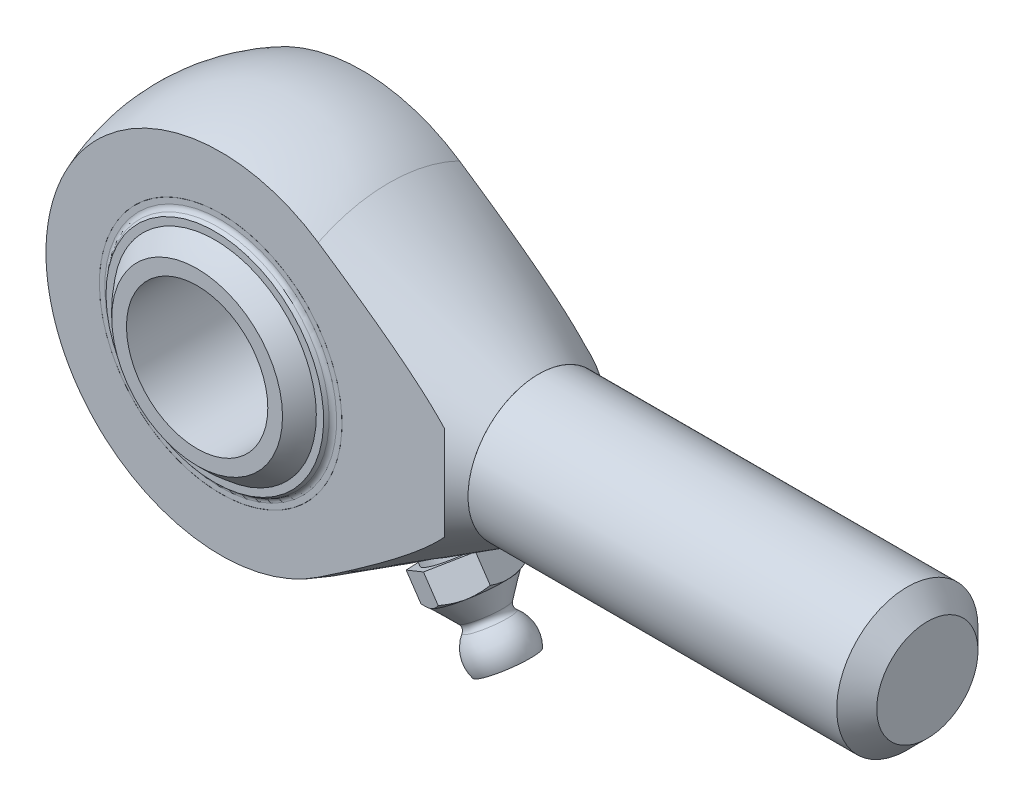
ISO-10303-21;
HEADER;
FILE_DESCRIPTION(('STEP AP214'),'2;1');
FILE_NAME('part.step','',(''),(''),'','','');
FILE_SCHEMA(('AUTOMOTIVE_DESIGN { 1 0 10303 214 1 1 1 1 }'));
ENDSEC;
DATA;
#1=APPLICATION_CONTEXT('core data for automotive mechanical design processes');
#2=APPLICATION_PROTOCOL_DEFINITION('international standard','automotive_design',2000,#1);
#3=PRODUCT_CONTEXT('',#1,'mechanical');
#4=PRODUCT('Part','Part','',(#3));
#5=PRODUCT_RELATED_PRODUCT_CATEGORY('part','',(#4));
#6=PRODUCT_DEFINITION_FORMATION('','',#4);
#7=PRODUCT_DEFINITION_CONTEXT('part definition',#1,'design');
#8=PRODUCT_DEFINITION('design','',#6,#7);
#9=PRODUCT_DEFINITION_SHAPE('','',#8);
#10=(LENGTH_UNIT() NAMED_UNIT(*) SI_UNIT(.MILLI.,.METRE.));
#11=(NAMED_UNIT(*) PLANE_ANGLE_UNIT() SI_UNIT($,.RADIAN.));
#12=(NAMED_UNIT(*) SI_UNIT($,.STERADIAN.) SOLID_ANGLE_UNIT());
#13=UNCERTAINTY_MEASURE_WITH_UNIT(LENGTH_MEASURE(1.E-05),#10,'distance_accuracy_value','');
#14=(GEOMETRIC_REPRESENTATION_CONTEXT(3) GLOBAL_UNCERTAINTY_ASSIGNED_CONTEXT((#13)) GLOBAL_UNIT_ASSIGNED_CONTEXT((#10,
#11,#12)) REPRESENTATION_CONTEXT('',''));
#15=CARTESIAN_POINT('',(0.,0.,0.));
#16=DIRECTION('',(0.,0.,1.));
#17=DIRECTION('',(1.,0.,0.));
#18=AXIS2_PLACEMENT_3D('',#15,#16,#17);
#19=CARTESIAN_POINT('',(-3.53751230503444,-10.8873433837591,1.50710911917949));
#20=DIRECTION('',(0.306373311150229,0.942920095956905,-0.130526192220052));
#21=DIRECTION('',(-0.0403348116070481,-0.124137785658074,-0.99144486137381));
#22=AXIS2_PLACEMENT_3D('',#19,#20,#21);
#23=SPHERICAL_SURFACE('',#22,1.5);
#24=CARTESIAN_POINT('',(-3.0779523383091,-9.47296323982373,1.31131983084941));
#25=VERTEX_POINT('',#24);
#26=VERTEX_LOOP('',#25);
#27=FACE_BOUND('',#26,.T.);
#28=ADVANCED_FACE('P0_F12',(#27),#23,.T.);
#29=CLOSED_SHELL('',(#28));
#30=MANIFOLD_SOLID_BREP('P0_B1',#29);
#31=CARTESIAN_POINT('',(0.,11.4476302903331,1.50710911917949));
#32=DIRECTION('',(0.,-0.99144486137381,-0.130526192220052));
#33=DIRECTION('',(0.,0.130526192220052,-0.99144486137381));
#34=AXIS2_PLACEMENT_3D('',#31,#32,#33);
#35=SPHERICAL_SURFACE('',#34,1.5);
#36=CARTESIAN_POINT('',(0.,9.96046299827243,1.31131983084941));
#37=VERTEX_POINT('',#36);
#38=VERTEX_LOOP('',#37);
#39=FACE_BOUND('',#38,.T.);
#40=ADVANCED_FACE('P1_F12',(#39),#35,.T.);
#41=CLOSED_SHELL('',(#40));
#42=MANIFOLD_SOLID_BREP('P1_B1',#41);
#43=CARTESIAN_POINT('',(3.53751230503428,-10.8873433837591,-1.50710911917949));
#44=DIRECTION('',(-0.306373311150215,0.94292009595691,0.130526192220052));
#45=DIRECTION('',(0.0403348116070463,-0.124137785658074,0.99144486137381));
#46=AXIS2_PLACEMENT_3D('',#43,#44,#45);
#47=SPHERICAL_SURFACE('',#46,1.5);
#48=CARTESIAN_POINT('',(3.07795233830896,-9.47296323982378,-1.31131983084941));
#49=VERTEX_POINT('',#48);
#50=VERTEX_LOOP('',#49);
#51=FACE_BOUND('',#50,.T.);
#52=ADVANCED_FACE('P2_F12',(#51),#47,.T.);
#53=CLOSED_SHELL('',(#52));
#54=MANIFOLD_SOLID_BREP('P2_B1',#53);
#55=CARTESIAN_POINT('',(0.,0.,0.));
#56=DIRECTION('',(0.,0.,1.));
#57=DIRECTION('',(0.999027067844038,0.044101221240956,0.));
#58=AXIS2_PLACEMENT_3D('',#55,#56,#57);
#59=CYLINDRICAL_SURFACE('',#58,10.3);
#60=CARTESIAN_POINT('',(0.,0.,-6.));
#61=DIRECTION('',(0.,0.,1.));
#62=DIRECTION('',(0.999027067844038,0.044101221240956,0.));
#63=AXIS2_PLACEMENT_3D('',#60,#61,#62);
#64=CIRCLE('',#63,10.3);
#65=CARTESIAN_POINT('',(10.2899787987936,0.454242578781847,-6.));
#66=VERTEX_POINT('',#65);
#67=EDGE_CURVE('P3_E34',#66,#66,#64,.T.);
#68=ORIENTED_EDGE('',*,*,#67,.T.);
#69=EDGE_LOOP('',(#68));
#70=FACE_BOUND('',#69,.T.);
#71=CARTESIAN_POINT('',(0.,0.,-5.5));
#72=DIRECTION('',(0.,0.,1.));
#73=DIRECTION('',(0.999027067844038,0.044101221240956,0.));
#74=AXIS2_PLACEMENT_3D('',#71,#72,#73);
#75=CIRCLE('',#74,10.3);
#76=CARTESIAN_POINT('',(10.2899787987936,0.454242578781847,-5.5));
#77=VERTEX_POINT('',#76);
#78=EDGE_CURVE('P3_E43',#77,#77,#75,.T.);
#79=ORIENTED_EDGE('',*,*,#78,.F.);
#80=EDGE_LOOP('',(#79));
#81=FACE_BOUND('',#80,.T.);
#82=ADVANCED_FACE('P3_F14',(#70,#81),#59,.T.);
#83=CARTESIAN_POINT('',(-0.454242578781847,10.2899787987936,-6.));
#84=DIRECTION('',(0.,0.,-1.));
#85=DIRECTION('',(-0.999027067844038,-0.044101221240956,0.));
#86=AXIS2_PLACEMENT_3D('',#83,#84,#85);
#87=PLANE('',#86);
#88=CARTESIAN_POINT('',(0.,0.,-6.));
#89=DIRECTION('',(0.,0.,-1.));
#90=DIRECTION('',(-0.999027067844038,-0.044101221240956,0.));
#91=AXIS2_PLACEMENT_3D('',#88,#89,#90);
#92=CIRCLE('',#91,9.84405012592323);
#93=CARTESIAN_POINT('',(-9.83447253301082,-0.434134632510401,-6.));
#94=VERTEX_POINT('',#93);
#95=EDGE_CURVE('P3_E21',#94,#94,#92,.F.);
#96=ORIENTED_EDGE('',*,*,#95,.T.);
#97=EDGE_LOOP('',(#96));
#98=FACE_BOUND('',#97,.T.);
#99=ORIENTED_EDGE('',*,*,#67,.F.);
#100=EDGE_LOOP('',(#99));
#101=FACE_BOUND('',#100,.T.);
#102=ADVANCED_FACE('P3_F50',(#98,#101),#87,.T.);
#103=CARTESIAN_POINT('',(0.,0.,0.));
#104=DIRECTION('',(0.,0.,1.));
#105=DIRECTION('',(-0.044101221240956,0.999027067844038,0.));
#106=AXIS2_PLACEMENT_3D('',#103,#104,#105);
#107=SPHERICAL_SURFACE('',#106,11.2964114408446);
#108=CARTESIAN_POINT('',(0.,0.,-6.22449248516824));
#109=DIRECTION('',(0.,0.,1.));
#110=DIRECTION('',(0.999027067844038,0.044101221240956,0.));
#111=AXIS2_PLACEMENT_3D('',#108,#109,#110);
#112=CIRCLE('',#111,9.42680246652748);
#113=CARTESIAN_POINT('',(-0.415733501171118,9.4176308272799,-6.22449248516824));
#114=VERTEX_POINT('',#113);
#115=EDGE_CURVE('P3_E10',#114,#114,#112,.F.);
#116=CARTESIAN_POINT('',(0.,0.,-6.5));
#117=DIRECTION('',(0.,0.,1.));
#118=DIRECTION('',(0.999027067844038,0.044101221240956,0.));
#119=AXIS2_PLACEMENT_3D('',#116,#117,#118);
#120=CIRCLE('',#119,9.23898865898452);
#121=CARTESIAN_POINT('',(-0.40745068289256,9.22999974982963,-6.5));
#122=VERTEX_POINT('',#121);
#123=EDGE_CURVE('P3_E37',#122,#122,#120,.T.);
#124=CARTESIAN_POINT('',(-0.415733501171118,9.4176308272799,-6.22449248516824));
#125=CARTESIAN_POINT('',(-0.41564909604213,9.41571879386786,-6.22739102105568));
#126=CARTESIAN_POINT('',(-0.41556463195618,9.41380542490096,-6.23028867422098));
#127=CARTESIAN_POINT('',(-0.415395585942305,9.4099760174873,-6.23608221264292));
#128=CARTESIAN_POINT('',(-0.415311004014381,9.40805997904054,-6.23897809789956));
#129=CARTESIAN_POINT('',(-0.415141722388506,9.40422523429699,-6.24476809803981));
#130=CARTESIAN_POINT('',(-0.415057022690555,9.4023065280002,-6.24766221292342));
#131=CARTESIAN_POINT('',(-0.414887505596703,9.39846644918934,-6.25344866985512));
#132=CARTESIAN_POINT('',(-0.414802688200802,9.39654507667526,-6.25634101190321));
#133=CARTESIAN_POINT('',(-0.414632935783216,9.39269966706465,-6.26212392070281));
#134=CARTESIAN_POINT('',(-0.414548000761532,9.39077562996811,-6.26501448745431));
#135=CARTESIAN_POINT('',(-0.414378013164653,9.38692489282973,-6.27079384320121));
#136=CARTESIAN_POINT('',(-0.414292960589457,9.38499819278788,-6.27368263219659));
#137=CARTESIAN_POINT('',(-0.414122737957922,9.38114213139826,-6.27945842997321));
#138=CARTESIAN_POINT('',(-0.414037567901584,9.3792127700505,-6.28234543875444));
#139=CARTESIAN_POINT('',(-0.413867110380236,9.37535138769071,-6.28811767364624));
#140=CARTESIAN_POINT('',(-0.413781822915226,9.3734193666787,-6.29100289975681));
#141=CARTESIAN_POINT('',(-0.413611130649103,9.36955266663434,-6.29677156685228));
#142=CARTESIAN_POINT('',(-0.41352572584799,9.367617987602,-6.29965500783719));
#143=CARTESIAN_POINT('',(-0.413354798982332,9.36374597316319,-6.30542010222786));
#144=CARTESIAN_POINT('',(-0.413269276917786,9.36180863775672,-6.30830175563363));
#145=CARTESIAN_POINT('',(-0.413098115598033,9.3579313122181,-6.31406327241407));
#146=CARTESIAN_POINT('',(-0.413012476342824,9.35599132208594,-6.31694313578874));
#147=CARTESIAN_POINT('',(-0.412841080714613,9.35210868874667,-6.32270107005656));
#148=CARTESIAN_POINT('',(-0.41275532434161,9.35016604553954,-6.3255791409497));
#149=CARTESIAN_POINT('',(-0.41258369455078,9.34627810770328,-6.33133348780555));
#150=CARTESIAN_POINT('',(-0.412497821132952,9.34433281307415,-6.33420976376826));
#151=CARTESIAN_POINT('',(-0.41232595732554,9.3404395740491,-6.33996051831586));
#152=CARTESIAN_POINT('',(-0.412239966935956,9.33849162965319,-6.34283499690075));
#153=CARTESIAN_POINT('',(-0.412067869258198,9.33459309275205,-6.34858215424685));
#154=CARTESIAN_POINT('',(-0.411981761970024,9.33264250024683,-6.35145483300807));
#155=CARTESIAN_POINT('',(-0.411809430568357,9.32873866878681,-6.35719838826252));
#156=CARTESIAN_POINT('',(-0.411723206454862,9.32678542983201,-6.36006926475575));
#157=CARTESIAN_POINT('',(-0.411550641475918,9.32287630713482,-6.36580921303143));
#158=CARTESIAN_POINT('',(-0.411464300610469,9.32092042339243,-6.36867828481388));
#159=CARTESIAN_POINT('',(-0.411291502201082,9.31700601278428,-6.37441462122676));
#160=CARTESIAN_POINT('',(-0.411205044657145,9.31504748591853,-6.37728188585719));
#161=CARTESIAN_POINT('',(-0.411032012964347,9.31112779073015,-6.3830146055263));
#162=CARTESIAN_POINT('',(-0.410945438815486,9.30916662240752,-6.38588006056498));
#163=CARTESIAN_POINT('',(-0.410772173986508,9.30524164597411,-6.39160915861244));
#164=CARTESIAN_POINT('',(-0.410685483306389,9.30327783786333,-6.39447280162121));
#165=CARTESIAN_POINT('',(-0.410511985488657,9.29934758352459,-6.4001982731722));
#166=CARTESIAN_POINT('',(-0.410425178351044,9.29738113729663,-6.40306010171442));
#167=CARTESIAN_POINT('',(-0.410251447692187,9.29344560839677,-6.40878194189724));
#168=CARTESIAN_POINT('',(-0.410164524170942,9.29147652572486,-6.41164195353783));
#169=CARTESIAN_POINT('',(-0.409990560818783,9.28753572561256,-6.41736015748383));
#170=CARTESIAN_POINT('',(-0.409903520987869,9.28556400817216,-6.42021834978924));
#171=CARTESIAN_POINT('',(-0.409729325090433,9.28161794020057,-6.4259329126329));
#172=CARTESIAN_POINT('',(-0.40964216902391,9.27964358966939,-6.42878928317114));
#173=CARTESIAN_POINT('',(-0.409467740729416,9.27569225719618,-6.43450020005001));
#174=CARTESIAN_POINT('',(-0.409380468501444,9.27371527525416,-6.43735474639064));
#175=CARTESIAN_POINT('',(-0.409205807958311,9.26975868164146,-6.4430620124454));
#176=CARTESIAN_POINT('',(-0.40911841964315,9.26777906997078,-6.44591473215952));
#177=CARTESIAN_POINT('',(-0.408943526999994,9.26381721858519,-6.45161834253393));
#178=CARTESIAN_POINT('',(-0.408856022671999,9.26183497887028,-6.45446923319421));
#179=CARTESIAN_POINT('',(-0.408680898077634,9.25786787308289,-6.46016918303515));
#180=CARTESIAN_POINT('',(-0.408593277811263,9.25588300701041,-6.46301824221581));
#181=CARTESIAN_POINT('',(-0.4084179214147,9.25191065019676,-6.46871452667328));
#182=CARTESIAN_POINT('',(-0.408330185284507,9.24992315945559,-6.47156175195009));
#183=CARTESIAN_POINT('',(-0.408154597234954,9.24594555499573,-6.47725436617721));
#184=CARTESIAN_POINT('',(-0.408066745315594,9.24395544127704,-6.48009975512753));
#185=CARTESIAN_POINT('',(-0.407890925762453,9.23997259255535,-6.48578869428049));
#186=CARTESIAN_POINT('',(-0.407802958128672,9.23797985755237,-6.48863224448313));
#187=CARTESIAN_POINT('',(-0.40762690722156,9.23399176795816,-6.49431750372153));
#188=CARTESIAN_POINT('',(-0.407538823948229,9.23199641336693,-6.49715921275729));
#189=CARTESIAN_POINT('',(-0.40745068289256,9.22999974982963,-6.5));
#190=B_SPLINE_CURVE_WITH_KNOTS('',3,(#124,#125,#126,#127,#128,#129,#130,#131,#132,#133,#134,
#135,#136,#137,#138,#139,#140,#141,#142,#143,#144,#145,#146,#147,#148,#149,#150,#151,#152,#153,
#154,#155,#156,#157,#158,#159,#160,#161,#162,#163,#164,#165,#166,#167,#168,#169,#170,#171,#172,
#173,#174,#175,#176,#177,#178,#179,#180,#181,#182,#183,#184,#185,#186,#187,#188,#189),
.UNSPECIFIED.,.F.,.F.,(4,2,2,2,2,2,2,2,2,2,2,2,2,2,2,2,2,2,2,2,2,2,2,2,2,2,2,2,2,2,2,2,4),(0.,
0.0104201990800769,0.0208403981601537,0.0312605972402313,0.0416807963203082,0.0521009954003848,
0.0625211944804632,0.0729413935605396,0.0833615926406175,0.0937817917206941,0.104201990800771,
0.114622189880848,0.125042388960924,0.135462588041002,0.145882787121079,0.156302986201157,
0.166723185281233,0.17714338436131,0.187563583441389,0.197983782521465,0.208403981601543,
0.218824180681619,0.229244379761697,0.239664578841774,0.250084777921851,0.260504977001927,
0.270925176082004,0.281345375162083,0.291765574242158,0.302185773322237,0.312605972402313,
0.323026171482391,0.333446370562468),.UNSPECIFIED.);
#191=EDGE_CURVE('P3_BSEAM57',#114,#122,#190,.T.);
#192=ORIENTED_EDGE('',*,*,#115,.T.);
#193=ORIENTED_EDGE('',*,*,#123,.T.);
#194=ORIENTED_EDGE('',*,*,#191,.T.);
#195=ORIENTED_EDGE('',*,*,#191,.F.);
#196=EDGE_LOOP('',(#192,#194,#193,#195));
#197=FACE_BOUND('',#196,.T.);
#198=ADVANCED_FACE('P3_F57',(#197),#107,.T.);
#199=CARTESIAN_POINT('',(-0.380173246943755,8.6120826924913,-6.5));
#200=DIRECTION('',(0.,0.,-1.));
#201=DIRECTION('',(-0.999027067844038,-0.044101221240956,0.));
#202=AXIS2_PLACEMENT_3D('',#199,#200,#201);
#203=PLANE('',#202);
#204=CARTESIAN_POINT('',(0.,0.,-6.5));
#205=DIRECTION('',(0.,0.,1.));
#206=DIRECTION('',(0.999027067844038,0.044101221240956,0.));
#207=AXIS2_PLACEMENT_3D('',#204,#205,#206);
#208=CIRCLE('',#207,8.62046982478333);
#209=CARTESIAN_POINT('',(-0.380173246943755,8.6120826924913,-6.50000000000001));
#210=VERTEX_POINT('',#209);
#211=EDGE_CURVE('P3_E40',#210,#210,#208,.T.);
#212=ORIENTED_EDGE('',*,*,#211,.T.);
#213=EDGE_LOOP('',(#212));
#214=FACE_BOUND('',#213,.T.);
#215=ORIENTED_EDGE('',*,*,#123,.F.);
#216=EDGE_LOOP('',(#215));
#217=FACE_BOUND('',#216,.T.);
#218=ADVANCED_FACE('P3_F77',(#214,#217),#203,.T.);
#219=CARTESIAN_POINT('',(0.,0.,0.));
#220=DIRECTION('',(0.,0.,1.));
#221=DIRECTION('',(-0.044101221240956,0.999027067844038,0.));
#222=AXIS2_PLACEMENT_3D('',#219,#220,#221);
#223=SPHERICAL_SURFACE('',#222,10.7964114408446);
#224=CARTESIAN_POINT('',(0.,0.,-5.73442893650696));
#225=DIRECTION('',(0.,0.,1.));
#226=DIRECTION('',(0.999027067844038,0.044101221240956,0.));
#227=AXIS2_PLACEMENT_3D('',#224,#225,#226);
#228=CIRCLE('',#227,9.14761306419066);
#229=CARTESIAN_POINT('',(-0.403420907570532,9.13871305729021,-5.73442893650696));
#230=VERTEX_POINT('',#229);
#231=EDGE_CURVE('P3_E29',#230,#230,#228,.T.);
#232=CARTESIAN_POINT('',(-0.403420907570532,9.13871305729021,-5.73442893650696));
#233=CARTESIAN_POINT('',(-0.403194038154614,9.13357377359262,-5.74263515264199));
#234=CARTESIAN_POINT('',(-0.402966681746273,9.12842345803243,-5.75083444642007));
#235=CARTESIAN_POINT('',(-0.402510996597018,9.11810080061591,-5.76721912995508));
#236=CARTESIAN_POINT('',(-0.402282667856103,9.11292845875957,-5.77540451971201));
#237=CARTESIAN_POINT('',(-0.401825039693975,9.10256178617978,-5.79176133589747));
#238=CARTESIAN_POINT('',(-0.401595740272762,9.09736745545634,-5.799932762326));
#239=CARTESIAN_POINT('',(-0.401136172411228,9.08695684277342,-5.81626159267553));
#240=CARTESIAN_POINT('',(-0.400905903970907,9.08174056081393,-5.82441899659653));
#241=CARTESIAN_POINT('',(-0.400444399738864,9.07128608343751,-5.84071972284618));
#242=CARTESIAN_POINT('',(-0.400213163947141,9.06604788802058,-5.84886304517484));
#243=CARTESIAN_POINT('',(-0.399749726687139,9.05554962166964,-5.86513554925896));
#244=CARTESIAN_POINT('',(-0.399517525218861,9.05028955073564,-5.87326473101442));
#245=CARTESIAN_POINT('',(-0.399052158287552,9.03974757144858,-5.88950889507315));
#246=CARTESIAN_POINT('',(-0.398818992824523,9.03446566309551,-5.89762387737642));
#247=CARTESIAN_POINT('',(-0.398351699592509,9.02388004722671,-5.91383958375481));
#248=CARTESIAN_POINT('',(-0.398117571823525,9.01857633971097,-5.92194030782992));
#249=CARTESIAN_POINT('',(-0.397648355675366,9.00794716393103,-5.93812743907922));
#250=CARTESIAN_POINT('',(-0.397413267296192,9.00262169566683,-5.94621384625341));
#251=CARTESIAN_POINT('',(-0.396942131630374,8.99194903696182,-5.96237228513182));
#252=CARTESIAN_POINT('',(-0.39670608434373,8.986601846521,-5.97044431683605));
#253=CARTESIAN_POINT('',(-0.396233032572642,8.97588578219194,-5.98657394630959));
#254=CARTESIAN_POINT('',(-0.395996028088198,8.97051690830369,-5.99463154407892));
#255=CARTESIAN_POINT('',(-0.395521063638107,8.95975751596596,-6.01073224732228));
#256=CARTESIAN_POINT('',(-0.395283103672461,8.95436699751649,-6.01877535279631));
#257=CARTESIAN_POINT('',(-0.394806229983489,8.94356435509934,-6.03484701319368));
#258=CARTESIAN_POINT('',(-0.394567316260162,8.93815223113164,-6.04287556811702));
#259=CARTESIAN_POINT('',(-0.394088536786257,8.92730641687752,-6.05891806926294));
#260=CARTESIAN_POINT('',(-0.393848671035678,8.92187272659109,-6.06693201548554));
#261=CARTESIAN_POINT('',(-0.393367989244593,8.91098381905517,-6.08294524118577));
#262=CARTESIAN_POINT('',(-0.393127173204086,8.90552860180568,-6.0909445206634));
#263=CARTESIAN_POINT('',(-0.392644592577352,8.89459667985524,-6.10692835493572));
#264=CARTESIAN_POINT('',(-0.392402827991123,8.88911997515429,-6.1149129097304));
#265=CARTESIAN_POINT('',(-0.391918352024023,8.87814511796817,-6.13086723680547));
#266=CARTESIAN_POINT('',(-0.391675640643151,8.87264696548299,-6.13883700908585));
#267=CARTESIAN_POINT('',(-0.391189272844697,8.861629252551,-6.15476171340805));
#268=CARTESIAN_POINT('',(-0.390945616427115,8.85610969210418,-6.16271664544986));
#269=CARTESIAN_POINT('',(-0.390457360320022,8.84504920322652,-6.17861161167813));
#270=CARTESIAN_POINT('',(-0.39021276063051,8.83950827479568,-6.18655164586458));
#271=CARTESIAN_POINT('',(-0.389722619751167,8.82840509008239,-6.20241675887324));
#272=CARTESIAN_POINT('',(-0.389477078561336,8.82284283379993,-6.21034183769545));
#273=CARTESIAN_POINT('',(-0.388985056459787,8.81169703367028,-6.22617698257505));
#274=CARTESIAN_POINT('',(-0.388738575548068,8.80611348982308,-6.23408704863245));
#275=CARTESIAN_POINT('',(-0.388244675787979,8.79492515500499,-6.2498921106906));
#276=CARTESIAN_POINT('',(-0.38799725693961,8.78932036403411,-6.25778710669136));
#277=CARTESIAN_POINT('',(-0.387501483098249,8.7780895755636,-6.27356197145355));
#278=CARTESIAN_POINT('',(-0.387253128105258,8.77246357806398,-6.28144184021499));
#279=CARTESIAN_POINT('',(-0.386755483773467,8.76119041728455,-6.29718639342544));
#280=CARTESIAN_POINT('',(-0.386506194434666,8.75554325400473,-6.30505107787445));
#281=CARTESIAN_POINT('',(-0.386006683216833,8.74422780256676,-6.32076520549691));
#282=CARTESIAN_POINT('',(-0.3857564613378,8.7385595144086,-6.32861464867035));
#283=CARTESIAN_POINT('',(-0.385255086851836,8.7272018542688,-6.34429823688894));
#284=CARTESIAN_POINT('',(-0.385003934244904,8.72151248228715,-6.35213238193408));
#285=CARTESIAN_POINT('',(-0.384500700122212,8.7101126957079,-6.36778531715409));
#286=CARTESIAN_POINT('',(-0.384248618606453,8.70440228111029,-6.37560410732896));
#287=CARTESIAN_POINT('',(-0.383743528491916,8.69296045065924,-6.39122627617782));
#288=CARTESIAN_POINT('',(-0.383490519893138,8.6872290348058,-6.39902965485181));
#289=CARTESIAN_POINT('',(-0.382983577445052,8.67574524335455,-6.41462094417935));
#290=CARTESIAN_POINT('',(-0.382729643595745,8.66999286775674,-6.4224088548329));
#291=CARTESIAN_POINT('',(-0.382220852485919,8.65846719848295,-6.43796915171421));
#292=CARTESIAN_POINT('',(-0.381965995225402,8.65269390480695,-6.44574153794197));
#293=CARTESIAN_POINT('',(-0.381455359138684,8.64112644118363,-6.46127072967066));
#294=CARTESIAN_POINT('',(-0.381199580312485,8.63533227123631,-6.46902753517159));
#295=CARTESIAN_POINT('',(-0.380687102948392,8.62372309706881,-6.48452550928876));
#296=CARTESIAN_POINT('',(-0.3804304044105,8.61790809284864,-6.49226667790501));
#297=CARTESIAN_POINT('',(-0.380173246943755,8.6120826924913,-6.50000000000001));
#298=B_SPLINE_CURVE_WITH_KNOTS('',3,(#232,#233,#234,#235,#236,#237,#238,#239,#240,#241,#242,
#243,#244,#245,#246,#247,#248,#249,#250,#251,#252,#253,#254,#255,#256,#257,#258,#259,#260,#261,
#262,#263,#264,#265,#266,#267,#268,#269,#270,#271,#272,#273,#274,#275,#276,#277,#278,#279,#280,
#281,#282,#283,#284,#285,#286,#287,#288,#289,#290,#291,#292,#293,#294,#295,#296,#297),
.UNSPECIFIED.,.F.,.F.,(4,2,2,2,2,2,2,2,2,2,2,2,2,2,2,2,2,2,2,2,2,2,2,2,2,2,2,2,2,2,2,2,4),(0.,
0.0290559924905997,0.0581119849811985,0.087167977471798,0.116223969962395,0.145279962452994,
0.174335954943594,0.203391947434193,0.23244793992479,0.26150393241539,0.290559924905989,
0.319615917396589,0.348671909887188,0.377727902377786,0.406783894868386,0.435839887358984,
0.464895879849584,0.493951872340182,0.523007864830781,0.55206385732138,0.581119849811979,
0.610175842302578,0.639231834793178,0.668287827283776,0.697343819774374,0.726399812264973,
0.755455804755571,0.784511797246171,0.813567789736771,0.842623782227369,0.871679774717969,
0.900735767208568,0.929791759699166),.UNSPECIFIED.);
#299=EDGE_CURVE('P3_BSEAM68',#230,#210,#298,.T.);
#300=ORIENTED_EDGE('',*,*,#231,.T.);
#301=ORIENTED_EDGE('',*,*,#211,.F.);
#302=ORIENTED_EDGE('',*,*,#299,.T.);
#303=ORIENTED_EDGE('',*,*,#299,.F.);
#304=EDGE_LOOP('',(#300,#302,#301,#303));
#305=FACE_BOUND('',#304,.T.);
#306=ADVANCED_FACE('P3_F68',(#305),#223,.F.);
#307=CARTESIAN_POINT('',(-0.454242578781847,10.2899787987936,-5.5));
#308=DIRECTION('',(0.,0.,1.));
#309=DIRECTION('',(0.999027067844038,0.044101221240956,0.));
#310=AXIS2_PLACEMENT_3D('',#307,#308,#309);
#311=PLANE('',#310);
#312=CARTESIAN_POINT('',(0.,0.,-5.5));
#313=DIRECTION('',(0.,0.,1.));
#314=DIRECTION('',(0.999027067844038,0.044101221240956,0.));
#315=AXIS2_PLACEMENT_3D('',#312,#313,#314);
#316=CIRCLE('',#315,9.57125443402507);
#317=CARTESIAN_POINT('',(9.56194225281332,0.422104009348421,-5.5));
#318=VERTEX_POINT('',#317);
#319=EDGE_CURVE('P3_E25',#318,#318,#316,.F.);
#320=ORIENTED_EDGE('',*,*,#319,.T.);
#321=EDGE_LOOP('',(#320));
#322=FACE_BOUND('',#321,.T.);
#323=ORIENTED_EDGE('',*,*,#78,.T.);
#324=EDGE_LOOP('',(#323));
#325=FACE_BOUND('',#324,.T.);
#326=ADVANCED_FACE('P3_F47',(#322,#325),#311,.T.);
#327=CARTESIAN_POINT('',(0.,0.,-6.));
#328=DIRECTION('',(0.,0.,1.));
#329=DIRECTION('',(0.999027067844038,0.044101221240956,0.));
#330=AXIS2_PLACEMENT_3D('',#327,#328,#329);
#331=TOROIDAL_SURFACE('',#330,9.57125443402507,0.5);
#332=ORIENTED_EDGE('',*,*,#319,.F.);
#333=EDGE_LOOP('',(#332));
#334=FACE_BOUND('',#333,.T.);
#335=ORIENTED_EDGE('',*,*,#231,.F.);
#336=EDGE_LOOP('',(#335));
#337=FACE_BOUND('',#336,.T.);
#338=ADVANCED_FACE('P3_F60',(#334,#337),#331,.T.);
#339=CARTESIAN_POINT('',(0.,0.,-6.5));
#340=DIRECTION('',(0.,0.,-1.));
#341=DIRECTION('',(-0.999027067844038,-0.044101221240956,0.));
#342=AXIS2_PLACEMENT_3D('',#339,#340,#341);
#343=TOROIDAL_SURFACE('',#342,9.84405012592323,0.5);
#344=ORIENTED_EDGE('',*,*,#115,.F.);
#345=EDGE_LOOP('',(#344));
#346=FACE_BOUND('',#345,.T.);
#347=ORIENTED_EDGE('',*,*,#95,.F.);
#348=EDGE_LOOP('',(#347));
#349=FACE_BOUND('',#348,.T.);
#350=ADVANCED_FACE('P3_F16',(#346,#349),#343,.F.);
#351=CLOSED_SHELL('',(#82,#102,#198,#218,#306,#326,#338,#350));
#352=MANIFOLD_SOLID_BREP('P3_B1',#351);
#353=CARTESIAN_POINT('',(-6.72874825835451,-9.26132745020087,1.50710911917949));
#354=DIRECTION('',(0.582756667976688,0.802095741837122,-0.130526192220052));
#355=DIRECTION('',(-0.07672137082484,-0.105597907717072,-0.99144486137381));
#356=AXIS2_PLACEMENT_3D('',#353,#354,#355);
#357=SPHERICAL_SURFACE('',#356,1.5);
#358=CARTESIAN_POINT('',(-5.85461325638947,-8.05818383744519,1.31131983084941));
#359=VERTEX_POINT('',#358);
#360=VERTEX_LOOP('',#359);
#361=FACE_BOUND('',#360,.T.);
#362=ADVANCED_FACE('P4_F12',(#361),#357,.T.);
#363=CLOSED_SHELL('',(#362));
#364=MANIFOLD_SOLID_BREP('P4_B1',#363);
#365=CARTESIAN_POINT('',(3.53751230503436,10.8873433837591,1.50710911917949));
#366=DIRECTION('',(-0.306373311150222,-0.942920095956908,-0.130526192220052));
#367=DIRECTION('',(0.0403348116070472,0.124137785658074,-0.99144486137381));
#368=AXIS2_PLACEMENT_3D('',#365,#366,#367);
#369=SPHERICAL_SURFACE('',#368,1.5);
#370=CARTESIAN_POINT('',(3.07795233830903,9.47296323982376,1.31131983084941));
#371=VERTEX_POINT('',#370);
#372=VERTEX_LOOP('',#371);
#373=FACE_BOUND('',#372,.T.);
#374=ADVANCED_FACE('P5_F12',(#373),#369,.T.);
#375=CLOSED_SHELL('',(#374));
#376=MANIFOLD_SOLID_BREP('P5_B1',#375);
#377=CARTESIAN_POINT('',(0.,-11.4476302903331,-1.50710911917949));
#378=DIRECTION('',(0.,0.99144486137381,0.130526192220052));
#379=DIRECTION('',(0.,-0.130526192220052,0.99144486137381));
#380=AXIS2_PLACEMENT_3D('',#377,#378,#379);
#381=SPHERICAL_SURFACE('',#380,1.5);
#382=CARTESIAN_POINT('',(0.,-9.96046299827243,-1.31131983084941));
#383=VERTEX_POINT('',#382);
#384=VERTEX_LOOP('',#383);
#385=FACE_BOUND('',#384,.T.);
#386=ADVANCED_FACE('P6_F12',(#385),#381,.T.);
#387=CLOSED_SHELL('',(#386));
#388=MANIFOLD_SOLID_BREP('P6_B1',#387);
#389=CARTESIAN_POINT('',(-9.26132745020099,-6.72874825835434,1.50710911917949));
#390=DIRECTION('',(0.802095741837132,0.582756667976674,-0.130526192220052));
#391=DIRECTION('',(-0.105597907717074,-0.0767213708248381,-0.99144486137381));
#392=AXIS2_PLACEMENT_3D('',#389,#390,#391);
#393=SPHERICAL_SURFACE('',#392,1.5);
#394=CARTESIAN_POINT('',(-8.05818383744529,-5.85461325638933,1.31131983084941));
#395=VERTEX_POINT('',#394);
#396=VERTEX_LOOP('',#395);
#397=FACE_BOUND('',#396,.T.);
#398=ADVANCED_FACE('P7_F12',(#397),#393,.T.);
#399=CLOSED_SHELL('',(#398));
#400=MANIFOLD_SOLID_BREP('P7_B1',#399);
#401=CARTESIAN_POINT('',(6.72874825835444,9.26132745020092,1.50710911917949));
#402=DIRECTION('',(-0.582756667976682,-0.802095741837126,-0.130526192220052));
#403=DIRECTION('',(0.0767213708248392,0.105597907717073,-0.99144486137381));
#404=AXIS2_PLACEMENT_3D('',#401,#402,#403);
#405=SPHERICAL_SURFACE('',#404,1.5);
#406=CARTESIAN_POINT('',(5.85461325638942,8.05818383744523,1.31131983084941));
#407=VERTEX_POINT('',#406);
#408=VERTEX_LOOP('',#407);
#409=FACE_BOUND('',#408,.T.);
#410=ADVANCED_FACE('P8_F12',(#409),#405,.T.);
#411=CLOSED_SHELL('',(#410));
#412=MANIFOLD_SOLID_BREP('P8_B1',#411);
#413=CARTESIAN_POINT('',(-3.53751230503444,-10.8873433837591,-1.50710911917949));
#414=DIRECTION('',(0.306373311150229,0.942920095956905,0.130526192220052));
#415=DIRECTION('',(-0.0403348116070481,-0.124137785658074,0.99144486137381));
#416=AXIS2_PLACEMENT_3D('',#413,#414,#415);
#417=SPHERICAL_SURFACE('',#416,1.5);
#418=CARTESIAN_POINT('',(-3.0779523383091,-9.47296323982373,-1.31131983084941));
#419=VERTEX_POINT('',#418);
#420=VERTEX_LOOP('',#419);
#421=FACE_BOUND('',#420,.T.);
#422=ADVANCED_FACE('P9_F12',(#421),#417,.T.);
#423=CLOSED_SHELL('',(#422));
#424=MANIFOLD_SOLID_BREP('P9_B1',#423);
#425=CARTESIAN_POINT('',(0.,0.,0.));
#426=DIRECTION('',(0.,1.,0.));
#427=DIRECTION('',(1.,0.,0.));
#428=AXIS2_PLACEMENT_3D('',#425,#426,#427);
#429=SPHERICAL_SURFACE('',#428,10.7964114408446);
#430=CARTESIAN_POINT('',(0.,0.,0.));
#431=DIRECTION('',(0.,0.,1.));
#432=DIRECTION('',(1.,0.,0.));
#433=AXIS2_PLACEMENT_3D('',#430,#431,#432);
#434=SPHERICAL_SURFACE('',#433,10.7964114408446);
#435=CARTESIAN_POINT('',(0.,0.,2.64296087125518));
#436=DIRECTION('',(0.,0.,1.));
#437=DIRECTION('',(1.,0.,0.));
#438=AXIS2_PLACEMENT_3D('',#435,#436,#437);
#439=CIRCLE('',#438,10.4679156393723);
#440=CARTESIAN_POINT('',(10.4679156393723,0.,2.64296087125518));
#441=VERTEX_POINT('',#440);
#442=EDGE_CURVE('P10_E18',#441,#441,#439,.F.);
#443=ORIENTED_EDGE('',*,*,#442,.F.);
#444=EDGE_LOOP('',(#443));
#445=FACE_BOUND('',#444,.T.);
#446=CARTESIAN_POINT('',(0.,0.,8.));
#447=DIRECTION('',(0.,0.,-1.));
#448=DIRECTION('',(-1.,0.,0.));
#449=AXIS2_PLACEMENT_3D('',#446,#447,#448);
#450=CIRCLE('',#449,7.25);
#451=CARTESIAN_POINT('',(-7.25,0.,8.));
#452=VERTEX_POINT('',#451);
#453=EDGE_CURVE('P10_E27',#452,#452,#450,.F.);
#454=ORIENTED_EDGE('',*,*,#453,.F.);
#455=EDGE_LOOP('',(#454));
#456=FACE_BOUND('',#455,.T.);
#457=ADVANCED_FACE('P10_F14',(#445,#456),#434,.T.);
#458=CARTESIAN_POINT('',(0.,0.,0.));
#459=DIRECTION('',(0.,0.,-1.));
#460=DIRECTION('',(-1.,0.,0.));
#461=AXIS2_PLACEMENT_3D('',#458,#459,#460);
#462=SPHERICAL_SURFACE('',#461,10.7964114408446);
#463=CARTESIAN_POINT('',(0.,0.,-2.64296087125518));
#464=DIRECTION('',(0.,0.,-1.));
#465=DIRECTION('',(-1.,0.,0.));
#466=AXIS2_PLACEMENT_3D('',#463,#464,#465);
#467=CIRCLE('',#466,10.4679156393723);
#468=CARTESIAN_POINT('',(-10.4679156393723,0.,-2.64296087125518));
#469=VERTEX_POINT('',#468);
#470=EDGE_CURVE('P10_E34',#469,#469,#467,.F.);
#471=ORIENTED_EDGE('',*,*,#470,.F.);
#472=EDGE_LOOP('',(#471));
#473=FACE_BOUND('',#472,.T.);
#474=CARTESIAN_POINT('',(0.,0.,-8.));
#475=DIRECTION('',(0.,0.,1.));
#476=DIRECTION('',(1.,0.,0.));
#477=AXIS2_PLACEMENT_3D('',#474,#475,#476);
#478=CIRCLE('',#477,7.25);
#479=CARTESIAN_POINT('',(7.25,0.,-8.));
#480=VERTEX_POINT('',#479);
#481=EDGE_CURVE('P10_E10',#480,#480,#478,.F.);
#482=ORIENTED_EDGE('',*,*,#481,.F.);
#483=EDGE_LOOP('',(#482));
#484=FACE_BOUND('',#483,.T.);
#485=ADVANCED_FACE('P10_F50',(#473,#484),#462,.T.);
#486=CARTESIAN_POINT('',(0.,0.,0.));
#487=DIRECTION('',(0.,0.,-1.));
#488=DIRECTION('',(-1.,0.,0.));
#489=AXIS2_PLACEMENT_3D('',#486,#487,#488);
#490=SPHERICAL_SURFACE('',#489,10.7964114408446);
#491=CARTESIAN_POINT('',(0.,0.,0.156391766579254));
#492=DIRECTION('',(0.,0.,-1.));
#493=DIRECTION('',(-1.,0.,0.));
#494=AXIS2_PLACEMENT_3D('',#491,#492,#493);
#495=CIRCLE('',#494,10.7952786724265);
#496=CARTESIAN_POINT('',(-10.7952786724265,0.,0.156391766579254));
#497=VERTEX_POINT('',#496);
#498=EDGE_CURVE('P10_E39',#497,#497,#495,.F.);
#499=ORIENTED_EDGE('',*,*,#498,.F.);
#500=EDGE_LOOP('',(#499));
#501=FACE_BOUND('',#500,.T.);
#502=CARTESIAN_POINT('',(0.,0.,-0.156391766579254));
#503=DIRECTION('',(0.,0.,1.));
#504=DIRECTION('',(1.,0.,0.));
#505=AXIS2_PLACEMENT_3D('',#502,#503,#504);
#506=CIRCLE('',#505,10.7952786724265);
#507=CARTESIAN_POINT('',(10.7952786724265,0.,-0.156391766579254));
#508=VERTEX_POINT('',#507);
#509=EDGE_CURVE('P10_E35',#508,#508,#506,.F.);
#510=ORIENTED_EDGE('',*,*,#509,.F.);
#511=EDGE_LOOP('',(#510));
#512=FACE_BOUND('',#511,.T.);
#513=ADVANCED_FACE('P10_F16',(#501,#512),#490,.T.);
#514=CARTESIAN_POINT('',(0.,0.,-10.7964114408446));
#515=DIRECTION('',(0.,0.,1.));
#516=DIRECTION('',(1.,0.,0.));
#517=AXIS2_PLACEMENT_3D('',#514,#515,#516);
#518=CYLINDRICAL_SURFACE('',#517,6.);
#519=CARTESIAN_POINT('',(0.,0.,8.));
#520=DIRECTION('',(0.,0.,-1.));
#521=DIRECTION('',(-1.,0.,0.));
#522=AXIS2_PLACEMENT_3D('',#519,#520,#521);
#523=CIRCLE('',#522,6.);
#524=CARTESIAN_POINT('',(-6.,0.,8.));
#525=VERTEX_POINT('',#524);
#526=EDGE_CURVE('P10_E31',#525,#525,#523,.F.);
#527=ORIENTED_EDGE('',*,*,#526,.T.);
#528=EDGE_LOOP('',(#527));
#529=FACE_BOUND('',#528,.T.);
#530=CARTESIAN_POINT('',(0.,0.,-8.));
#531=DIRECTION('',(0.,0.,1.));
#532=DIRECTION('',(1.,0.,0.));
#533=AXIS2_PLACEMENT_3D('',#530,#531,#532);
#534=CIRCLE('',#533,6.);
#535=CARTESIAN_POINT('',(6.,0.,-8.));
#536=VERTEX_POINT('',#535);
#537=EDGE_CURVE('P10_E22',#536,#536,#534,.F.);
#538=ORIENTED_EDGE('',*,*,#537,.T.);
#539=EDGE_LOOP('',(#538));
#540=FACE_BOUND('',#539,.T.);
#541=ADVANCED_FACE('P10_F62',(#529,#540),#518,.F.);
#542=CARTESIAN_POINT('',(-10.7964114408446,-10.7964114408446,-8.));
#543=DIRECTION('',(0.,0.,1.));
#544=DIRECTION('',(1.,0.,0.));
#545=AXIS2_PLACEMENT_3D('',#542,#543,#544);
#546=PLANE('',#545);
#547=ORIENTED_EDGE('',*,*,#481,.T.);
#548=EDGE_LOOP('',(#547));
#549=FACE_BOUND('',#548,.T.);
#550=ORIENTED_EDGE('',*,*,#537,.F.);
#551=EDGE_LOOP('',(#550));
#552=FACE_BOUND('',#551,.T.);
#553=ADVANCED_FACE('P10_F58',(#549,#552),#546,.F.);
#554=CARTESIAN_POINT('',(-10.7964114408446,-10.7964114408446,8.));
#555=DIRECTION('',(0.,0.,-1.));
#556=DIRECTION('',(-1.,0.,0.));
#557=AXIS2_PLACEMENT_3D('',#554,#555,#556);
#558=PLANE('',#557);
#559=ORIENTED_EDGE('',*,*,#453,.T.);
#560=EDGE_LOOP('',(#559));
#561=FACE_BOUND('',#560,.T.);
#562=ORIENTED_EDGE('',*,*,#526,.F.);
#563=EDGE_LOOP('',(#562));
#564=FACE_BOUND('',#563,.T.);
#565=ADVANCED_FACE('P10_F54',(#561,#564),#558,.F.);
#566=CARTESIAN_POINT('',(0.,0.,-1.50710911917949));
#567=DIRECTION('',(0.,0.,-1.));
#568=DIRECTION('',(-1.,0.,0.));
#569=AXIS2_PLACEMENT_3D('',#566,#567,#568);
#570=TOROIDAL_SURFACE('',#569,11.4476302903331,1.5);
#571=ORIENTED_EDGE('',*,*,#470,.T.);
#572=EDGE_LOOP('',(#571));
#573=FACE_BOUND('',#572,.T.);
#574=ORIENTED_EDGE('',*,*,#509,.T.);
#575=EDGE_LOOP('',(#574));
#576=FACE_BOUND('',#575,.T.);
#577=ADVANCED_FACE('P10_F57',(#573,#576),#570,.F.);
#578=CARTESIAN_POINT('',(0.,0.,1.50710911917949));
#579=DIRECTION('',(0.,0.,-1.));
#580=DIRECTION('',(-1.,0.,0.));
#581=AXIS2_PLACEMENT_3D('',#578,#579,#580);
#582=TOROIDAL_SURFACE('',#581,11.4476302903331,1.5);
#583=ORIENTED_EDGE('',*,*,#442,.T.);
#584=EDGE_LOOP('',(#583));
#585=FACE_BOUND('',#584,.T.);
#586=ORIENTED_EDGE('',*,*,#498,.T.);
#587=EDGE_LOOP('',(#586));
#588=FACE_BOUND('',#587,.T.);
#589=ADVANCED_FACE('P10_F46',(#585,#588),#582,.F.);
#590=CLOSED_SHELL('',(#457,#485,#513,#541,#553,#565,#577,#589));
#591=MANIFOLD_SOLID_BREP('P10_B1',#590);
#592=CARTESIAN_POINT('',(-10.8873433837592,-3.53751230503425,1.50710911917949));
#593=DIRECTION('',(0.942920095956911,0.306373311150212,-0.130526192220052));
#594=DIRECTION('',(-0.124137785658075,-0.0403348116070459,-0.99144486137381));
#595=AXIS2_PLACEMENT_3D('',#592,#593,#594);
#596=SPHERICAL_SURFACE('',#595,1.5);
#597=CARTESIAN_POINT('',(-9.47296323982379,-3.07795233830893,1.31131983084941));
#598=VERTEX_POINT('',#597);
#599=VERTEX_LOOP('',#598);
#600=FACE_BOUND('',#599,.T.);
#601=ADVANCED_FACE('P11_F12',(#600),#596,.T.);
#602=CLOSED_SHELL('',(#601));
#603=MANIFOLD_SOLID_BREP('P11_B1',#602);
#604=CARTESIAN_POINT('',(9.26132745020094,6.7287482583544,1.50710911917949));
#605=DIRECTION('',(-0.802095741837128,-0.582756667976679,-0.130526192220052));
#606=DIRECTION('',(0.105597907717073,0.0767213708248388,-0.99144486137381));
#607=AXIS2_PLACEMENT_3D('',#604,#605,#606);
#608=SPHERICAL_SURFACE('',#607,1.5);
#609=CARTESIAN_POINT('',(8.05818383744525,5.85461325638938,1.31131983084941));
#610=VERTEX_POINT('',#609);
#611=VERTEX_LOOP('',#610);
#612=FACE_BOUND('',#611,.T.);
#613=ADVANCED_FACE('P12_F12',(#612),#608,.T.);
#614=CLOSED_SHELL('',(#613));
#615=MANIFOLD_SOLID_BREP('P12_B1',#614);
#616=CARTESIAN_POINT('',(-6.72874825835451,-9.26132745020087,-1.50710911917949));
#617=DIRECTION('',(0.582756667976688,0.802095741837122,0.130526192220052));
#618=DIRECTION('',(-0.07672137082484,-0.105597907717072,0.99144486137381));
#619=AXIS2_PLACEMENT_3D('',#616,#617,#618);
#620=SPHERICAL_SURFACE('',#619,1.5);
#621=CARTESIAN_POINT('',(-5.85461325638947,-8.05818383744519,-1.31131983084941));
#622=VERTEX_POINT('',#621);
#623=VERTEX_LOOP('',#622);
#624=FACE_BOUND('',#623,.T.);
#625=ADVANCED_FACE('P13_F12',(#624),#620,.T.);
#626=CLOSED_SHELL('',(#625));
#627=MANIFOLD_SOLID_BREP('P13_B1',#626);
#628=CARTESIAN_POINT('',(0.,11.4476302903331,-1.50710911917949));
#629=DIRECTION('',(0.,-0.99144486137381,0.130526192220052));
#630=DIRECTION('',(0.,0.130526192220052,0.99144486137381));
#631=AXIS2_PLACEMENT_3D('',#628,#629,#630);
#632=SPHERICAL_SURFACE('',#631,1.5);
#633=CARTESIAN_POINT('',(0.,9.96046299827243,-1.31131983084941));
#634=VERTEX_POINT('',#633);
#635=VERTEX_LOOP('',#634);
#636=FACE_BOUND('',#635,.T.);
#637=ADVANCED_FACE('P14_F12',(#636),#632,.T.);
#638=CLOSED_SHELL('',(#637));
#639=MANIFOLD_SOLID_BREP('P14_B1',#638);
#640=CARTESIAN_POINT('',(-11.4476302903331,1.1990763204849E-13,1.50710911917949));
#641=DIRECTION('',(0.99144486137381,0.,-0.130526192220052));
#642=DIRECTION('',(-0.130526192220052,0.,-0.99144486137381));
#643=AXIS2_PLACEMENT_3D('',#640,#641,#642);
#644=SPHERICAL_SURFACE('',#643,1.5);
#645=CARTESIAN_POINT('',(-9.96046299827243,1.04330372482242E-13,1.31131983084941));
#646=VERTEX_POINT('',#645);
#647=VERTEX_LOOP('',#646);
#648=FACE_BOUND('',#647,.T.);
#649=ADVANCED_FACE('P15_F12',(#648),#644,.T.);
#650=CLOSED_SHELL('',(#649));
#651=MANIFOLD_SOLID_BREP('P15_B1',#650);
#652=CARTESIAN_POINT('',(10.8873433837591,3.53751230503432,1.50710911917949));
#653=DIRECTION('',(-0.942920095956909,-0.306373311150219,-0.130526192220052));
#654=DIRECTION('',(0.124137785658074,0.0403348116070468,-0.99144486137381));
#655=AXIS2_PLACEMENT_3D('',#652,#653,#654);
#656=SPHERICAL_SURFACE('',#655,1.5);
#657=CARTESIAN_POINT('',(9.47296323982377,3.077952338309,1.31131983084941));
#658=VERTEX_POINT('',#657);
#659=VERTEX_LOOP('',#658);
#660=FACE_BOUND('',#659,.T.);
#661=ADVANCED_FACE('P16_F12',(#660),#656,.T.);
#662=CLOSED_SHELL('',(#661));
#663=MANIFOLD_SOLID_BREP('P16_B1',#662);
#664=CARTESIAN_POINT('',(-9.26132745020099,-6.72874825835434,-1.50710911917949));
#665=DIRECTION('',(0.802095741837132,0.582756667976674,0.130526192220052));
#666=DIRECTION('',(-0.105597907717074,-0.0767213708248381,0.99144486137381));
#667=AXIS2_PLACEMENT_3D('',#664,#665,#666);
#668=SPHERICAL_SURFACE('',#667,1.5);
#669=CARTESIAN_POINT('',(-8.05818383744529,-5.85461325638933,-1.31131983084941));
#670=VERTEX_POINT('',#669);
#671=VERTEX_LOOP('',#670);
#672=FACE_BOUND('',#671,.T.);
#673=ADVANCED_FACE('P17_F12',(#672),#668,.T.);
#674=CLOSED_SHELL('',(#673));
#675=MANIFOLD_SOLID_BREP('P17_B1',#674);
#676=CARTESIAN_POINT('',(3.53751230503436,10.8873433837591,-1.50710911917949));
#677=DIRECTION('',(-0.306373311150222,-0.942920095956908,0.130526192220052));
#678=DIRECTION('',(0.0403348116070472,0.124137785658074,0.99144486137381));
#679=AXIS2_PLACEMENT_3D('',#676,#677,#678);
#680=SPHERICAL_SURFACE('',#679,1.5);
#681=CARTESIAN_POINT('',(3.07795233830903,9.47296323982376,-1.31131983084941));
#682=VERTEX_POINT('',#681);
#683=VERTEX_LOOP('',#682);
#684=FACE_BOUND('',#683,.T.);
#685=ADVANCED_FACE('P18_F12',(#684),#680,.T.);
#686=CLOSED_SHELL('',(#685));
#687=MANIFOLD_SOLID_BREP('P18_B1',#686);
#688=CARTESIAN_POINT('',(-10.8873433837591,3.53751230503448,1.50710911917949));
#689=DIRECTION('',(0.942920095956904,-0.306373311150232,-0.130526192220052));
#690=DIRECTION('',(-0.124137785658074,0.0403348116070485,-0.99144486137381));
#691=AXIS2_PLACEMENT_3D('',#688,#689,#690);
#692=SPHERICAL_SURFACE('',#691,1.5);
#693=CARTESIAN_POINT('',(-9.47296323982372,3.07795233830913,1.31131983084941));
#694=VERTEX_POINT('',#693);
#695=VERTEX_LOOP('',#694);
#696=FACE_BOUND('',#695,.T.);
#697=ADVANCED_FACE('P19_F12',(#696),#692,.T.);
#698=CLOSED_SHELL('',(#697));
#699=MANIFOLD_SOLID_BREP('P19_B1',#698);
#700=CARTESIAN_POINT('',(11.4476302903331,0.,1.50710911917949));
#701=DIRECTION('',(-0.99144486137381,0.,-0.130526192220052));
#702=DIRECTION('',(0.130526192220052,0.,-0.99144486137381));
#703=AXIS2_PLACEMENT_3D('',#700,#701,#702);
#704=SPHERICAL_SURFACE('',#703,1.5);
#705=CARTESIAN_POINT('',(9.96046299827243,0.,1.31131983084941));
#706=VERTEX_POINT('',#705);
#707=VERTEX_LOOP('',#706);
#708=FACE_BOUND('',#707,.T.);
#709=ADVANCED_FACE('P20_F12',(#708),#704,.T.);
#710=CLOSED_SHELL('',(#709));
#711=MANIFOLD_SOLID_BREP('P20_B1',#710);
#712=CARTESIAN_POINT('',(-10.8873433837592,-3.53751230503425,-1.50710911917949));
#713=DIRECTION('',(0.942920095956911,0.306373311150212,0.130526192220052));
#714=DIRECTION('',(-0.124137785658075,-0.0403348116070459,0.99144486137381));
#715=AXIS2_PLACEMENT_3D('',#712,#713,#714);
#716=SPHERICAL_SURFACE('',#715,1.5);
#717=CARTESIAN_POINT('',(-9.47296323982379,-3.07795233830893,-1.31131983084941));
#718=VERTEX_POINT('',#717);
#719=VERTEX_LOOP('',#718);
#720=FACE_BOUND('',#719,.T.);
#721=ADVANCED_FACE('P21_F12',(#720),#716,.T.);
#722=CLOSED_SHELL('',(#721));
#723=MANIFOLD_SOLID_BREP('P21_B1',#722);
#724=CARTESIAN_POINT('',(6.72874825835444,9.26132745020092,-1.50710911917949));
#725=DIRECTION('',(-0.582756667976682,-0.802095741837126,0.130526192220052));
#726=DIRECTION('',(0.0767213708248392,0.105597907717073,0.99144486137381));
#727=AXIS2_PLACEMENT_3D('',#724,#725,#726);
#728=SPHERICAL_SURFACE('',#727,1.5);
#729=CARTESIAN_POINT('',(5.85461325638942,8.05818383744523,-1.31131983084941));
#730=VERTEX_POINT('',#729);
#731=VERTEX_LOOP('',#730);
#732=FACE_BOUND('',#731,.T.);
#733=ADVANCED_FACE('P22_F12',(#732),#728,.T.);
#734=CLOSED_SHELL('',(#733));
#735=MANIFOLD_SOLID_BREP('P22_B1',#734);
#736=CARTESIAN_POINT('',(-9.26132745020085,6.72874825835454,1.50710911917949));
#737=DIRECTION('',(0.802095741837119,-0.582756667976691,-0.130526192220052));
#738=DIRECTION('',(-0.105597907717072,0.0767213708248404,-0.99144486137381));
#739=AXIS2_PLACEMENT_3D('',#736,#737,#738);
#740=SPHERICAL_SURFACE('',#739,1.5);
#741=CARTESIAN_POINT('',(-8.05818383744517,5.8546132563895,1.31131983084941));
#742=VERTEX_POINT('',#741);
#743=VERTEX_LOOP('',#742);
#744=FACE_BOUND('',#743,.T.);
#745=ADVANCED_FACE('P23_F12',(#744),#740,.T.);
#746=CLOSED_SHELL('',(#745));
#747=MANIFOLD_SOLID_BREP('P23_B1',#746);
#748=CARTESIAN_POINT('',(10.8873433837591,-3.5375123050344,1.50710911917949));
#749=DIRECTION('',(-0.942920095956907,0.306373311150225,-0.130526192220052));
#750=DIRECTION('',(0.124137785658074,-0.0403348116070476,-0.99144486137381));
#751=AXIS2_PLACEMENT_3D('',#748,#749,#750);
#752=SPHERICAL_SURFACE('',#751,1.5);
#753=CARTESIAN_POINT('',(9.47296323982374,-3.07795233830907,1.31131983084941));
#754=VERTEX_POINT('',#753);
#755=VERTEX_LOOP('',#754);
#756=FACE_BOUND('',#755,.T.);
#757=ADVANCED_FACE('P24_F12',(#756),#752,.T.);
#758=CLOSED_SHELL('',(#757));
#759=MANIFOLD_SOLID_BREP('P24_B1',#758);
#760=CARTESIAN_POINT('',(-11.4476302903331,1.1990763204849E-13,-1.50710911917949));
#761=DIRECTION('',(0.99144486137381,0.,0.130526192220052));
#762=DIRECTION('',(-0.130526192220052,0.,0.99144486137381));
#763=AXIS2_PLACEMENT_3D('',#760,#761,#762);
#764=SPHERICAL_SURFACE('',#763,1.5);
#765=CARTESIAN_POINT('',(-9.96046299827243,1.04330372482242E-13,-1.31131983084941));
#766=VERTEX_POINT('',#765);
#767=VERTEX_LOOP('',#766);
#768=FACE_BOUND('',#767,.T.);
#769=ADVANCED_FACE('P25_F12',(#768),#764,.T.);
#770=CLOSED_SHELL('',(#769));
#771=MANIFOLD_SOLID_BREP('P25_B1',#770);
#772=CARTESIAN_POINT('',(9.26132745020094,6.7287482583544,-1.50710911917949));
#773=DIRECTION('',(-0.802095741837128,-0.582756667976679,0.130526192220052));
#774=DIRECTION('',(0.105597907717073,0.0767213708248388,0.99144486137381));
#775=AXIS2_PLACEMENT_3D('',#772,#773,#774);
#776=SPHERICAL_SURFACE('',#775,1.5);
#777=CARTESIAN_POINT('',(8.05818383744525,5.85461325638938,-1.31131983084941));
#778=VERTEX_POINT('',#777);
#779=VERTEX_LOOP('',#778);
#780=FACE_BOUND('',#779,.T.);
#781=ADVANCED_FACE('P26_F12',(#780),#776,.T.);
#782=CLOSED_SHELL('',(#781));
#783=MANIFOLD_SOLID_BREP('P26_B1',#782);
#784=CARTESIAN_POINT('',(14.1683319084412,-10.3459356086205,0.));
#785=DIRECTION('',(-0.559192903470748,0.829037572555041,0.));
#786=DIRECTION('',(0.291751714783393,0.196789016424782,-0.936031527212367));
#787=AXIS2_PLACEMENT_3D('',#784,#785,#786);
#788=CYLINDRICAL_SURFACE('',#787,2.5);
#789=CARTESIAN_POINT('',(12.2111567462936,-7.4443041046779,0.));
#790=DIRECTION('',(0.559192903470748,-0.829037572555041,0.));
#791=DIRECTION('',(-0.291751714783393,-0.196789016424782,0.936031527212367));
#792=AXIS2_PLACEMENT_3D('',#789,#790,#791);
#793=CIRCLE('',#792,2.5);
#794=CARTESIAN_POINT('',(11.4817774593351,-7.93627664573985,2.34007881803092));
#795=VERTEX_POINT('',#794);
#796=EDGE_CURVE('P27_E207',#795,#795,#793,.T.);
#797=ORIENTED_EDGE('',*,*,#796,.T.);
#798=EDGE_LOOP('',(#797));
#799=FACE_BOUND('',#798,.T.);
#800=CARTESIAN_POINT('',(14.1683319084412,-10.3459356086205,0.));
#801=DIRECTION('',(0.559192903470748,-0.829037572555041,0.));
#802=DIRECTION('',(-0.291751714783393,-0.196789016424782,0.936031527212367));
#803=AXIS2_PLACEMENT_3D('',#800,#801,#802);
#804=CIRCLE('',#803,2.5);
#805=CARTESIAN_POINT('',(13.4389526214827,-10.8379081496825,2.34007881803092));
#806=VERTEX_POINT('',#805);
#807=EDGE_CURVE('P27_E337',#806,#806,#804,.T.);
#808=ORIENTED_EDGE('',*,*,#807,.F.);
#809=EDGE_LOOP('',(#808));
#810=FACE_BOUND('',#809,.T.);
#811=ADVANCED_FACE('P27_F16',(#799,#810),#788,.T.);
#812=CARTESIAN_POINT('',(11.9315602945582,-7.02978531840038,0.));
#813=DIRECTION('',(0.559192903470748,-0.829037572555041,0.));
#814=DIRECTION('',(-0.291751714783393,-0.196789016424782,0.936031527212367));
#815=AXIS2_PLACEMENT_3D('',#812,#813,#814);
#816=PLANE('',#815);
#817=CARTESIAN_POINT('',(11.9315602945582,-7.02978531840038,0.));
#818=DIRECTION('',(0.559192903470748,-0.829037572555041,0.));
#819=DIRECTION('',(-0.291751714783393,-0.196789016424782,0.936031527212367));
#820=AXIS2_PLACEMENT_3D('',#817,#818,#819);
#821=CIRCLE('',#820,2.);
#822=CARTESIAN_POINT('',(11.3480568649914,-7.42336335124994,1.87206305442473));
#823=VERTEX_POINT('',#822);
#824=EDGE_CURVE('P27_E205',#823,#823,#821,.F.);
#825=ORIENTED_EDGE('',*,*,#824,.T.);
#826=EDGE_LOOP('',(#825));
#827=FACE_BOUND('',#826,.T.);
#828=CARTESIAN_POINT('',(11.9315602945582,-7.02978531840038,0.));
#829=DIRECTION('',(0.559192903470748,-0.829037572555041,0.));
#830=DIRECTION('',(-0.291751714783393,-0.196789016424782,0.936031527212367));
#831=AXIS2_PLACEMENT_3D('',#828,#829,#830);
#832=CIRCLE('',#831,1.);
#833=CARTESIAN_POINT('',(11.6398085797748,-7.22657433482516,0.936031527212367));
#834=VERTEX_POINT('',#833);
#835=EDGE_CURVE('P27_E280',#834,#834,#832,.T.);
#836=ORIENTED_EDGE('',*,*,#835,.T.);
#837=EDGE_LOOP('',(#836));
#838=FACE_BOUND('',#837,.T.);
#839=ADVANCED_FACE('P27_F180',(#827,#838),#816,.F.);
#840=CARTESIAN_POINT('',(11.9489961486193,-11.8428964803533,2.19855792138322));
#841=DIRECTION('',(0.559192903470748,-0.829037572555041,0.));
#842=DIRECTION('',(-0.291751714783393,-0.196789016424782,0.936031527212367));
#843=AXIS2_PLACEMENT_3D('',#840,#841,#842);
#844=PLANE('',#843);
#845=DIRECTION('',(-0.776005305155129,-0.523422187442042,-0.351916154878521));
#846=VECTOR('',#845,1.);
#847=CARTESIAN_POINT('',(14.6371573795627,-10.0297088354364,3.41763124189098));
#848=LINE('',#847,#846);
#849=CARTESIAN_POINT('',(14.6371573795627,-10.0297088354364,3.41763124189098));
#850=VERTEX_POINT('',#849);
#851=CARTESIAN_POINT('',(11.9489961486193,-11.8428964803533,2.19855792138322));
#852=VERTEX_POINT('',#851);
#853=EDGE_CURVE('P27_E314',#850,#852,#848,.T.);
#854=ORIENTED_EDGE('',*,*,#853,.F.);
#855=DIRECTION('',(-0.640667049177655,-0.432135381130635,0.634669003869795));
#856=VECTOR('',#855,1.);
#857=CARTESIAN_POINT('',(16.8564931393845,-8.53274796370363,1.21907332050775));
#858=LINE('',#857,#856);
#859=CARTESIAN_POINT('',(16.8564931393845,-8.53274796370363,1.21907332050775));
#860=VERTEX_POINT('',#859);
#861=EDGE_CURVE('P27_E347',#860,#850,#858,.T.);
#862=ORIENTED_EDGE('',*,*,#861,.F.);
#863=DIRECTION('',(0.135338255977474,0.091286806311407,0.986585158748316));
#864=VECTOR('',#863,1.);
#865=CARTESIAN_POINT('',(16.387667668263,-8.84897473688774,-2.19855792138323));
#866=LINE('',#865,#864);
#867=CARTESIAN_POINT('',(16.387667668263,-8.84897473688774,-2.19855792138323));
#868=VERTEX_POINT('',#867);
#869=EDGE_CURVE('P27_E349',#868,#860,#866,.T.);
#870=ORIENTED_EDGE('',*,*,#869,.F.);
#871=DIRECTION('',(0.776005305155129,0.523422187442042,0.351916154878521));
#872=VECTOR('',#871,1.);
#873=CARTESIAN_POINT('',(13.6995064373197,-10.6621623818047,-3.41763124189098));
#874=LINE('',#873,#872);
#875=CARTESIAN_POINT('',(13.6995064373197,-10.6621623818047,-3.41763124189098));
#876=VERTEX_POINT('',#875);
#877=EDGE_CURVE('P27_E352',#876,#868,#874,.T.);
#878=ORIENTED_EDGE('',*,*,#877,.F.);
#879=DIRECTION('',(0.640667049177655,0.432135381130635,-0.634669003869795));
#880=VECTOR('',#879,1.);
#881=CARTESIAN_POINT('',(11.4801706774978,-12.1591232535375,-1.21907332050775));
#882=LINE('',#881,#880);
#883=CARTESIAN_POINT('',(11.4801706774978,-12.1591232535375,-1.21907332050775));
#884=VERTEX_POINT('',#883);
#885=EDGE_CURVE('P27_E354',#884,#876,#882,.T.);
#886=ORIENTED_EDGE('',*,*,#885,.F.);
#887=DIRECTION('',(-0.135338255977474,-0.091286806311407,-0.986585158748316));
#888=VECTOR('',#887,1.);
#889=CARTESIAN_POINT('',(11.9489961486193,-11.8428964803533,2.19855792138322));
#890=LINE('',#889,#888);
#891=EDGE_CURVE('P27_E355',#852,#884,#890,.T.);
#892=ORIENTED_EDGE('',*,*,#891,.F.);
#893=EDGE_LOOP('',(#854,#862,#870,#878,#886,#892));
#894=FACE_BOUND('',#893,.T.);
#895=ORIENTED_EDGE('',*,*,#807,.T.);
#896=EDGE_LOOP('',(#895));
#897=FACE_BOUND('',#896,.T.);
#898=ADVANCED_FACE('P27_F147',(#894,#897),#844,.F.);
#899=CARTESIAN_POINT('',(16.0351396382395,-12.102302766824,3.41763124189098));
#900=DIRECTION('',(0.291751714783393,0.196789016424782,-0.936031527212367));
#901=DIRECTION('',(0.559192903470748,-0.829037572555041,0.));
#902=AXIS2_PLACEMENT_3D('',#899,#900,#901);
#903=PLANE('',#902);
#904=DIRECTION('',(-0.559192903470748,0.829037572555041,0.));
#905=VECTOR('',#904,1.);
#906=CARTESIAN_POINT('',(13.3469784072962,-13.9154904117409,2.19855792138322));
#907=LINE('',#906,#905);
#908=CARTESIAN_POINT('',(13.197143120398,-13.6933504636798,2.19855792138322));
#909=VERTEX_POINT('',#908);
#910=EDGE_CURVE('P27_E300',#909,#852,#907,.T.);
#911=ORIENTED_EDGE('',*,*,#910,.F.);
#912=CARTESIAN_POINT('',(17.495144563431,-9.33709180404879,4.45405155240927));
#913=CARTESIAN_POINT('',(17.428948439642,-9.4586619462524,4.40786026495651));
#914=CARTESIAN_POINT('',(17.3621825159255,-9.57988734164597,4.36156385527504));
#915=CARTESIAN_POINT('',(17.2271979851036,-9.82145028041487,4.26870490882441));
#916=CARTESIAN_POINT('',(17.1589791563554,-9.94178768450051,4.22214233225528));
#917=CARTESIAN_POINT('',(17.0204263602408,-10.1819793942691,4.12845947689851));
#918=CARTESIAN_POINT('',(16.9500830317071,-10.3018276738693,4.08133754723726));
#919=CARTESIAN_POINT('',(16.8072208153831,-10.540067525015,3.98672184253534));
#920=CARTESIAN_POINT('',(16.7347020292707,-10.6584591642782,3.93922808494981));
#921=CARTESIAN_POINT('',(16.5845611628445,-10.8971900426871,3.84224046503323));
#922=CARTESIAN_POINT('',(16.5068498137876,-11.0174673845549,3.79273179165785));
#923=CARTESIAN_POINT('',(16.3478092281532,-11.2553979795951,3.69313846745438));
#924=CARTESIAN_POINT('',(16.2664795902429,-11.373050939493,3.64305375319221));
#925=CARTESIAN_POINT('',(16.0994732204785,-11.6045982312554,3.54231958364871));
#926=CARTESIAN_POINT('',(16.0138056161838,-11.7184996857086,3.49167147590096));
#927=CARTESIAN_POINT('',(15.8369411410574,-11.9415604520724,3.3896488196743));
#928=CARTESIAN_POINT('',(15.7457460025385,-12.0507212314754,3.33827450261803));
#929=CARTESIAN_POINT('',(15.5572131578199,-12.2621981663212,3.23505028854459));
#930=CARTESIAN_POINT('',(15.4599121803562,-12.3645488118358,3.18320458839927));
#931=CARTESIAN_POINT('',(15.2578186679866,-12.56125249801,3.0788595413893));
#932=CARTESIAN_POINT('',(15.1530268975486,-12.6556063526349,3.0263602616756));
#933=CARTESIAN_POINT('',(14.9370321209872,-12.8333908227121,2.92165985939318));
#934=CARTESIAN_POINT('',(14.8259328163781,-12.9169499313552,2.86946404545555));
#935=CARTESIAN_POINT('',(14.5965090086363,-13.0734872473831,2.76504489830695));
#936=CARTESIAN_POINT('',(14.4781843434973,-13.1464652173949,2.71282156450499));
#937=CARTESIAN_POINT('',(14.272072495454,-13.2613306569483,2.62442951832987));
#938=CARTESIAN_POINT('',(14.1858333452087,-13.3059583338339,2.58816721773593));
#939=CARTESIAN_POINT('',(14.0108599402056,-13.3902717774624,2.51590389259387));
#940=CARTESIAN_POINT('',(13.9221253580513,-13.4299568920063,2.47990290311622));
#941=CARTESIAN_POINT('',(13.6527822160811,-13.5422496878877,2.37234315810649));
#942=CARTESIAN_POINT('',(13.4691236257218,-13.6080463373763,2.30126567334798));
#943=CARTESIAN_POINT('',(13.1879036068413,-13.6968135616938,2.19494998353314));
#944=CARTESIAN_POINT('',(13.0921020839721,-13.7250054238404,2.15916261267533));
#945=CARTESIAN_POINT('',(12.8994899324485,-13.7782394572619,2.08793552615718));
#946=CARTESIAN_POINT('',(12.8026792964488,-13.8032816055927,2.0524958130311));
#947=CARTESIAN_POINT('',(12.6083253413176,-13.8506798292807,1.98195273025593));
#948=CARTESIAN_POINT('',(12.5107822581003,-13.8730367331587,1.94684925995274));
#949=CARTESIAN_POINT('',(12.3151050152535,-13.9154847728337,1.87693443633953));
#950=CARTESIAN_POINT('',(12.216970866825,-13.9355759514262,1.84212307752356));
#951=CARTESIAN_POINT('',(11.9615961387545,-13.985256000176,1.75208070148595));
#952=CARTESIAN_POINT('',(11.803998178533,-14.0133659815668,1.69704921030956));
#953=CARTESIAN_POINT('',(11.4879919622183,-14.0658500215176,1.58751909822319));
#954=CARTESIAN_POINT('',(11.3295836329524,-14.0902237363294,1.53302052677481));
#955=CARTESIAN_POINT('',(11.0121556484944,-14.1360726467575,1.42444221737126));
#956=CARTESIAN_POINT('',(10.8531358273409,-14.1575469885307,1.3703626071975));
#957=CARTESIAN_POINT('',(10.5346828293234,-14.1982061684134,1.26255588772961));
#958=CARTESIAN_POINT('',(10.3752496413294,-14.2173909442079,1.20882878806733));
#959=CARTESIAN_POINT('',(9.89605634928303,-14.2722885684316,1.04792746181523));
#960=CARTESIAN_POINT('',(9.57584196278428,-14.3052841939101,0.941182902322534));
#961=CARTESIAN_POINT('',(8.93477589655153,-14.3665470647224,0.728489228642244));
#962=CARTESIAN_POINT('',(8.61392433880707,-14.3948151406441,0.622539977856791));
#963=CARTESIAN_POINT('',(8.00346501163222,-14.4454580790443,0.421618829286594));
#964=CARTESIAN_POINT('',(7.71389929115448,-14.4681392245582,0.32659564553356));
#965=CARTESIAN_POINT('',(7.13449906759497,-14.5115470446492,0.136876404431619));
#966=CARTESIAN_POINT('',(6.8446645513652,-14.5322736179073,0.0421803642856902));
#967=CARTESIAN_POINT('',(6.26569160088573,-14.5721932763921,-0.146672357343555));
#968=CARTESIAN_POINT('',(5.97655372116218,-14.5913908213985,-0.240829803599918));
#969=CARTESIAN_POINT('',(5.39815914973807,-14.6286338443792,-0.428939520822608));
#970=CARTESIAN_POINT('',(5.10890246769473,-14.6466794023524,-0.522891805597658));
#971=CARTESIAN_POINT('',(4.81959788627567,-14.6643062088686,-0.616770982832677));
#972=B_SPLINE_CURVE_WITH_KNOTS('',3,(#912,#913,#914,#915,#916,#917,#918,#919,#920,#921,#922,
#923,#924,#925,#926,#927,#928,#929,#930,#931,#932,#933,#934,#935,#936,#937,#938,#939,#940,#941,
#942,#943,#944,#945,#946,#947,#948,#949,#950,#951,#952,#953,#954,#955,#956,#957,#958,#959,#960,
#961,#962,#963,#964,#965,#966,#967,#968,#969,#970,#971),.UNSPECIFIED.,.F.,.F.,(4,2,2,2,2,2,2,2,
2,2,2,2,2,2,2,2,2,2,2,2,2,2,2,2,2,2,2,2,2,4),(0.,0.437788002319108,0.875643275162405,
1.31584036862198,1.75601691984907,2.2105101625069,2.6650539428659,3.11867812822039,
3.5721608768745,4.02313767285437,4.47406851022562,4.91900709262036,5.36395565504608,
5.67476198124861,5.98560927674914,6.6076280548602,6.92584727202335,7.24406880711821,
7.56219190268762,7.88030898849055,8.38808558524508,8.89590887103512,9.40388138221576,
9.91186771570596,10.9292445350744,11.946442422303,12.8632373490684,13.7800797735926,
14.6941418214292,15.608140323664),.UNSPECIFIED.);
#973=CARTESIAN_POINT('',(14.6910590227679,-13.0088965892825,2.8080945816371));
#974=VERTEX_POINT('',#973);
#975=EDGE_CURVE('P27_E119',#909,#974,#972,.F.);
#976=ORIENTED_EDGE('',*,*,#975,.T.);
#977=CARTESIAN_POINT('',(15.8853043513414,-11.8801628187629,3.41763124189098));
#978=VERTEX_POINT('',#977);
#979=EDGE_CURVE('P27_E127',#974,#978,#972,.F.);
#980=ORIENTED_EDGE('',*,*,#979,.T.);
#981=DIRECTION('',(-0.559192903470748,0.829037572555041,0.));
#982=VECTOR('',#981,1.);
#983=CARTESIAN_POINT('',(16.0351396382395,-12.102302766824,3.41763124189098));
#984=LINE('',#983,#982);
#985=EDGE_CURVE('P27_E292',#978,#850,#984,.T.);
#986=ORIENTED_EDGE('',*,*,#985,.T.);
#987=ORIENTED_EDGE('',*,*,#853,.T.);
#988=EDGE_LOOP('',(#911,#976,#980,#986,#987));
#989=FACE_BOUND('',#988,.T.);
#990=ADVANCED_FACE('P27_F298',(#989),#903,.F.);
#991=CARTESIAN_POINT('',(13.3469784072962,-13.9154904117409,2.19855792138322));
#992=DIRECTION('',(0.817916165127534,0.551691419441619,-0.163247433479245));
#993=DIRECTION('',(0.135338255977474,0.091286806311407,0.986585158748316));
#994=AXIS2_PLACEMENT_3D('',#991,#992,#993);
#995=PLANE('',#994);
#996=DIRECTION('',(-0.559192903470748,0.829037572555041,0.));
#997=VECTOR('',#996,1.);
#998=CARTESIAN_POINT('',(12.8781529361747,-14.2317171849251,-1.21907332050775));
#999=LINE('',#998,#997);
#1000=CARTESIAN_POINT('',(12.7283176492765,-14.0095772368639,-1.21907332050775));
#1001=VERTEX_POINT('',#1000);
#1002=EDGE_CURVE('P27_E308',#1001,#884,#999,.T.);
#1003=ORIENTED_EDGE('',*,*,#1002,.F.);
#1004=CARTESIAN_POINT('',(12.7282491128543,-14.0095430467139,-1.21930116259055));
#1005=CARTESIAN_POINT('',(12.7734350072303,-14.032092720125,-1.06911312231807));
#1006=CARTESIAN_POINT('',(12.8165731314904,-14.0512228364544,-0.917628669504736));
#1007=CARTESIAN_POINT('',(12.8975195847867,-14.0808051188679,-0.612036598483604));
#1008=CARTESIAN_POINT('',(12.9353148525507,-14.0912363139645,-0.457923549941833));
#1009=CARTESIAN_POINT('',(13.0032598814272,-14.1013289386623,-0.151607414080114));
#1010=CARTESIAN_POINT('',(13.0335757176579,-14.1012505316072,0.000548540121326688));
#1011=CARTESIAN_POINT('',(13.0866927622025,-14.0897409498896,0.305576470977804));
#1012=CARTESIAN_POINT('',(13.109503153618,-14.0783237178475,0.458447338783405));
#1013=CARTESIAN_POINT('',(13.1448631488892,-14.0462213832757,0.744100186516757));
#1014=CARTESIAN_POINT('',(13.1583578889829,-14.0269248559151,0.876924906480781));
#1015=CARTESIAN_POINT('',(13.1797014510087,-13.9802174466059,1.14170898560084));
#1016=CARTESIAN_POINT('',(13.1875450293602,-13.9527990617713,1.27366742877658));
#1017=CARTESIAN_POINT('',(13.1982974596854,-13.8902280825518,1.53899753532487));
#1018=CARTESIAN_POINT('',(13.2010929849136,-13.8549174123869,1.67233561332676));
#1019=CARTESIAN_POINT('',(13.2022334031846,-13.7782862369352,1.93702295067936));
#1020=CARTESIAN_POINT('',(13.2005870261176,-13.7369776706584,2.06837560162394));
#1021=CARTESIAN_POINT('',(13.1971370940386,-13.69327410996,2.19878576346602));
#1022=B_SPLINE_CURVE_WITH_KNOTS('',3,(#1004,#1005,#1006,#1007,#1008,#1009,#1010,#1011,#1012,
#1013,#1014,#1015,#1016,#1017,#1018,#1019,#1020,#1021),.UNSPECIFIED.,.F.,.F.,(4,2,2,2,2,2,2,2,
4),(0.,0.47553983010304,0.952222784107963,1.41710776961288,1.88142182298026,2.28572436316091,
2.69040156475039,3.10405572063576,3.5168974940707),.UNSPECIFIED.);
#1023=CARTESIAN_POINT('',(13.1125656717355,-14.073603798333,0.489742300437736));
#1024=VERTEX_POINT('',#1023);
#1025=EDGE_CURVE('P27_E105',#1001,#1024,#1022,.T.);
#1026=ORIENTED_EDGE('',*,*,#1025,.T.);
#1027=EDGE_CURVE('P27_E116',#1024,#909,#1022,.T.);
#1028=ORIENTED_EDGE('',*,*,#1027,.T.);
#1029=ORIENTED_EDGE('',*,*,#910,.T.);
#1030=ORIENTED_EDGE('',*,*,#891,.T.);
#1031=EDGE_LOOP('',(#1003,#1026,#1028,#1029,#1030));
#1032=FACE_BOUND('',#1031,.T.);
#1033=ADVANCED_FACE('P27_F305',(#1032),#995,.F.);
#1034=CARTESIAN_POINT('',(12.8781529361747,-14.2317171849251,-1.21907332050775));
#1035=DIRECTION('',(0.52616445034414,0.354902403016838,0.772784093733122));
#1036=DIRECTION('',(-0.640667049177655,-0.432135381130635,0.634669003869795));
#1037=AXIS2_PLACEMENT_3D('',#1034,#1035,#1036);
#1038=PLANE('',#1037);
#1039=DIRECTION('',(-0.559192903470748,0.829037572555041,0.));
#1040=VECTOR('',#1039,1.);
#1041=CARTESIAN_POINT('',(15.0974886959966,-12.7347563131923,-3.41763124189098));
#1042=LINE('',#1041,#1040);
#1043=CARTESIAN_POINT('',(14.9476534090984,-12.5126163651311,-3.41763124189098));
#1044=VERTEX_POINT('',#1043);
#1045=EDGE_CURVE('P27_E341',#1044,#876,#1042,.T.);
#1046=ORIENTED_EDGE('',*,*,#1045,.F.);
#1047=CARTESIAN_POINT('',(14.9477640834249,-12.5124612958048,-3.41777781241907));
#1048=CARTESIAN_POINT('',(14.8748185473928,-12.6146916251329,-3.32116203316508));
#1049=CARTESIAN_POINT('',(14.798805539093,-12.7141901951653,-3.22371227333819));
#1050=CARTESIAN_POINT('',(14.6393864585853,-12.9059010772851,-3.0271252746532));
#1051=CARTESIAN_POINT('',(14.5559630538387,-12.9980952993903,-2.92798454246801));
#1052=CARTESIAN_POINT('',(14.3829730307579,-13.1707006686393,-2.73093175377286));
#1053=CARTESIAN_POINT('',(14.2936095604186,-13.2513469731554,-2.63305001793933));
#1054=CARTESIAN_POINT('',(14.1068047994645,-13.4016666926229,-2.43682592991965));
#1055=CARTESIAN_POINT('',(14.0093735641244,-13.4713534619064,-2.33848429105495));
#1056=CARTESIAN_POINT('',(13.8200513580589,-13.5908011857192,-2.15472416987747));
#1057=CARTESIAN_POINT('',(13.7290719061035,-13.6419733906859,-2.06927819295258));
#1058=CARTESIAN_POINT('',(13.542147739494,-13.7357443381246,-1.89894292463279));
#1059=CARTESIAN_POINT('',(13.4461985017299,-13.7783350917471,-1.81405422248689));
#1060=CARTESIAN_POINT('',(13.2482537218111,-13.8565321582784,-1.64336769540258));
#1061=CARTESIAN_POINT('',(13.146171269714,-13.8919625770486,-1.5575914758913));
#1062=CARTESIAN_POINT('',(12.9391200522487,-13.9557584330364,-1.38731844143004));
#1063=CARTESIAN_POINT('',(12.8341573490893,-13.9841376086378,-1.30281944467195));
#1064=CARTESIAN_POINT('',(12.7281324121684,-14.0096217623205,-1.21892674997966));
#1065=B_SPLINE_CURVE_WITH_KNOTS('',3,(#1047,#1048,#1049,#1050,#1051,#1052,#1053,#1054,#1055,
#1056,#1057,#1058,#1059,#1060,#1061,#1062,#1063,#1064),.UNSPECIFIED.,.F.,.F.,(4,2,2,2,2,2,2,2,
4),(0.,0.475539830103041,0.952222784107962,1.41710776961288,1.88142182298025,2.28572436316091,
2.69040156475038,3.10405572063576,3.5168974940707),.UNSPECIFIED.);
#1066=CARTESIAN_POINT('',(13.9878208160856,-13.4832367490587,-2.31835228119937));
#1067=VERTEX_POINT('',#1066);
#1068=EDGE_CURVE('P27_E100',#1044,#1067,#1065,.T.);
#1069=ORIENTED_EDGE('',*,*,#1068,.T.);
#1070=EDGE_CURVE('P27_E104',#1067,#1001,#1065,.T.);
#1071=ORIENTED_EDGE('',*,*,#1070,.T.);
#1072=ORIENTED_EDGE('',*,*,#1002,.T.);
#1073=ORIENTED_EDGE('',*,*,#885,.T.);
#1074=EDGE_LOOP('',(#1046,#1069,#1071,#1072,#1073));
#1075=FACE_BOUND('',#1074,.T.);
#1076=ADVANCED_FACE('P27_F312',(#1075),#1038,.F.);
#1077=CARTESIAN_POINT('',(15.0974886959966,-12.7347563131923,-3.41763124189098));
#1078=DIRECTION('',(-0.291751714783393,-0.196789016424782,0.936031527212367));
#1079=DIRECTION('',(-0.776005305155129,-0.523422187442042,-0.351916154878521));
#1080=AXIS2_PLACEMENT_3D('',#1077,#1078,#1079);
#1081=PLANE('',#1080);
#1082=DIRECTION('',(-0.559192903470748,0.829037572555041,0.));
#1083=VECTOR('',#1082,1.);
#1084=CARTESIAN_POINT('',(17.7856499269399,-10.9215686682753,-2.19855792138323));
#1085=LINE('',#1084,#1083);
#1086=CARTESIAN_POINT('',(17.6358146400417,-10.6994287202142,-2.19855792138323));
#1087=VERTEX_POINT('',#1086);
#1088=EDGE_CURVE('P27_E115',#1087,#868,#1085,.T.);
#1089=ORIENTED_EDGE('',*,*,#1088,.F.);
#1090=CARTESIAN_POINT('',(19.2456548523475,-8.15635770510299,-1.16213761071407));
#1091=CARTESIAN_POINT('',(19.1794587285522,-8.27792784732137,-1.2083288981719));
#1092=CARTESIAN_POINT('',(19.1126928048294,-8.39915324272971,-1.25462530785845));
#1093=CARTESIAN_POINT('',(18.9777082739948,-8.64071618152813,-1.34748425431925));
#1094=CARTESIAN_POINT('',(18.9094894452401,-8.76105358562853,-1.39404683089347));
#1095=CARTESIAN_POINT('',(18.7709366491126,-9.00124529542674,-1.48772968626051));
#1096=CARTESIAN_POINT('',(18.7005933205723,-9.12109357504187,-1.53485161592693));
#1097=CARTESIAN_POINT('',(18.5577311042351,-9.35933342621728,-1.62946732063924));
#1098=CARTESIAN_POINT('',(18.485212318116,-9.47772506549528,-1.67696107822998));
#1099=CARTESIAN_POINT('',(18.3350714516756,-9.71645594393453,-1.77394869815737));
#1100=CARTESIAN_POINT('',(18.2573601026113,-9.83673328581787,-1.82345737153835));
#1101=CARTESIAN_POINT('',(18.0983195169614,-10.074663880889,-1.92305069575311));
#1102=CARTESIAN_POINT('',(18.0169898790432,-10.1923168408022,-1.97313541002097));
#1103=CARTESIAN_POINT('',(17.8499835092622,-10.4238641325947,-2.07386957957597));
#1104=CARTESIAN_POINT('',(17.764315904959,-10.5377655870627,-2.12451768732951));
#1105=CARTESIAN_POINT('',(17.5874514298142,-10.7608263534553,-2.22654034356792));
#1106=CARTESIAN_POINT('',(17.4962562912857,-10.8699871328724,-2.27791466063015));
#1107=CARTESIAN_POINT('',(17.3077234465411,-11.0814640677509,-2.38113887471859));
#1108=CARTESIAN_POINT('',(17.2104224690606,-11.1838147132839,-2.43298457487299));
#1109=CARTESIAN_POINT('',(17.0083289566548,-11.3805183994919,-2.53732962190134));
#1110=CARTESIAN_POINT('',(16.9035371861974,-11.4748722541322,-2.58982890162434));
#1111=CARTESIAN_POINT('',(16.6875424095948,-11.6526567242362,-2.6945293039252));
#1112=CARTESIAN_POINT('',(16.5764431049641,-11.7362158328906,-2.74672511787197));
#1113=CARTESIAN_POINT('',(16.3470192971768,-11.8927531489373,-2.85114426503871));
#1114=CARTESIAN_POINT('',(16.228694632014,-11.9657311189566,-2.90336759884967));
#1115=CARTESIAN_POINT('',(16.0225827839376,-12.0805965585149,-2.99175964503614));
#1116=CARTESIAN_POINT('',(15.9363436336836,-12.1252242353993,-3.02802194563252));
#1117=CARTESIAN_POINT('',(15.7613702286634,-12.2095376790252,-3.10028527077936));
#1118=CARTESIAN_POINT('',(15.6726356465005,-12.2492227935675,-3.13628626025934));
#1119=CARTESIAN_POINT('',(15.4032925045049,-12.361515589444,-3.24384600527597));
#1120=CARTESIAN_POINT('',(15.219633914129,-12.4273122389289,-3.31492349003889));
#1121=CARTESIAN_POINT('',(14.9384138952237,-12.516079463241,-3.42123917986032));
#1122=CARTESIAN_POINT('',(14.8426123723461,-12.5442713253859,-3.45702655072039));
#1123=CARTESIAN_POINT('',(14.650000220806,-12.597505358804,-3.528253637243));
#1124=CARTESIAN_POINT('',(14.553189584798,-12.6225475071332,-3.5636933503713));
#1125=CARTESIAN_POINT('',(14.3588356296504,-12.6699457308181,-3.63423643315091));
#1126=CARTESIAN_POINT('',(14.2612925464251,-12.6923026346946,-3.6693399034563));
#1127=CARTESIAN_POINT('',(14.0656153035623,-12.7347506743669,-3.73925472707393));
#1128=CARTESIAN_POINT('',(13.9674811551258,-12.754841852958,-3.7740660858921));
#1129=CARTESIAN_POINT('',(13.7121064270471,-12.8045219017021,-3.86410846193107));
#1130=CARTESIAN_POINT('',(13.5545084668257,-12.8326318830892,-3.91913995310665));
#1131=CARTESIAN_POINT('',(13.2385022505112,-12.8851159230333,-4.02867006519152));
#1132=CARTESIAN_POINT('',(13.0800939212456,-12.9094896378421,-4.0831686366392));
#1133=CARTESIAN_POINT('',(12.7626659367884,-12.9553385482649,-4.19174694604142));
#1134=CARTESIAN_POINT('',(12.6036461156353,-12.9768128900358,-4.24582655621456));
#1135=CARTESIAN_POINT('',(12.2851931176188,-13.0174720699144,-4.35363327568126));
#1136=CARTESIAN_POINT('',(12.1257599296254,-13.0366568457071,-4.40736037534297));
#1137=CARTESIAN_POINT('',(11.646566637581,-13.0915544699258,-4.56826170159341));
#1138=CARTESIAN_POINT('',(11.3263522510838,-13.1245500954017,-4.67500626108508));
#1139=CARTESIAN_POINT('',(10.6852861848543,-13.1858129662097,-4.88769993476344));
#1140=CARTESIAN_POINT('',(10.3644346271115,-13.2140810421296,-4.99364918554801));
#1141=CARTESIAN_POINT('',(9.75397529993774,-13.2647239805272,-5.1945703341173));
#1142=CARTESIAN_POINT('',(9.4644095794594,-13.28740512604,-5.28959351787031));
#1143=CARTESIAN_POINT('',(8.88500935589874,-13.3308129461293,-5.47931275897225));
#1144=CARTESIAN_POINT('',(8.59517483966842,-13.3515395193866,-5.5740087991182));
#1145=CARTESIAN_POINT('',(8.0162018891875,-13.3914591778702,-5.76286152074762));
#1146=CARTESIAN_POINT('',(7.72706400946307,-13.4106567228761,-5.85701896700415));
#1147=CARTESIAN_POINT('',(7.14866943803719,-13.4478997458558,-6.04512868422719));
#1148=CARTESIAN_POINT('',(6.85941275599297,-13.4659453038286,-6.13908096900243));
#1149=CARTESIAN_POINT('',(6.57010817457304,-13.4835721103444,-6.23296014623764));
#1150=B_SPLINE_CURVE_WITH_KNOTS('',3,(#1090,#1091,#1092,#1093,#1094,#1095,#1096,#1097,#1098,
#1099,#1100,#1101,#1102,#1103,#1104,#1105,#1106,#1107,#1108,#1109,#1110,#1111,#1112,#1113,#1114,
#1115,#1116,#1117,#1118,#1119,#1120,#1121,#1122,#1123,#1124,#1125,#1126,#1127,#1128,#1129,#1130,
#1131,#1132,#1133,#1134,#1135,#1136,#1137,#1138,#1139,#1140,#1141,#1142,#1143,#1144,#1145,#1146,
#1147,#1148,#1149),.UNSPECIFIED.,.F.,.F.,(4,2,2,2,2,2,2,2,2,2,2,2,2,2,2,2,2,2,2,2,2,2,2,2,2,2,2,
2,2,4),(0.,0.437788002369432,0.875643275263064,1.31584036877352,1.75601692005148,
2.21051016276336,2.66505394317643,3.11867812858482,3.57216087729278,4.02313767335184,
4.47406851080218,4.91900709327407,5.36395565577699,5.6747619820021,5.98560927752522,
6.60762805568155,6.9258472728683,7.24406880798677,7.56219190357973,7.88030898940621,
8.38808558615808,8.89590887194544,9.40388138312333,9.91186771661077,10.9292445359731,
11.9464424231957,12.8632373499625,13.7800797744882,14.6941418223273,15.6081403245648),.UNSPECIFIED.);
#1151=CARTESIAN_POINT('',(16.4415693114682,-11.8281624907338,-2.8080945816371));
#1152=VERTEX_POINT('',#1151);
#1153=EDGE_CURVE('P27_E107',#1087,#1152,#1150,.T.);
#1154=ORIENTED_EDGE('',*,*,#1153,.T.);
#1155=EDGE_CURVE('P27_E98',#1152,#1044,#1150,.T.);
#1156=ORIENTED_EDGE('',*,*,#1155,.T.);
#1157=ORIENTED_EDGE('',*,*,#1045,.T.);
#1158=ORIENTED_EDGE('',*,*,#877,.T.);
#1159=EDGE_LOOP('',(#1089,#1154,#1156,#1157,#1158));
#1160=FACE_BOUND('',#1159,.T.);
#1161=ADVANCED_FACE('P27_F113',(#1160),#1081,.F.);
#1162=CARTESIAN_POINT('',(17.7856499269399,-10.9215686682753,-2.19855792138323));
#1163=DIRECTION('',(-0.817916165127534,-0.551691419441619,0.163247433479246));
#1164=DIRECTION('',(-0.135338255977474,-0.091286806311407,-0.986585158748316));
#1165=AXIS2_PLACEMENT_3D('',#1162,#1163,#1164);
#1166=PLANE('',#1165);
#1167=DIRECTION('',(-0.559192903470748,0.829037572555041,0.));
#1168=VECTOR('',#1167,1.);
#1169=CARTESIAN_POINT('',(18.2544753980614,-10.6053418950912,1.21907332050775));
#1170=LINE('',#1169,#1168);
#1171=CARTESIAN_POINT('',(18.1046401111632,-10.3832019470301,1.21907332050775));
#1172=VERTEX_POINT('',#1171);
#1173=EDGE_CURVE('P27_E344',#1172,#860,#1170,.T.);
#1174=ORIENTED_EDGE('',*,*,#1173,.F.);
#1175=CARTESIAN_POINT('',(18.1046340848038,-10.3831255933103,1.21930116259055));
#1176=CARTESIAN_POINT('',(18.1086148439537,-10.4334684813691,1.06911312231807));
#1177=CARTESIAN_POINT('',(18.1101921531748,-10.4806317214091,0.917628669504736));
#1178=CARTESIAN_POINT('',(18.1072972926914,-10.5667656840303,0.612036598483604));
#1179=CARTESIAN_POINT('',(18.1028105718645,-10.6057164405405,0.457923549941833));
#1180=CARTESIAN_POINT('',(18.0867156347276,-10.6724947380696,0.151607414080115));
#1181=CARTESIAN_POINT('',(18.0752864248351,-10.7005737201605,-0.000548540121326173));
#1182=CARTESIAN_POINT('',(18.0447169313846,-10.7455114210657,-0.305576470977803));
#1183=CARTESIAN_POINT('',(18.0255861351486,-10.762383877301,-0.458447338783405));
#1184=CARTESIAN_POINT('',(17.982575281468,-10.7831433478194,-0.744100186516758));
#1185=CARTESIAN_POINT('',(17.9596286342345,-10.7884268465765,-0.876924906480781));
#1186=CARTESIAN_POINT('',(17.9083268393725,-10.7907193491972,-1.14170898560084));
#1187=CARTESIAN_POINT('',(17.8799666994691,-10.7877206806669,-1.27366742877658));
#1188=CARTESIAN_POINT('',(17.8179239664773,-10.7742506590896,-1.53899753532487));
#1189=CARTESIAN_POINT('',(17.7841372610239,-10.7636150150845,-1.67233561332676));
#1190=CARTESIAN_POINT('',(17.7126588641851,-10.7359658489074,-1.93702295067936));
#1191=CARTESIAN_POINT('',(17.6749749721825,-10.7189648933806,-2.06837560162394));
#1192=CARTESIAN_POINT('',(17.6357461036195,-10.6993945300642,-2.19878576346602));
#1193=B_SPLINE_CURVE_WITH_KNOTS('',3,(#1175,#1176,#1177,#1178,#1179,#1180,#1181,#1182,#1183,
#1184,#1185,#1186,#1187,#1188,#1189,#1190,#1191,#1192),.UNSPECIFIED.,.F.,.F.,(4,2,2,2,2,2,2,2,
4),(0.,0.47553983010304,0.952222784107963,1.41710776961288,1.88142182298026,2.28572436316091,
2.69040156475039,3.10405572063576,3.5168974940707),.UNSPECIFIED.);
#1194=CARTESIAN_POINT('',(18.0200626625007,-10.7634552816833,-0.489742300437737));
#1195=VERTEX_POINT('',#1194);
#1196=EDGE_CURVE('P27_E37',#1172,#1195,#1193,.T.);
#1197=ORIENTED_EDGE('',*,*,#1196,.T.);
#1198=EDGE_CURVE('P27_E111',#1195,#1087,#1193,.T.);
#1199=ORIENTED_EDGE('',*,*,#1198,.T.);
#1200=ORIENTED_EDGE('',*,*,#1088,.T.);
#1201=ORIENTED_EDGE('',*,*,#869,.T.);
#1202=EDGE_LOOP('',(#1174,#1197,#1199,#1200,#1201));
#1203=FACE_BOUND('',#1202,.T.);
#1204=ADVANCED_FACE('P27_F164',(#1203),#1166,.F.);
#1205=CARTESIAN_POINT('',(18.2544753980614,-10.6053418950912,1.21907332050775));
#1206=DIRECTION('',(-0.52616445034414,-0.354902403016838,-0.772784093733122));
#1207=DIRECTION('',(0.640667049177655,0.432135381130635,-0.634669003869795));
#1208=AXIS2_PLACEMENT_3D('',#1205,#1206,#1207);
#1209=PLANE('',#1208);
#1210=ORIENTED_EDGE('',*,*,#985,.F.);
#1211=CARTESIAN_POINT('',(15.8851191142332,-11.8802073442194,3.41777781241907));
#1212=CARTESIAN_POINT('',(16.0072313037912,-11.8508695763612,3.32116203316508));
#1213=CARTESIAN_POINT('',(16.1279597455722,-11.8176643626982,3.22371227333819));
#1214=CARTESIAN_POINT('',(16.3654304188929,-11.7416697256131,3.0271252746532));
#1215=CARTESIAN_POINT('',(16.4821623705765,-11.6988574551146,2.92798454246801));
#1216=CARTESIAN_POINT('',(16.7070024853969,-11.6031230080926,2.73093175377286));
#1217=CARTESIAN_POINT('',(16.8152525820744,-11.5504772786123,2.63305001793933));
#1218=CARTESIAN_POINT('',(17.0246048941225,-11.4335856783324,2.43682592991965));
#1219=CARTESIAN_POINT('',(17.1257157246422,-11.369354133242,2.33848429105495));
#1220=CARTESIAN_POINT('',(17.3073870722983,-11.2385635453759,2.15472416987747));
#1221=CARTESIAN_POINT('',(17.3889146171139,-11.1733783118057,2.06927819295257));
#1222=CARTESIAN_POINT('',(17.5458805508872,-11.0351924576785,1.89894292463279));
#1223=CARTESIAN_POINT('',(17.6213132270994,-10.9621846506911,1.81405422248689));
#1224=CARTESIAN_POINT('',(17.7679677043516,-10.807946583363,1.64336769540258));
#1225=CARTESIAN_POINT('',(17.8390589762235,-10.7265698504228,1.5575914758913));
#1226=CARTESIAN_POINT('',(17.975772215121,-10.5584936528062,1.38731844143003));
#1227=CARTESIAN_POINT('',(18.0414046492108,-10.4718049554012,1.30281944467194));
#1228=CARTESIAN_POINT('',(18.1047507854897,-10.3830468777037,1.21892674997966));
#1229=B_SPLINE_CURVE_WITH_KNOTS('',3,(#1211,#1212,#1213,#1214,#1215,#1216,#1217,#1218,#1219,
#1220,#1221,#1222,#1223,#1224,#1225,#1226,#1227,#1228),.UNSPECIFIED.,.F.,.F.,(4,2,2,2,2,2,2,2,
4),(0.,0.47553983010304,0.952222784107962,1.41710776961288,1.88142182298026,2.28572436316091,
2.69040156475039,3.10405572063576,3.5168974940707),.UNSPECIFIED.);
#1230=CARTESIAN_POINT('',(17.1448075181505,-11.3538223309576,2.31835228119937));
#1231=VERTEX_POINT('',#1230);
#1232=EDGE_CURVE('P27_E163',#978,#1231,#1229,.T.);
#1233=ORIENTED_EDGE('',*,*,#1232,.T.);
#1234=EDGE_CURVE('P27_E152',#1231,#1172,#1229,.T.);
#1235=ORIENTED_EDGE('',*,*,#1234,.T.);
#1236=ORIENTED_EDGE('',*,*,#1173,.T.);
#1237=ORIENTED_EDGE('',*,*,#861,.T.);
#1238=EDGE_LOOP('',(#1210,#1233,#1235,#1236,#1237));
#1239=FACE_BOUND('',#1238,.T.);
#1240=ADVANCED_FACE('P27_F167',(#1239),#1209,.F.);
#1241=CARTESIAN_POINT('',(14.5977636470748,-10.9825943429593,0.));
#1242=DIRECTION('',(-0.559192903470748,0.829037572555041,0.));
#1243=DIRECTION('',(0.291751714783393,0.196789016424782,-0.936031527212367));
#1244=AXIS2_PLACEMENT_3D('',#1241,#1242,#1243);
#1245=CONICAL_SURFACE('',#1244,6.,1.0471975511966);
#1246=CARTESIAN_POINT('',(15.5663141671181,-12.4185295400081,0.));
#1247=DIRECTION('',(0.559192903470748,-0.829037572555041,0.));
#1248=DIRECTION('',(-0.291751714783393,-0.196789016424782,0.936031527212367));
#1249=AXIS2_PLACEMENT_3D('',#1246,#1247,#1248);
#1250=CIRCLE('',#1249,3.);
#1251=EDGE_CURVE('P27_E279',#974,#1024,#1250,.T.);
#1252=ORIENTED_EDGE('',*,*,#1251,.F.);
#1253=ORIENTED_EDGE('',*,*,#975,.F.);
#1254=ORIENTED_EDGE('',*,*,#1027,.F.);
#1255=EDGE_LOOP('',(#1252,#1253,#1254));
#1256=FACE_BOUND('',#1255,.T.);
#1257=ADVANCED_FACE('P27_F171',(#1256),#1245,.T.);
#1258=CARTESIAN_POINT('',(15.5663141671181,-12.4185295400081,0.));
#1259=DIRECTION('',(0.559192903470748,-0.829037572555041,0.));
#1260=DIRECTION('',(-0.291751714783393,-0.196789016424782,0.936031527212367));
#1261=AXIS2_PLACEMENT_3D('',#1258,#1259,#1260);
#1262=CIRCLE('',#1261,3.);
#1263=EDGE_CURVE('P27_E92',#1067,#1024,#1262,.F.);
#1264=ORIENTED_EDGE('',*,*,#1263,.T.);
#1265=ORIENTED_EDGE('',*,*,#1025,.F.);
#1266=ORIENTED_EDGE('',*,*,#1070,.F.);
#1267=EDGE_LOOP('',(#1264,#1265,#1266));
#1268=FACE_BOUND('',#1267,.T.);
#1269=ADVANCED_FACE('P27_F144',(#1268),#1245,.T.);
#1270=ORIENTED_EDGE('',*,*,#1155,.F.);
#1271=EDGE_CURVE('P27_E85',#1152,#1067,#1262,.F.);
#1272=ORIENTED_EDGE('',*,*,#1271,.T.);
#1273=ORIENTED_EDGE('',*,*,#1068,.F.);
#1274=EDGE_LOOP('',(#1270,#1272,#1273));
#1275=FACE_BOUND('',#1274,.T.);
#1276=ADVANCED_FACE('P27_F99',(#1275),#1245,.T.);
#1277=ORIENTED_EDGE('',*,*,#1198,.F.);
#1278=EDGE_CURVE('P27_E89',#1195,#1152,#1262,.F.);
#1279=ORIENTED_EDGE('',*,*,#1278,.T.);
#1280=ORIENTED_EDGE('',*,*,#1153,.F.);
#1281=EDGE_LOOP('',(#1277,#1279,#1280));
#1282=FACE_BOUND('',#1281,.T.);
#1283=ADVANCED_FACE('P27_F109',(#1282),#1245,.T.);
#1284=ORIENTED_EDGE('',*,*,#1234,.F.);
#1285=EDGE_CURVE('P27_E31',#1231,#1195,#1262,.F.);
#1286=ORIENTED_EDGE('',*,*,#1285,.T.);
#1287=ORIENTED_EDGE('',*,*,#1196,.F.);
#1288=EDGE_LOOP('',(#1284,#1286,#1287));
#1289=FACE_BOUND('',#1288,.T.);
#1290=ADVANCED_FACE('P27_F145',(#1289),#1245,.T.);
#1291=EDGE_CURVE('P27_E208',#974,#1231,#1262,.F.);
#1292=ORIENTED_EDGE('',*,*,#1291,.T.);
#1293=ORIENTED_EDGE('',*,*,#1232,.F.);
#1294=ORIENTED_EDGE('',*,*,#979,.F.);
#1295=EDGE_LOOP('',(#1292,#1293,#1294));
#1296=FACE_BOUND('',#1295,.T.);
#1297=ADVANCED_FACE('P27_F219',(#1296),#1245,.T.);
#1298=CARTESIAN_POINT('',(15.5663141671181,-12.4185295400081,0.));
#1299=DIRECTION('',(-0.559192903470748,0.829037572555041,0.));
#1300=DIRECTION('',(0.291751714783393,0.196789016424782,-0.936031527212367));
#1301=AXIS2_PLACEMENT_3D('',#1298,#1299,#1300);
#1302=CONICAL_SURFACE('',#1301,3.,0.643501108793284);
#1303=CARTESIAN_POINT('',(16.4797938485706,-13.7728188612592,0.));
#1304=DIRECTION('',(-0.559192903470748,0.829037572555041,0.));
#1305=DIRECTION('',(0.291751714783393,0.196789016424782,-0.936031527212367));
#1306=AXIS2_PLACEMENT_3D('',#1303,#1304,#1305);
#1307=CIRCLE('',#1306,1.77482393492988);
#1308=CARTESIAN_POINT('',(16.997601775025,-13.4235530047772,-1.66129115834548));
#1309=VERTEX_POINT('',#1308);
#1310=EDGE_CURVE('P27_E24',#1309,#1309,#1307,.T.);
#1311=ORIENTED_EDGE('',*,*,#1310,.T.);
#1312=EDGE_LOOP('',(#1311));
#1313=FACE_BOUND('',#1312,.T.);
#1314=ORIENTED_EDGE('',*,*,#1271,.F.);
#1315=ORIENTED_EDGE('',*,*,#1278,.F.);
#1316=ORIENTED_EDGE('',*,*,#1285,.F.);
#1317=ORIENTED_EDGE('',*,*,#1291,.F.);
#1318=ORIENTED_EDGE('',*,*,#1251,.T.);
#1319=ORIENTED_EDGE('',*,*,#1263,.F.);
#1320=EDGE_LOOP('',(#1314,#1315,#1316,#1317,#1318,#1319));
#1321=FACE_BOUND('',#1320,.T.);
#1322=ADVANCED_FACE('P27_F87',(#1313,#1321),#1302,.T.);
#1323=CARTESIAN_POINT('',(17.803085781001,-15.7346798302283,0.));
#1324=DIRECTION('',(-0.559192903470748,0.829037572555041,0.));
#1325=DIRECTION('',(0.291751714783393,0.196789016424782,-0.936031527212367));
#1326=AXIS2_PLACEMENT_3D('',#1323,#1324,#1325);
#1327=SPHERICAL_SURFACE('',#1326,2.5);
#1328=CARTESIAN_POINT('',(16.8401407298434,-14.3070550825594,0.));
#1329=DIRECTION('',(0.559192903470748,-0.829037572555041,0.));
#1330=DIRECTION('',(-0.291751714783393,-0.196789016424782,0.936031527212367));
#1331=AXIS2_PLACEMENT_3D('',#1328,#1329,#1330);
#1332=CIRCLE('',#1331,1.81235327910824);
#1333=CARTESIAN_POINT('',(17.3688979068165,-13.9504038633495,-1.69641980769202));
#1334=VERTEX_POINT('',#1333);
#1335=EDGE_CURVE('P27_E11',#1334,#1334,#1332,.T.);
#1336=CARTESIAN_POINT('',(18.3622786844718,-16.5637174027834,0.));
#1337=DIRECTION('',(-0.559192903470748,0.829037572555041,0.));
#1338=DIRECTION('',(0.291751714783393,0.196789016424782,-0.936031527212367));
#1339=AXIS2_PLACEMENT_3D('',#1336,#1337,#1338);
#1340=CIRCLE('',#1339,2.29128784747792);
#1341=CARTESIAN_POINT('',(19.0307658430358,-16.1128171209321,-2.14471766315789));
#1342=VERTEX_POINT('',#1341);
#1343=EDGE_CURVE('P27_E277',#1342,#1342,#1340,.T.);
#1344=CARTESIAN_POINT('',(17.3688979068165,-13.9504038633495,-1.69641980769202));
#1345=CARTESIAN_POINT('',(17.3873939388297,-13.9646019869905,-1.71608757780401));
#1346=CARTESIAN_POINT('',(17.4059870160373,-13.9791989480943,-1.73537613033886));
#1347=CARTESIAN_POINT('',(17.4433421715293,-14.0091701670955,-1.7731697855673));
#1348=CARTESIAN_POINT('',(17.4621042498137,-14.0245444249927,-1.79167488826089));
#1349=CARTESIAN_POINT('',(17.4997723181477,-14.0560498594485,-1.82787662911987));
#1350=CARTESIAN_POINT('',(17.5186783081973,-14.072181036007,-1.84557326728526));
#1351=CARTESIAN_POINT('',(17.5566088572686,-14.1051786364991,-1.88013442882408));
#1352=CARTESIAN_POINT('',(17.5756334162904,-14.1220450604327,-1.89699895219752));
#1353=CARTESIAN_POINT('',(17.6137756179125,-14.1564905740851,-1.92987327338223));
#1354=CARTESIAN_POINT('',(17.6328932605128,-14.1740696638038,-1.94588307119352));
#1355=CARTESIAN_POINT('',(17.6711960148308,-14.2099169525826,-1.9770264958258));
#1356=CARTESIAN_POINT('',(17.6903811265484,-14.2281851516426,-1.99216012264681));
#1357=CARTESIAN_POINT('',(17.7287931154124,-14.2653861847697,-2.0215309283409));
#1358=CARTESIAN_POINT('',(17.7480199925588,-14.2843190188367,-2.03576810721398));
#1359=CARTESIAN_POINT('',(17.7864897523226,-14.3228239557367,-2.06332694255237));
#1360=CARTESIAN_POINT('',(17.8057326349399,-14.3423960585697,-2.07664859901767));
#1361=CARTESIAN_POINT('',(17.8442086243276,-14.3821533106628,-2.10235854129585));
#1362=CARTESIAN_POINT('',(17.863441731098,-14.402338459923,-2.11474682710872));
#1363=CARTESIAN_POINT('',(17.9018724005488,-14.4432947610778,-2.13857343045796));
#1364=CARTESIAN_POINT('',(17.9210699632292,-14.4640659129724,-2.15001174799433));
#1365=CARTESIAN_POINT('',(17.9594038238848,-14.5061663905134,-2.17192308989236));
#1366=CARTESIAN_POINT('',(17.9785401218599,-14.5274957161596,-2.18239611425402));
#1367=CARTESIAN_POINT('',(18.0167258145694,-14.5706839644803,-2.20236283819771));
#1368=CARTESIAN_POINT('',(18.0357752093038,-14.5925428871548,-2.21185653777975));
#1369=CARTESIAN_POINT('',(18.0737615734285,-14.636761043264,-2.22985189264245));
#1370=CARTESIAN_POINT('',(18.0926985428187,-14.6591202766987,-2.23835354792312));
#1371=CARTESIAN_POINT('',(18.1304346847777,-14.704309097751,-2.25435342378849));
#1372=CARTESIAN_POINT('',(18.1492338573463,-14.7271386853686,-2.26185164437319));
#1373=CARTESIAN_POINT('',(18.1866692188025,-14.7732376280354,-2.27583460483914));
#1374=CARTESIAN_POINT('',(18.2053054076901,-14.7965069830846,-2.28231934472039));
#1375=CARTESIAN_POINT('',(18.242389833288,-14.8434542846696,-2.29426665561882));
#1376=CARTESIAN_POINT('',(18.2608380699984,-14.8671322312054,-2.29972922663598));
#1377=CARTESIAN_POINT('',(18.2975218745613,-14.9148649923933,-2.30962488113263));
#1378=CARTESIAN_POINT('',(18.3157574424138,-14.9389198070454,-2.3140579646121));
#1379=CARTESIAN_POINT('',(18.3519914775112,-14.9873740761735,-2.32188870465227));
#1380=CARTESIAN_POINT('',(18.3699899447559,-15.0117735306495,-2.32528636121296));
#1381=CARTESIAN_POINT('',(18.4057256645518,-15.0608843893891,-2.33104169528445));
#1382=CARTESIAN_POINT('',(18.4234629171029,-15.0855957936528,-2.33339937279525));
#1383=CARTESIAN_POINT('',(18.458652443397,-15.1352974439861,-2.33707158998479));
#1384=CARTESIAN_POINT('',(18.4761047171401,-15.1602876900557,-2.33838612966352));
#1385=CARTESIAN_POINT('',(18.5107009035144,-15.2105135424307,-2.33997030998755));
#1386=CARTESIAN_POINT('',(18.5278448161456,-15.2357491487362,-2.34023995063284));
#1387=CARTESIAN_POINT('',(18.5618013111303,-15.2864319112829,-2.33973397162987));
#1388=CARTESIAN_POINT('',(18.5786138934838,-15.3118790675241,-2.33895835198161));
#1389=CARTESIAN_POINT('',(18.6118852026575,-15.3629508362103,-2.33636289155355));
#1390=CARTESIAN_POINT('',(18.6283439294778,-15.3885754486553,-2.33454305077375));
#1391=CARTESIAN_POINT('',(18.6608854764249,-15.4399677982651,-2.32986158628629));
#1392=CARTESIAN_POINT('',(18.6769682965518,-15.46573553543,-2.32699996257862));
#1393=CARTESIAN_POINT('',(18.7087364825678,-15.5173796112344,-2.32023876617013));
#1394=CARTESIAN_POINT('',(18.7244218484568,-15.5432559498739,-2.31633919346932));
#1395=CARTESIAN_POINT('',(18.7553741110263,-15.5950825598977,-2.30750732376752));
#1396=CARTESIAN_POINT('',(18.7706410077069,-15.621032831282,-2.30257502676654));
#1397=CARTESIAN_POINT('',(18.8007358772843,-15.6729725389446,-2.29168431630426));
#1398=CARTESIAN_POINT('',(18.8155638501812,-15.6989619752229,-2.28572590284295));
#1399=CARTESIAN_POINT('',(18.8447610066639,-15.7509451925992,-2.27279094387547));
#1400=CARTESIAN_POINT('',(18.8591301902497,-15.7769389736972,-2.26581439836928));
#1401=CARTESIAN_POINT('',(18.8873905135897,-15.8288960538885,-2.25085251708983));
#1402=CARTESIAN_POINT('',(18.9012816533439,-15.8548593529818,-2.24286718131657));
#1403=CARTESIAN_POINT('',(18.9285672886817,-15.9067206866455,-2.22589843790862));
#1404=CARTESIAN_POINT('',(18.9419617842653,-15.9326187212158,-2.21691503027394));
#1405=CARTESIAN_POINT('',(18.9682361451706,-15.9843148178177,-2.19796210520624));
#1406=CARTESIAN_POINT('',(18.9811160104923,-16.0101128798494,-2.18799258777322));
#1407=CARTESIAN_POINT('',(19.0063440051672,-16.0615745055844,-2.16708107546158));
#1408=CARTESIAN_POINT('',(19.0186921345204,-16.0872380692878,-2.15613908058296));
#1409=CARTESIAN_POINT('',(19.0307658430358,-16.1128171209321,-2.14471766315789));
#1410=B_SPLINE_CURVE_WITH_KNOTS('',3,(#1344,#1345,#1346,#1347,#1348,#1349,#1350,#1351,#1352,
#1353,#1354,#1355,#1356,#1357,#1358,#1359,#1360,#1361,#1362,#1363,#1364,#1365,#1366,#1367,#1368,
#1369,#1370,#1371,#1372,#1373,#1374,#1375,#1376,#1377,#1378,#1379,#1380,#1381,#1382,#1383,#1384,
#1385,#1386,#1387,#1388,#1389,#1390,#1391,#1392,#1393,#1394,#1395,#1396,#1397,#1398,#1399,#1400,
#1401,#1402,#1403,#1404,#1405,#1406,#1407,#1408,#1409),.UNSPECIFIED.,.F.,.F.,(4,2,2,2,2,2,2,2,2,
2,2,2,2,2,2,2,2,2,2,2,2,2,2,2,2,2,2,2,2,2,2,2,4),(0.,0.0915077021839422,0.183015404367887,
0.274523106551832,0.366030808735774,0.457538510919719,0.549046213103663,0.640553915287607,
0.73206161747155,0.823569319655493,0.915077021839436,1.00658472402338,1.09809242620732,
1.18960012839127,1.28110783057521,1.37261553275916,1.4641232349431,1.55563093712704,
1.64713863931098,1.73864634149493,1.83015404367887,1.92166174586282,2.01316944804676,
2.1046771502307,2.19618485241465,2.28769255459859,2.37920025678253,2.47070795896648,
2.56221566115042,2.65372336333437,2.74523106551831,2.83673876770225,2.9282464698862),.UNSPECIFIED.);
#1411=EDGE_CURVE('P27_BSEAM218',#1334,#1342,#1410,.T.);
#1412=ORIENTED_EDGE('',*,*,#1335,.T.);
#1413=ORIENTED_EDGE('',*,*,#1343,.T.);
#1414=ORIENTED_EDGE('',*,*,#1411,.T.);
#1415=ORIENTED_EDGE('',*,*,#1411,.F.);
#1416=EDGE_LOOP('',(#1412,#1414,#1413,#1415));
#1417=FACE_BOUND('',#1416,.T.);
#1418=ADVANCED_FACE('P27_F218',(#1417),#1327,.T.);
#1419=CARTESIAN_POINT('',(19.0307658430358,-16.1128171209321,-2.14471766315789));
#1420=DIRECTION('',(0.559192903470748,-0.829037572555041,0.));
#1421=DIRECTION('',(-0.291751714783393,-0.196789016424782,0.936031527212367));
#1422=AXIS2_PLACEMENT_3D('',#1419,#1420,#1421);
#1423=PLANE('',#1422);
#1424=CARTESIAN_POINT('',(18.3622786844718,-16.5637174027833,0.));
#1425=DIRECTION('',(0.559192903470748,-0.829037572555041,0.));
#1426=DIRECTION('',(-0.291751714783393,-0.196789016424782,0.936031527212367));
#1427=AXIS2_PLACEMENT_3D('',#1424,#1425,#1426);
#1428=CIRCLE('',#1427,1.);
#1429=CARTESIAN_POINT('',(18.0705269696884,-16.7605064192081,0.936031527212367));
#1430=VERTEX_POINT('',#1429);
#1431=EDGE_CURVE('P27_E274',#1430,#1430,#1428,.T.);
#1432=ORIENTED_EDGE('',*,*,#1431,.F.);
#1433=EDGE_LOOP('',(#1432));
#1434=FACE_BOUND('',#1433,.T.);
#1435=ORIENTED_EDGE('',*,*,#1343,.F.);
#1436=EDGE_LOOP('',(#1435));
#1437=FACE_BOUND('',#1436,.T.);
#1438=ADVANCED_FACE('P27_F199',(#1434,#1437),#1423,.T.);
#1439=CARTESIAN_POINT('',(11.9315602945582,-7.02978531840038,0.));
#1440=DIRECTION('',(0.559192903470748,-0.829037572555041,0.));
#1441=DIRECTION('',(-0.291751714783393,-0.196789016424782,0.936031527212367));
#1442=AXIS2_PLACEMENT_3D('',#1439,#1440,#1441);
#1443=CYLINDRICAL_SURFACE('',#1442,1.);
#1444=ORIENTED_EDGE('',*,*,#835,.F.);
#1445=EDGE_LOOP('',(#1444));
#1446=FACE_BOUND('',#1445,.T.);
#1447=ORIENTED_EDGE('',*,*,#1431,.T.);
#1448=EDGE_LOOP('',(#1447));
#1449=FACE_BOUND('',#1448,.T.);
#1450=ADVANCED_FACE('P27_F192',(#1446,#1449),#1443,.F.);
#1451=CARTESIAN_POINT('',(12.2111567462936,-7.4443041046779,0.));
#1452=DIRECTION('',(0.559192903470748,-0.829037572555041,0.));
#1453=DIRECTION('',(-0.291751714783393,-0.196789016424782,0.936031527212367));
#1454=AXIS2_PLACEMENT_3D('',#1451,#1452,#1453);
#1455=TOROIDAL_SURFACE('',#1454,2.,0.5);
#1456=ORIENTED_EDGE('',*,*,#824,.F.);
#1457=EDGE_LOOP('',(#1456));
#1458=FACE_BOUND('',#1457,.T.);
#1459=ORIENTED_EDGE('',*,*,#796,.F.);
#1460=EDGE_LOOP('',(#1459));
#1461=FACE_BOUND('',#1460,.T.);
#1462=ADVANCED_FACE('P27_F190',(#1458,#1461),#1455,.T.);
#1463=CARTESIAN_POINT('',(16.6475517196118,-14.0215301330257,0.));
#1464=DIRECTION('',(0.559192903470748,-0.829037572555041,0.));
#1465=DIRECTION('',(-0.291751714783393,-0.196789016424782,0.936031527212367));
#1466=AXIS2_PLACEMENT_3D('',#1463,#1464,#1465);
#1467=TOROIDAL_SURFACE('',#1466,2.17482393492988,0.5);
#1468=ORIENTED_EDGE('',*,*,#1335,.F.);
#1469=EDGE_LOOP('',(#1468));
#1470=FACE_BOUND('',#1469,.T.);
#1471=ORIENTED_EDGE('',*,*,#1310,.F.);
#1472=EDGE_LOOP('',(#1471));
#1473=FACE_BOUND('',#1472,.T.);
#1474=ADVANCED_FACE('P27_F18',(#1470,#1473),#1467,.F.);
#1475=CLOSED_SHELL('',(#811,#839,#898,#990,#1033,#1076,#1161,#1204,#1240,#1257,#1269,#1276,
#1283,#1290,#1297,#1322,#1418,#1438,#1450,#1462,#1474));
#1476=MANIFOLD_SOLID_BREP('P27_B1',#1475);
#1477=CARTESIAN_POINT('',(9.26132745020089,-6.72874825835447,1.50710911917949));
#1478=DIRECTION('',(-0.802095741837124,0.582756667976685,-0.130526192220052));
#1479=DIRECTION('',(0.105597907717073,-0.0767213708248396,-0.99144486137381));
#1480=AXIS2_PLACEMENT_3D('',#1477,#1478,#1479);
#1481=SPHERICAL_SURFACE('',#1480,1.5);
#1482=CARTESIAN_POINT('',(8.05818383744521,-5.85461325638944,1.31131983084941));
#1483=VERTEX_POINT('',#1482);
#1484=VERTEX_LOOP('',#1483);
#1485=FACE_BOUND('',#1484,.T.);
#1486=ADVANCED_FACE('P28_F12',(#1485),#1481,.T.);
#1487=CLOSED_SHELL('',(#1486));
#1488=MANIFOLD_SOLID_BREP('P28_B1',#1487);
#1489=CARTESIAN_POINT('',(-10.8873433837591,3.53751230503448,-1.50710911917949));
#1490=DIRECTION('',(0.942920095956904,-0.306373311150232,0.130526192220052));
#1491=DIRECTION('',(-0.124137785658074,0.0403348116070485,0.99144486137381));
#1492=AXIS2_PLACEMENT_3D('',#1489,#1490,#1491);
#1493=SPHERICAL_SURFACE('',#1492,1.5);
#1494=CARTESIAN_POINT('',(-9.47296323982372,3.07795233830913,-1.31131983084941));
#1495=VERTEX_POINT('',#1494);
#1496=VERTEX_LOOP('',#1495);
#1497=FACE_BOUND('',#1496,.T.);
#1498=ADVANCED_FACE('P29_F12',(#1497),#1493,.T.);
#1499=CLOSED_SHELL('',(#1498));
#1500=MANIFOLD_SOLID_BREP('P29_B1',#1499);
#1501=CARTESIAN_POINT('',(10.8873433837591,3.53751230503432,-1.50710911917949));
#1502=DIRECTION('',(-0.942920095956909,-0.306373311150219,0.130526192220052));
#1503=DIRECTION('',(0.124137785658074,0.0403348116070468,0.99144486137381));
#1504=AXIS2_PLACEMENT_3D('',#1501,#1502,#1503);
#1505=SPHERICAL_SURFACE('',#1504,1.5);
#1506=CARTESIAN_POINT('',(9.47296323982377,3.077952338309,-1.31131983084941));
#1507=VERTEX_POINT('',#1506);
#1508=VERTEX_LOOP('',#1507);
#1509=FACE_BOUND('',#1508,.T.);
#1510=ADVANCED_FACE('P30_F12',(#1509),#1505,.T.);
#1511=CLOSED_SHELL('',(#1510));
#1512=MANIFOLD_SOLID_BREP('P30_B1',#1511);
#1513=CARTESIAN_POINT('',(-9.26132745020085,6.72874825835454,-1.50710911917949));
#1514=DIRECTION('',(0.802095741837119,-0.582756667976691,0.130526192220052));
#1515=DIRECTION('',(-0.105597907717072,0.0767213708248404,0.99144486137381));
#1516=AXIS2_PLACEMENT_3D('',#1513,#1514,#1515);
#1517=SPHERICAL_SURFACE('',#1516,1.5);
#1518=CARTESIAN_POINT('',(-8.05818383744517,5.8546132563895,-1.31131983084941));
#1519=VERTEX_POINT('',#1518);
#1520=VERTEX_LOOP('',#1519);
#1521=FACE_BOUND('',#1520,.T.);
#1522=ADVANCED_FACE('P31_F12',(#1521),#1517,.T.);
#1523=CLOSED_SHELL('',(#1522));
#1524=MANIFOLD_SOLID_BREP('P31_B1',#1523);
#1525=CARTESIAN_POINT('',(11.4476302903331,0.,-1.50710911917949));
#1526=DIRECTION('',(-0.99144486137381,0.,0.130526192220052));
#1527=DIRECTION('',(0.130526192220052,0.,0.99144486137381));
#1528=AXIS2_PLACEMENT_3D('',#1525,#1526,#1527);
#1529=SPHERICAL_SURFACE('',#1528,1.5);
#1530=CARTESIAN_POINT('',(9.96046299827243,0.,-1.31131983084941));
#1531=VERTEX_POINT('',#1530);
#1532=VERTEX_LOOP('',#1531);
#1533=FACE_BOUND('',#1532,.T.);
#1534=ADVANCED_FACE('P32_F12',(#1533),#1529,.T.);
#1535=CLOSED_SHELL('',(#1534));
#1536=MANIFOLD_SOLID_BREP('P32_B1',#1535);
#1537=CARTESIAN_POINT('',(10.8873433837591,-3.5375123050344,-1.50710911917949));
#1538=DIRECTION('',(-0.942920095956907,0.306373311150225,0.130526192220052));
#1539=DIRECTION('',(0.124137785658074,-0.0403348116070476,0.99144486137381));
#1540=AXIS2_PLACEMENT_3D('',#1537,#1538,#1539);
#1541=SPHERICAL_SURFACE('',#1540,1.5);
#1542=CARTESIAN_POINT('',(9.47296323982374,-3.07795233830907,-1.31131983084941));
#1543=VERTEX_POINT('',#1542);
#1544=VERTEX_LOOP('',#1543);
#1545=FACE_BOUND('',#1544,.T.);
#1546=ADVANCED_FACE('P33_F12',(#1545),#1541,.T.);
#1547=CLOSED_SHELL('',(#1546));
#1548=MANIFOLD_SOLID_BREP('P33_B1',#1547);
#1549=CARTESIAN_POINT('',(9.26132745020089,-6.72874825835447,-1.50710911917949));
#1550=DIRECTION('',(-0.802095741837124,0.582756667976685,0.130526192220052));
#1551=DIRECTION('',(0.105597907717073,-0.0767213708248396,0.99144486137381));
#1552=AXIS2_PLACEMENT_3D('',#1549,#1550,#1551);
#1553=SPHERICAL_SURFACE('',#1552,1.5);
#1554=CARTESIAN_POINT('',(8.05818383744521,-5.85461325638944,-1.31131983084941));
#1555=VERTEX_POINT('',#1554);
#1556=VERTEX_LOOP('',#1555);
#1557=FACE_BOUND('',#1556,.T.);
#1558=ADVANCED_FACE('P34_F12',(#1557),#1553,.T.);
#1559=CLOSED_SHELL('',(#1558));
#1560=MANIFOLD_SOLID_BREP('P34_B1',#1559);
#1561=CARTESIAN_POINT('',(0.,0.,0.));
#1562=DIRECTION('',(0.,0.,-1.));
#1563=DIRECTION('',(-0.999027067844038,-0.044101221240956,0.));
#1564=AXIS2_PLACEMENT_3D('',#1561,#1562,#1563);
#1565=CYLINDRICAL_SURFACE('',#1564,10.3);
#1566=CARTESIAN_POINT('',(0.,0.,6.));
#1567=DIRECTION('',(0.,0.,-1.));
#1568=DIRECTION('',(-0.999027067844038,-0.044101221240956,0.));
#1569=AXIS2_PLACEMENT_3D('',#1566,#1567,#1568);
#1570=CIRCLE('',#1569,10.3);
#1571=CARTESIAN_POINT('',(-10.2899787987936,-0.454242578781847,6.));
#1572=VERTEX_POINT('',#1571);
#1573=EDGE_CURVE('P35_E34',#1572,#1572,#1570,.T.);
#1574=CARTESIAN_POINT('',(0.,0.,5.5));
#1575=DIRECTION('',(0.,0.,-1.));
#1576=DIRECTION('',(-0.999027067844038,-0.044101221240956,0.));
#1577=AXIS2_PLACEMENT_3D('',#1574,#1575,#1576);
#1578=CIRCLE('',#1577,10.3);
#1579=CARTESIAN_POINT('',(-10.2899787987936,-0.454242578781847,5.5));
#1580=VERTEX_POINT('',#1579);
#1581=EDGE_CURVE('P35_E43',#1580,#1580,#1578,.T.);
#1582=CARTESIAN_POINT('',(-10.2899787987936,-0.454242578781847,6.));
#1583=CARTESIAN_POINT('',(-10.2899787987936,-0.454242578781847,5.99479166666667));
#1584=CARTESIAN_POINT('',(-10.2899787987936,-0.454242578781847,5.98958333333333));
#1585=CARTESIAN_POINT('',(-10.2899787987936,-0.454242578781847,5.97916666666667));
#1586=CARTESIAN_POINT('',(-10.2899787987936,-0.454242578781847,5.97395833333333));
#1587=CARTESIAN_POINT('',(-10.2899787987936,-0.454242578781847,5.96354166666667));
#1588=CARTESIAN_POINT('',(-10.2899787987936,-0.454242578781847,5.95833333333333));
#1589=CARTESIAN_POINT('',(-10.2899787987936,-0.454242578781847,5.94791666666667));
#1590=CARTESIAN_POINT('',(-10.2899787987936,-0.454242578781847,5.94270833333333));
#1591=CARTESIAN_POINT('',(-10.2899787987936,-0.454242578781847,5.93229166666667));
#1592=CARTESIAN_POINT('',(-10.2899787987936,-0.454242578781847,5.92708333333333));
#1593=CARTESIAN_POINT('',(-10.2899787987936,-0.454242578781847,5.91666666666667));
#1594=CARTESIAN_POINT('',(-10.2899787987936,-0.454242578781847,5.91145833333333));
#1595=CARTESIAN_POINT('',(-10.2899787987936,-0.454242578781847,5.90104166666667));
#1596=CARTESIAN_POINT('',(-10.2899787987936,-0.454242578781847,5.89583333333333));
#1597=CARTESIAN_POINT('',(-10.2899787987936,-0.454242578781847,5.88541666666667));
#1598=CARTESIAN_POINT('',(-10.2899787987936,-0.454242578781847,5.88020833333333));
#1599=CARTESIAN_POINT('',(-10.2899787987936,-0.454242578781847,5.86979166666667));
#1600=CARTESIAN_POINT('',(-10.2899787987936,-0.454242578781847,5.86458333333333));
#1601=CARTESIAN_POINT('',(-10.2899787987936,-0.454242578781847,5.85416666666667));
#1602=CARTESIAN_POINT('',(-10.2899787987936,-0.454242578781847,5.84895833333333));
#1603=CARTESIAN_POINT('',(-10.2899787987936,-0.454242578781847,5.83854166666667));
#1604=CARTESIAN_POINT('',(-10.2899787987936,-0.454242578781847,5.83333333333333));
#1605=CARTESIAN_POINT('',(-10.2899787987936,-0.454242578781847,5.82291666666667));
#1606=CARTESIAN_POINT('',(-10.2899787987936,-0.454242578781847,5.81770833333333));
#1607=CARTESIAN_POINT('',(-10.2899787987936,-0.454242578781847,5.80729166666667));
#1608=CARTESIAN_POINT('',(-10.2899787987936,-0.454242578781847,5.80208333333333));
#1609=CARTESIAN_POINT('',(-10.2899787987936,-0.454242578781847,5.79166666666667));
#1610=CARTESIAN_POINT('',(-10.2899787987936,-0.454242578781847,5.78645833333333));
#1611=CARTESIAN_POINT('',(-10.2899787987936,-0.454242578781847,5.77604166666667));
#1612=CARTESIAN_POINT('',(-10.2899787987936,-0.454242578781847,5.77083333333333));
#1613=CARTESIAN_POINT('',(-10.2899787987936,-0.454242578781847,5.76041666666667));
#1614=CARTESIAN_POINT('',(-10.2899787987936,-0.454242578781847,5.75520833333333));
#1615=CARTESIAN_POINT('',(-10.2899787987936,-0.454242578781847,5.74479166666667));
#1616=CARTESIAN_POINT('',(-10.2899787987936,-0.454242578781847,5.73958333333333));
#1617=CARTESIAN_POINT('',(-10.2899787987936,-0.454242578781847,5.72916666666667));
#1618=CARTESIAN_POINT('',(-10.2899787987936,-0.454242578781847,5.72395833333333));
#1619=CARTESIAN_POINT('',(-10.2899787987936,-0.454242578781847,5.71354166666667));
#1620=CARTESIAN_POINT('',(-10.2899787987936,-0.454242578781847,5.70833333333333));
#1621=CARTESIAN_POINT('',(-10.2899787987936,-0.454242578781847,5.69791666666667));
#1622=CARTESIAN_POINT('',(-10.2899787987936,-0.454242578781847,5.69270833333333));
#1623=CARTESIAN_POINT('',(-10.2899787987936,-0.454242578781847,5.68229166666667));
#1624=CARTESIAN_POINT('',(-10.2899787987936,-0.454242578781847,5.67708333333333));
#1625=CARTESIAN_POINT('',(-10.2899787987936,-0.454242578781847,5.66666666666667));
#1626=CARTESIAN_POINT('',(-10.2899787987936,-0.454242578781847,5.66145833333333));
#1627=CARTESIAN_POINT('',(-10.2899787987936,-0.454242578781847,5.65104166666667));
#1628=CARTESIAN_POINT('',(-10.2899787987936,-0.454242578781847,5.64583333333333));
#1629=CARTESIAN_POINT('',(-10.2899787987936,-0.454242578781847,5.63541666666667));
#1630=CARTESIAN_POINT('',(-10.2899787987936,-0.454242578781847,5.63020833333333));
#1631=CARTESIAN_POINT('',(-10.2899787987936,-0.454242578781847,5.61979166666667));
#1632=CARTESIAN_POINT('',(-10.2899787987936,-0.454242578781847,5.61458333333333));
#1633=CARTESIAN_POINT('',(-10.2899787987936,-0.454242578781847,5.60416666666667));
#1634=CARTESIAN_POINT('',(-10.2899787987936,-0.454242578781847,5.59895833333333));
#1635=CARTESIAN_POINT('',(-10.2899787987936,-0.454242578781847,5.58854166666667));
#1636=CARTESIAN_POINT('',(-10.2899787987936,-0.454242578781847,5.58333333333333));
#1637=CARTESIAN_POINT('',(-10.2899787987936,-0.454242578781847,5.57291666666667));
#1638=CARTESIAN_POINT('',(-10.2899787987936,-0.454242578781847,5.56770833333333));
#1639=CARTESIAN_POINT('',(-10.2899787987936,-0.454242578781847,5.55729166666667));
#1640=CARTESIAN_POINT('',(-10.2899787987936,-0.454242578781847,5.55208333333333));
#1641=CARTESIAN_POINT('',(-10.2899787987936,-0.454242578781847,5.54166666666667));
#1642=CARTESIAN_POINT('',(-10.2899787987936,-0.454242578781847,5.53645833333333));
#1643=CARTESIAN_POINT('',(-10.2899787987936,-0.454242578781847,5.52604166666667));
#1644=CARTESIAN_POINT('',(-10.2899787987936,-0.454242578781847,5.52083333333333));
#1645=CARTESIAN_POINT('',(-10.2899787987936,-0.454242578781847,5.51041666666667));
#1646=CARTESIAN_POINT('',(-10.2899787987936,-0.454242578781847,5.50520833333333));
#1647=CARTESIAN_POINT('',(-10.2899787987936,-0.454242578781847,5.5));
#1648=B_SPLINE_CURVE_WITH_KNOTS('',3,(#1582,#1583,#1584,#1585,#1586,#1587,#1588,#1589,#1590,
#1591,#1592,#1593,#1594,#1595,#1596,#1597,#1598,#1599,#1600,#1601,#1602,#1603,#1604,#1605,#1606,
#1607,#1608,#1609,#1610,#1611,#1612,#1613,#1614,#1615,#1616,#1617,#1618,#1619,#1620,#1621,#1622,
#1623,#1624,#1625,#1626,#1627,#1628,#1629,#1630,#1631,#1632,#1633,#1634,#1635,#1636,#1637,#1638,
#1639,#1640,#1641,#1642,#1643,#1644,#1645,#1646,#1647),.UNSPECIFIED.,.F.,.F.,(4,2,2,2,2,2,2,2,2,
2,2,2,2,2,2,2,2,2,2,2,2,2,2,2,2,2,2,2,2,2,2,2,4),(0.,0.015625,0.03125,0.046875,
0.0625000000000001,0.0781250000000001,0.0937500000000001,0.109375,0.125,0.140625,0.15625,
0.171875,0.1875,0.203125,0.21875,0.234375,0.25,0.265625,0.28125,0.296875,0.3125,0.328125,
0.34375,0.359375,0.375,0.390625,0.40625,0.421875,0.4375,0.453125,0.46875,0.484375,0.5),.UNSPECIFIED.);
#1649=EDGE_CURVE('P35_BSEAM14',#1572,#1580,#1648,.T.);
#1650=ORIENTED_EDGE('',*,*,#1573,.T.);
#1651=ORIENTED_EDGE('',*,*,#1581,.F.);
#1652=ORIENTED_EDGE('',*,*,#1649,.T.);
#1653=ORIENTED_EDGE('',*,*,#1649,.F.);
#1654=EDGE_LOOP('',(#1650,#1652,#1651,#1653));
#1655=FACE_BOUND('',#1654,.T.);
#1656=ADVANCED_FACE('P35_F14',(#1655),#1565,.T.);
#1657=CARTESIAN_POINT('',(-0.454242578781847,10.2899787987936,6.));
#1658=DIRECTION('',(0.,0.,1.));
#1659=DIRECTION('',(0.999027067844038,0.044101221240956,0.));
#1660=AXIS2_PLACEMENT_3D('',#1657,#1658,#1659);
#1661=PLANE('',#1660);
#1662=CARTESIAN_POINT('',(0.,0.,6.));
#1663=DIRECTION('',(0.,0.,1.));
#1664=DIRECTION('',(0.999027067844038,0.044101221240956,0.));
#1665=AXIS2_PLACEMENT_3D('',#1662,#1663,#1664);
#1666=CIRCLE('',#1665,9.84405012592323);
#1667=CARTESIAN_POINT('',(9.83447253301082,0.434134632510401,6.));
#1668=VERTEX_POINT('',#1667);
#1669=EDGE_CURVE('P35_E21',#1668,#1668,#1666,.F.);
#1670=ORIENTED_EDGE('',*,*,#1669,.T.);
#1671=EDGE_LOOP('',(#1670));
#1672=FACE_BOUND('',#1671,.T.);
#1673=ORIENTED_EDGE('',*,*,#1573,.F.);
#1674=EDGE_LOOP('',(#1673));
#1675=FACE_BOUND('',#1674,.T.);
#1676=ADVANCED_FACE('P35_F50',(#1672,#1675),#1661,.T.);
#1677=CARTESIAN_POINT('',(0.,0.,0.));
#1678=DIRECTION('',(0.,0.,-1.));
#1679=DIRECTION('',(-0.044101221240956,0.999027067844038,0.));
#1680=AXIS2_PLACEMENT_3D('',#1677,#1678,#1679);
#1681=SPHERICAL_SURFACE('',#1680,11.2964114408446);
#1682=CARTESIAN_POINT('',(0.,0.,6.22449248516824));
#1683=DIRECTION('',(0.,0.,-1.));
#1684=DIRECTION('',(-0.999027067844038,-0.044101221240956,0.));
#1685=AXIS2_PLACEMENT_3D('',#1682,#1683,#1684);
#1686=CIRCLE('',#1685,9.42680246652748);
#1687=CARTESIAN_POINT('',(-0.415733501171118,9.4176308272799,6.22449248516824));
#1688=VERTEX_POINT('',#1687);
#1689=EDGE_CURVE('P35_E10',#1688,#1688,#1686,.F.);
#1690=CARTESIAN_POINT('',(0.,0.,6.5));
#1691=DIRECTION('',(0.,0.,-1.));
#1692=DIRECTION('',(-0.999027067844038,-0.044101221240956,0.));
#1693=AXIS2_PLACEMENT_3D('',#1690,#1691,#1692);
#1694=CIRCLE('',#1693,9.23898865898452);
#1695=CARTESIAN_POINT('',(-0.40745068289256,9.22999974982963,6.5));
#1696=VERTEX_POINT('',#1695);
#1697=EDGE_CURVE('P35_E37',#1696,#1696,#1694,.T.);
#1698=CARTESIAN_POINT('',(-0.415733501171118,9.4176308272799,6.22449248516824));
#1699=CARTESIAN_POINT('',(-0.41564909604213,9.41571879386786,6.22739102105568));
#1700=CARTESIAN_POINT('',(-0.41556463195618,9.41380542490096,6.23028867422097));
#1701=CARTESIAN_POINT('',(-0.415395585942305,9.4099760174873,6.23608221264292));
#1702=CARTESIAN_POINT('',(-0.415311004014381,9.40805997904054,6.23897809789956));
#1703=CARTESIAN_POINT('',(-0.415141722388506,9.40422523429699,6.24476809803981));
#1704=CARTESIAN_POINT('',(-0.415057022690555,9.4023065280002,6.24766221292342));
#1705=CARTESIAN_POINT('',(-0.414887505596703,9.39846644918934,6.25344866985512));
#1706=CARTESIAN_POINT('',(-0.414802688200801,9.39654507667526,6.25634101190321));
#1707=CARTESIAN_POINT('',(-0.414632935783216,9.39269966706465,6.26212392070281));
#1708=CARTESIAN_POINT('',(-0.414548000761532,9.39077562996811,6.26501448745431));
#1709=CARTESIAN_POINT('',(-0.414378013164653,9.38692489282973,6.2707938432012));
#1710=CARTESIAN_POINT('',(-0.414292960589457,9.38499819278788,6.27368263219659));
#1711=CARTESIAN_POINT('',(-0.414122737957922,9.38114213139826,6.27945842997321));
#1712=CARTESIAN_POINT('',(-0.414037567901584,9.3792127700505,6.28234543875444));
#1713=CARTESIAN_POINT('',(-0.413867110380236,9.37535138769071,6.28811767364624));
#1714=CARTESIAN_POINT('',(-0.413781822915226,9.3734193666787,6.29100289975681));
#1715=CARTESIAN_POINT('',(-0.413611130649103,9.36955266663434,6.29677156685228));
#1716=CARTESIAN_POINT('',(-0.41352572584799,9.367617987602,6.29965500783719));
#1717=CARTESIAN_POINT('',(-0.413354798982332,9.36374597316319,6.30542010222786));
#1718=CARTESIAN_POINT('',(-0.413269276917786,9.36180863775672,6.30830175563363));
#1719=CARTESIAN_POINT('',(-0.413098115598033,9.3579313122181,6.31406327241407));
#1720=CARTESIAN_POINT('',(-0.413012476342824,9.35599132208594,6.31694313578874));
#1721=CARTESIAN_POINT('',(-0.412841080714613,9.35210868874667,6.32270107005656));
#1722=CARTESIAN_POINT('',(-0.41275532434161,9.35016604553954,6.3255791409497));
#1723=CARTESIAN_POINT('',(-0.41258369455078,9.34627810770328,6.33133348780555));
#1724=CARTESIAN_POINT('',(-0.412497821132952,9.34433281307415,6.33420976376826));
#1725=CARTESIAN_POINT('',(-0.41232595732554,9.3404395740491,6.33996051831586));
#1726=CARTESIAN_POINT('',(-0.412239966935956,9.33849162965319,6.34283499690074));
#1727=CARTESIAN_POINT('',(-0.412067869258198,9.33459309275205,6.34858215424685));
#1728=CARTESIAN_POINT('',(-0.411981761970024,9.33264250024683,6.35145483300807));
#1729=CARTESIAN_POINT('',(-0.411809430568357,9.32873866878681,6.35719838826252));
#1730=CARTESIAN_POINT('',(-0.411723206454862,9.32678542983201,6.36006926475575));
#1731=CARTESIAN_POINT('',(-0.411550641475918,9.32287630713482,6.36580921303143));
#1732=CARTESIAN_POINT('',(-0.411464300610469,9.32092042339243,6.36867828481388));
#1733=CARTESIAN_POINT('',(-0.411291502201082,9.31700601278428,6.37441462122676));
#1734=CARTESIAN_POINT('',(-0.411205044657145,9.31504748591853,6.37728188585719));
#1735=CARTESIAN_POINT('',(-0.411032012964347,9.31112779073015,6.3830146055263));
#1736=CARTESIAN_POINT('',(-0.410945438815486,9.30916662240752,6.38588006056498));
#1737=CARTESIAN_POINT('',(-0.410772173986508,9.30524164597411,6.39160915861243));
#1738=CARTESIAN_POINT('',(-0.410685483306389,9.30327783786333,6.39447280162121));
#1739=CARTESIAN_POINT('',(-0.410511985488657,9.29934758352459,6.4001982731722));
#1740=CARTESIAN_POINT('',(-0.410425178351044,9.29738113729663,6.40306010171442));
#1741=CARTESIAN_POINT('',(-0.410251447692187,9.29344560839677,6.40878194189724));
#1742=CARTESIAN_POINT('',(-0.410164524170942,9.29147652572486,6.41164195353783));
#1743=CARTESIAN_POINT('',(-0.409990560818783,9.28753572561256,6.41736015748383));
#1744=CARTESIAN_POINT('',(-0.409903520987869,9.28556400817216,6.42021834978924));
#1745=CARTESIAN_POINT('',(-0.409729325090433,9.28161794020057,6.4259329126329));
#1746=CARTESIAN_POINT('',(-0.40964216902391,9.27964358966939,6.42878928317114));
#1747=CARTESIAN_POINT('',(-0.409467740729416,9.27569225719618,6.43450020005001));
#1748=CARTESIAN_POINT('',(-0.409380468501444,9.27371527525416,6.43735474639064));
#1749=CARTESIAN_POINT('',(-0.409205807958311,9.26975868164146,6.4430620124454));
#1750=CARTESIAN_POINT('',(-0.40911841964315,9.26777906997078,6.44591473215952));
#1751=CARTESIAN_POINT('',(-0.408943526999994,9.26381721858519,6.45161834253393));
#1752=CARTESIAN_POINT('',(-0.408856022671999,9.26183497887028,6.45446923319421));
#1753=CARTESIAN_POINT('',(-0.408680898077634,9.25786787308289,6.46016918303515));
#1754=CARTESIAN_POINT('',(-0.408593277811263,9.25588300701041,6.46301824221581));
#1755=CARTESIAN_POINT('',(-0.4084179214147,9.25191065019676,6.46871452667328));
#1756=CARTESIAN_POINT('',(-0.408330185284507,9.24992315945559,6.47156175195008));
#1757=CARTESIAN_POINT('',(-0.408154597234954,9.24594555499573,6.47725436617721));
#1758=CARTESIAN_POINT('',(-0.408066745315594,9.24395544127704,6.48009975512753));
#1759=CARTESIAN_POINT('',(-0.407890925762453,9.23997259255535,6.48578869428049));
#1760=CARTESIAN_POINT('',(-0.407802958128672,9.23797985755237,6.48863224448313));
#1761=CARTESIAN_POINT('',(-0.40762690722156,9.23399176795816,6.49431750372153));
#1762=CARTESIAN_POINT('',(-0.407538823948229,9.23199641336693,6.49715921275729));
#1763=CARTESIAN_POINT('',(-0.40745068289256,9.22999974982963,6.5));
#1764=B_SPLINE_CURVE_WITH_KNOTS('',3,(#1698,#1699,#1700,#1701,#1702,#1703,#1704,#1705,#1706,
#1707,#1708,#1709,#1710,#1711,#1712,#1713,#1714,#1715,#1716,#1717,#1718,#1719,#1720,#1721,#1722,
#1723,#1724,#1725,#1726,#1727,#1728,#1729,#1730,#1731,#1732,#1733,#1734,#1735,#1736,#1737,#1738,
#1739,#1740,#1741,#1742,#1743,#1744,#1745,#1746,#1747,#1748,#1749,#1750,#1751,#1752,#1753,#1754,
#1755,#1756,#1757,#1758,#1759,#1760,#1761,#1762,#1763),.UNSPECIFIED.,.F.,.F.,(4,2,2,2,2,2,2,2,2,
2,2,2,2,2,2,2,2,2,2,2,2,2,2,2,2,2,2,2,2,2,2,2,4),(0.,0.0104201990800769,0.0208403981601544,
0.0312605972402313,0.0416807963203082,0.0521009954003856,0.0625211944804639,0.0729413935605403,
0.0833615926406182,0.0937817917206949,0.104201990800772,0.114622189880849,0.125042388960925,
0.135462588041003,0.145882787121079,0.156302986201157,0.166723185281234,0.17714338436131,
0.187563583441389,0.197983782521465,0.208403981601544,0.21882418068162,0.229244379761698,
0.239664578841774,0.250084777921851,0.260504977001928,0.270925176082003,0.281345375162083,
0.291765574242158,0.302185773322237,0.312605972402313,0.323026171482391,0.333446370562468),.UNSPECIFIED.);
#1765=EDGE_CURVE('P35_BSEAM57',#1688,#1696,#1764,.T.);
#1766=ORIENTED_EDGE('',*,*,#1689,.T.);
#1767=ORIENTED_EDGE('',*,*,#1697,.T.);
#1768=ORIENTED_EDGE('',*,*,#1765,.T.);
#1769=ORIENTED_EDGE('',*,*,#1765,.F.);
#1770=EDGE_LOOP('',(#1766,#1768,#1767,#1769));
#1771=FACE_BOUND('',#1770,.T.);
#1772=ADVANCED_FACE('P35_F57',(#1771),#1681,.T.);
#1773=CARTESIAN_POINT('',(-0.380173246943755,8.6120826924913,6.5));
#1774=DIRECTION('',(0.,0.,1.));
#1775=DIRECTION('',(0.999027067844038,0.044101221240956,0.));
#1776=AXIS2_PLACEMENT_3D('',#1773,#1774,#1775);
#1777=PLANE('',#1776);
#1778=CARTESIAN_POINT('',(0.,0.,6.5));
#1779=DIRECTION('',(0.,0.,-1.));
#1780=DIRECTION('',(-0.999027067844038,-0.044101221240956,0.));
#1781=AXIS2_PLACEMENT_3D('',#1778,#1779,#1780);
#1782=CIRCLE('',#1781,8.62046982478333);
#1783=CARTESIAN_POINT('',(-0.380173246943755,8.6120826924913,6.5));
#1784=VERTEX_POINT('',#1783);
#1785=EDGE_CURVE('P35_E40',#1784,#1784,#1782,.T.);
#1786=ORIENTED_EDGE('',*,*,#1785,.T.);
#1787=EDGE_LOOP('',(#1786));
#1788=FACE_BOUND('',#1787,.T.);
#1789=ORIENTED_EDGE('',*,*,#1697,.F.);
#1790=EDGE_LOOP('',(#1789));
#1791=FACE_BOUND('',#1790,.T.);
#1792=ADVANCED_FACE('P35_F77',(#1788,#1791),#1777,.T.);
#1793=CARTESIAN_POINT('',(0.,0.,0.));
#1794=DIRECTION('',(0.,0.,-1.));
#1795=DIRECTION('',(-0.044101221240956,0.999027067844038,0.));
#1796=AXIS2_PLACEMENT_3D('',#1793,#1794,#1795);
#1797=SPHERICAL_SURFACE('',#1796,10.7964114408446);
#1798=CARTESIAN_POINT('',(0.,0.,5.73442893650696));
#1799=DIRECTION('',(0.,0.,-1.));
#1800=DIRECTION('',(-0.999027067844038,-0.044101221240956,0.));
#1801=AXIS2_PLACEMENT_3D('',#1798,#1799,#1800);
#1802=CIRCLE('',#1801,9.14761306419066);
#1803=CARTESIAN_POINT('',(-0.403420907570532,9.13871305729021,5.73442893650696));
#1804=VERTEX_POINT('',#1803);
#1805=EDGE_CURVE('P35_E29',#1804,#1804,#1802,.T.);
#1806=CARTESIAN_POINT('',(-0.403420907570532,9.13871305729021,5.73442893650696));
#1807=CARTESIAN_POINT('',(-0.403194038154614,9.13357377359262,5.74263515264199));
#1808=CARTESIAN_POINT('',(-0.402966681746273,9.12842345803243,5.75083444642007));
#1809=CARTESIAN_POINT('',(-0.402510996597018,9.11810080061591,5.76721912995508));
#1810=CARTESIAN_POINT('',(-0.402282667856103,9.11292845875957,5.77540451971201));
#1811=CARTESIAN_POINT('',(-0.401825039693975,9.10256178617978,5.79176133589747));
#1812=CARTESIAN_POINT('',(-0.401595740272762,9.09736745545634,5.799932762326));
#1813=CARTESIAN_POINT('',(-0.401136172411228,9.08695684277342,5.81626159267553));
#1814=CARTESIAN_POINT('',(-0.400905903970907,9.08174056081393,5.82441899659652));
#1815=CARTESIAN_POINT('',(-0.400444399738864,9.07128608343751,5.84071972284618));
#1816=CARTESIAN_POINT('',(-0.400213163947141,9.06604788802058,5.84886304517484));
#1817=CARTESIAN_POINT('',(-0.399749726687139,9.05554962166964,5.86513554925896));
#1818=CARTESIAN_POINT('',(-0.399517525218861,9.05028955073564,5.87326473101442));
#1819=CARTESIAN_POINT('',(-0.399052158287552,9.03974757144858,5.88950889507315));
#1820=CARTESIAN_POINT('',(-0.398818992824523,9.03446566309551,5.89762387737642));
#1821=CARTESIAN_POINT('',(-0.398351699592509,9.02388004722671,5.91383958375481));
#1822=CARTESIAN_POINT('',(-0.398117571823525,9.01857633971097,5.92194030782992));
#1823=CARTESIAN_POINT('',(-0.397648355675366,9.00794716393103,5.93812743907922));
#1824=CARTESIAN_POINT('',(-0.397413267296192,9.00262169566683,5.94621384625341));
#1825=CARTESIAN_POINT('',(-0.396942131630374,8.99194903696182,5.96237228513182));
#1826=CARTESIAN_POINT('',(-0.39670608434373,8.986601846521,5.97044431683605));
#1827=CARTESIAN_POINT('',(-0.396233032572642,8.97588578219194,5.98657394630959));
#1828=CARTESIAN_POINT('',(-0.395996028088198,8.97051690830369,5.99463154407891));
#1829=CARTESIAN_POINT('',(-0.395521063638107,8.95975751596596,6.01073224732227));
#1830=CARTESIAN_POINT('',(-0.395283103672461,8.95436699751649,6.01877535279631));
#1831=CARTESIAN_POINT('',(-0.394806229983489,8.94356435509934,6.03484701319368));
#1832=CARTESIAN_POINT('',(-0.394567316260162,8.93815223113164,6.04287556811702));
#1833=CARTESIAN_POINT('',(-0.394088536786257,8.92730641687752,6.05891806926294));
#1834=CARTESIAN_POINT('',(-0.393848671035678,8.92187272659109,6.06693201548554));
#1835=CARTESIAN_POINT('',(-0.393367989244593,8.91098381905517,6.08294524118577));
#1836=CARTESIAN_POINT('',(-0.393127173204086,8.90552860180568,6.0909445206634));
#1837=CARTESIAN_POINT('',(-0.392644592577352,8.89459667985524,6.10692835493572));
#1838=CARTESIAN_POINT('',(-0.392402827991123,8.88911997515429,6.1149129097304));
#1839=CARTESIAN_POINT('',(-0.391918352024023,8.87814511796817,6.13086723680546));
#1840=CARTESIAN_POINT('',(-0.391675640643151,8.87264696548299,6.13883700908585));
#1841=CARTESIAN_POINT('',(-0.391189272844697,8.861629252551,6.15476171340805));
#1842=CARTESIAN_POINT('',(-0.390945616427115,8.85610969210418,6.16271664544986));
#1843=CARTESIAN_POINT('',(-0.390457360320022,8.84504920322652,6.17861161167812));
#1844=CARTESIAN_POINT('',(-0.39021276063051,8.83950827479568,6.18655164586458));
#1845=CARTESIAN_POINT('',(-0.389722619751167,8.82840509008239,6.20241675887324));
#1846=CARTESIAN_POINT('',(-0.389477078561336,8.82284283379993,6.21034183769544));
#1847=CARTESIAN_POINT('',(-0.388985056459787,8.81169703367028,6.22617698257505));
#1848=CARTESIAN_POINT('',(-0.388738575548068,8.80611348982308,6.23408704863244));
#1849=CARTESIAN_POINT('',(-0.388244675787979,8.79492515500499,6.2498921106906));
#1850=CARTESIAN_POINT('',(-0.38799725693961,8.78932036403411,6.25778710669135));
#1851=CARTESIAN_POINT('',(-0.387501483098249,8.7780895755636,6.27356197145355));
#1852=CARTESIAN_POINT('',(-0.387253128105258,8.77246357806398,6.28144184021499));
#1853=CARTESIAN_POINT('',(-0.386755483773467,8.76119041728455,6.29718639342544));
#1854=CARTESIAN_POINT('',(-0.386506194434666,8.75554325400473,6.30505107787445));
#1855=CARTESIAN_POINT('',(-0.386006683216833,8.74422780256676,6.32076520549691));
#1856=CARTESIAN_POINT('',(-0.3857564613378,8.7385595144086,6.32861464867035));
#1857=CARTESIAN_POINT('',(-0.385255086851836,8.7272018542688,6.34429823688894));
#1858=CARTESIAN_POINT('',(-0.385003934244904,8.72151248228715,6.35213238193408));
#1859=CARTESIAN_POINT('',(-0.384500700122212,8.7101126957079,6.36778531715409));
#1860=CARTESIAN_POINT('',(-0.384248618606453,8.70440228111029,6.37560410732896));
#1861=CARTESIAN_POINT('',(-0.383743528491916,8.69296045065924,6.39122627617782));
#1862=CARTESIAN_POINT('',(-0.383490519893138,8.6872290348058,6.39902965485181));
#1863=CARTESIAN_POINT('',(-0.382983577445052,8.67574524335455,6.41462094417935));
#1864=CARTESIAN_POINT('',(-0.382729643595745,8.66999286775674,6.4224088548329));
#1865=CARTESIAN_POINT('',(-0.382220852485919,8.65846719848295,6.43796915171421));
#1866=CARTESIAN_POINT('',(-0.381965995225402,8.65269390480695,6.44574153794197));
#1867=CARTESIAN_POINT('',(-0.381455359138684,8.64112644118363,6.46127072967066));
#1868=CARTESIAN_POINT('',(-0.381199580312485,8.63533227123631,6.46902753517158));
#1869=CARTESIAN_POINT('',(-0.380687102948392,8.62372309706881,6.48452550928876));
#1870=CARTESIAN_POINT('',(-0.3804304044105,8.61790809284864,6.49226667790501));
#1871=CARTESIAN_POINT('',(-0.380173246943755,8.6120826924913,6.5));
#1872=B_SPLINE_CURVE_WITH_KNOTS('',3,(#1806,#1807,#1808,#1809,#1810,#1811,#1812,#1813,#1814,
#1815,#1816,#1817,#1818,#1819,#1820,#1821,#1822,#1823,#1824,#1825,#1826,#1827,#1828,#1829,#1830,
#1831,#1832,#1833,#1834,#1835,#1836,#1837,#1838,#1839,#1840,#1841,#1842,#1843,#1844,#1845,#1846,
#1847,#1848,#1849,#1850,#1851,#1852,#1853,#1854,#1855,#1856,#1857,#1858,#1859,#1860,#1861,#1862,
#1863,#1864,#1865,#1866,#1867,#1868,#1869,#1870,#1871),.UNSPECIFIED.,.F.,.F.,(4,2,2,2,2,2,2,2,2,
2,2,2,2,2,2,2,2,2,2,2,2,2,2,2,2,2,2,2,2,2,2,2,4),(0.,0.0290559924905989,0.0581119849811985,
0.0871679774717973,0.116223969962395,0.145279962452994,0.174335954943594,0.203391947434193,
0.23244793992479,0.26150393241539,0.290559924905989,0.319615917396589,0.348671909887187,
0.377727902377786,0.406783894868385,0.435839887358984,0.464895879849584,0.493951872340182,
0.523007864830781,0.55206385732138,0.581119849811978,0.610175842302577,0.639231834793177,
0.668287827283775,0.697343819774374,0.726399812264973,0.755455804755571,0.784511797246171,
0.81356778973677,0.842623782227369,0.871679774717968,0.900735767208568,0.929791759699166),.UNSPECIFIED.);
#1873=EDGE_CURVE('P35_BSEAM68',#1804,#1784,#1872,.T.);
#1874=ORIENTED_EDGE('',*,*,#1805,.T.);
#1875=ORIENTED_EDGE('',*,*,#1785,.F.);
#1876=ORIENTED_EDGE('',*,*,#1873,.T.);
#1877=ORIENTED_EDGE('',*,*,#1873,.F.);
#1878=EDGE_LOOP('',(#1874,#1876,#1875,#1877));
#1879=FACE_BOUND('',#1878,.T.);
#1880=ADVANCED_FACE('P35_F68',(#1879),#1797,.F.);
#1881=CARTESIAN_POINT('',(-0.454242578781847,10.2899787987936,5.5));
#1882=DIRECTION('',(0.,0.,-1.));
#1883=DIRECTION('',(-0.999027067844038,-0.044101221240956,0.));
#1884=AXIS2_PLACEMENT_3D('',#1881,#1882,#1883);
#1885=PLANE('',#1884);
#1886=CARTESIAN_POINT('',(0.,0.,5.5));
#1887=DIRECTION('',(0.,0.,-1.));
#1888=DIRECTION('',(-0.999027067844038,-0.044101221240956,0.));
#1889=AXIS2_PLACEMENT_3D('',#1886,#1887,#1888);
#1890=CIRCLE('',#1889,9.57125443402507);
#1891=CARTESIAN_POINT('',(-9.56194225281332,-0.422104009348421,5.5));
#1892=VERTEX_POINT('',#1891);
#1893=EDGE_CURVE('P35_E25',#1892,#1892,#1890,.F.);
#1894=ORIENTED_EDGE('',*,*,#1893,.T.);
#1895=EDGE_LOOP('',(#1894));
#1896=FACE_BOUND('',#1895,.T.);
#1897=ORIENTED_EDGE('',*,*,#1581,.T.);
#1898=EDGE_LOOP('',(#1897));
#1899=FACE_BOUND('',#1898,.T.);
#1900=ADVANCED_FACE('P35_F47',(#1896,#1899),#1885,.T.);
#1901=CARTESIAN_POINT('',(0.,0.,6.));
#1902=DIRECTION('',(0.,0.,-1.));
#1903=DIRECTION('',(-0.999027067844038,-0.044101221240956,0.));
#1904=AXIS2_PLACEMENT_3D('',#1901,#1902,#1903);
#1905=TOROIDAL_SURFACE('',#1904,9.57125443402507,0.5);
#1906=ORIENTED_EDGE('',*,*,#1893,.F.);
#1907=EDGE_LOOP('',(#1906));
#1908=FACE_BOUND('',#1907,.T.);
#1909=ORIENTED_EDGE('',*,*,#1805,.F.);
#1910=EDGE_LOOP('',(#1909));
#1911=FACE_BOUND('',#1910,.T.);
#1912=ADVANCED_FACE('P35_F60',(#1908,#1911),#1905,.T.);
#1913=CARTESIAN_POINT('',(0.,0.,6.5));
#1914=DIRECTION('',(0.,0.,1.));
#1915=DIRECTION('',(0.999027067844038,0.044101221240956,0.));
#1916=AXIS2_PLACEMENT_3D('',#1913,#1914,#1915);
#1917=TOROIDAL_SURFACE('',#1916,9.84405012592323,0.5);
#1918=ORIENTED_EDGE('',*,*,#1689,.F.);
#1919=EDGE_LOOP('',(#1918));
#1920=FACE_BOUND('',#1919,.T.);
#1921=ORIENTED_EDGE('',*,*,#1669,.F.);
#1922=EDGE_LOOP('',(#1921));
#1923=FACE_BOUND('',#1922,.T.);
#1924=ADVANCED_FACE('P35_F16',(#1920,#1923),#1917,.F.);
#1925=CLOSED_SHELL('',(#1656,#1676,#1772,#1792,#1880,#1900,#1912,#1924));
#1926=MANIFOLD_SOLID_BREP('P35_B1',#1925);
#1927=CARTESIAN_POINT('',(-6.7287482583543,9.26132745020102,1.50710911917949));
#1928=DIRECTION('',(0.582756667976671,-0.802095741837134,-0.130526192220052));
#1929=DIRECTION('',(-0.0767213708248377,0.105597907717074,-0.99144486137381));
#1930=AXIS2_PLACEMENT_3D('',#1927,#1928,#1929);
#1931=SPHERICAL_SURFACE('',#1930,1.5);
#1932=CARTESIAN_POINT('',(-5.8546132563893,8.05818383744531,1.31131983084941));
#1933=VERTEX_POINT('',#1932);
#1934=VERTEX_LOOP('',#1933);
#1935=FACE_BOUND('',#1934,.T.);
#1936=ADVANCED_FACE('P36_F12',(#1935),#1931,.T.);
#1937=CLOSED_SHELL('',(#1936));
#1938=MANIFOLD_SOLID_BREP('P36_B1',#1937);
#1939=CARTESIAN_POINT('',(-3.53751230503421,10.8873433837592,1.50710911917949));
#1940=DIRECTION('',(0.306373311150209,-0.942920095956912,-0.130526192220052));
#1941=DIRECTION('',(-0.0403348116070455,0.124137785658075,-0.99144486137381));
#1942=AXIS2_PLACEMENT_3D('',#1939,#1940,#1941);
#1943=SPHERICAL_SURFACE('',#1942,1.5);
#1944=CARTESIAN_POINT('',(-3.0779523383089,9.4729632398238,1.31131983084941));
#1945=VERTEX_POINT('',#1944);
#1946=VERTEX_LOOP('',#1945);
#1947=FACE_BOUND('',#1946,.T.);
#1948=ADVANCED_FACE('P37_F12',(#1947),#1943,.T.);
#1949=CLOSED_SHELL('',(#1948));
#1950=MANIFOLD_SOLID_BREP('P37_B1',#1949);
#1951=CARTESIAN_POINT('',(6.72874825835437,-9.26132745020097,1.50710911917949));
#1952=DIRECTION('',(-0.582756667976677,0.80209574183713,-0.130526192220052));
#1953=DIRECTION('',(0.0767213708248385,-0.105597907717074,-0.99144486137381));
#1954=AXIS2_PLACEMENT_3D('',#1951,#1952,#1953);
#1955=SPHERICAL_SURFACE('',#1954,1.5);
#1956=CARTESIAN_POINT('',(5.85461325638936,-8.05818383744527,1.31131983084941));
#1957=VERTEX_POINT('',#1956);
#1958=VERTEX_LOOP('',#1957);
#1959=FACE_BOUND('',#1958,.T.);
#1960=ADVANCED_FACE('P38_F12',(#1959),#1955,.T.);
#1961=CLOSED_SHELL('',(#1960));
#1962=MANIFOLD_SOLID_BREP('P38_B1',#1961);
#1963=CARTESIAN_POINT('',(21.,0.,0.));
#1964=DIRECTION('',(1.,0.,0.));
#1965=DIRECTION('',(0.,0.,-1.));
#1966=AXIS2_PLACEMENT_3D('',#1963,#1964,#1965);
#1967=CYLINDRICAL_SURFACE('',#1966,6.);
#1968=CARTESIAN_POINT('',(52.3,0.,0.));
#1969=DIRECTION('',(1.,0.,0.));
#1970=DIRECTION('',(0.,0.,-1.));
#1971=AXIS2_PLACEMENT_3D('',#1968,#1969,#1970);
#1972=CIRCLE('',#1971,6.);
#1973=CARTESIAN_POINT('',(52.3,0.,-6.));
#1974=VERTEX_POINT('',#1973);
#1975=EDGE_CURVE('P39_E10',#1974,#1974,#1972,.F.);
#1976=ORIENTED_EDGE('',*,*,#1975,.T.);
#1977=EDGE_LOOP('',(#1976));
#1978=FACE_BOUND('',#1977,.T.);
#1979=CARTESIAN_POINT('',(21.,0.,0.));
#1980=DIRECTION('',(1.,0.,0.));
#1981=DIRECTION('',(0.,0.,-1.));
#1982=AXIS2_PLACEMENT_3D('',#1979,#1980,#1981);
#1983=CIRCLE('',#1982,6.);
#1984=CARTESIAN_POINT('',(21.,0.,-6.));
#1985=VERTEX_POINT('',#1984);
#1986=EDGE_CURVE('P39_E25',#1985,#1985,#1983,.T.);
#1987=ORIENTED_EDGE('',*,*,#1986,.T.);
#1988=EDGE_LOOP('',(#1987));
#1989=FACE_BOUND('',#1988,.T.);
#1990=ADVANCED_FACE('P39_F14',(#1978,#1989),#1967,.T.);
#1991=CARTESIAN_POINT('',(21.,0.,0.));
#1992=DIRECTION('',(1.,0.,0.));
#1993=DIRECTION('',(0.,0.,-1.));
#1994=AXIS2_PLACEMENT_3D('',#1991,#1992,#1993);
#1995=PLANE('',#1994);
#1996=ORIENTED_EDGE('',*,*,#1986,.F.);
#1997=EDGE_LOOP('',(#1996));
#1998=FACE_BOUND('',#1997,.T.);
#1999=ADVANCED_FACE('P39_F33',(#1998),#1995,.F.);
#2000=CARTESIAN_POINT('',(54.,0.,0.));
#2001=DIRECTION('',(1.,0.,0.));
#2002=DIRECTION('',(0.,0.,-1.));
#2003=AXIS2_PLACEMENT_3D('',#2000,#2001,#2002);
#2004=PLANE('',#2003);
#2005=CARTESIAN_POINT('',(54.,0.,0.));
#2006=DIRECTION('',(1.,0.,0.));
#2007=DIRECTION('',(0.,0.,-1.));
#2008=AXIS2_PLACEMENT_3D('',#2005,#2006,#2007);
#2009=CIRCLE('',#2008,4.29999999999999);
#2010=CARTESIAN_POINT('',(54.,0.,-4.29999999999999));
#2011=VERTEX_POINT('',#2010);
#2012=EDGE_CURVE('P39_E21',#2011,#2011,#2009,.T.);
#2013=ORIENTED_EDGE('',*,*,#2012,.T.);
#2014=EDGE_LOOP('',(#2013));
#2015=FACE_BOUND('',#2014,.T.);
#2016=ADVANCED_FACE('P39_F35',(#2015),#2004,.T.);
#2017=CARTESIAN_POINT('',(54.,0.,0.));
#2018=DIRECTION('',(-1.,0.,0.));
#2019=DIRECTION('',(0.,0.,1.));
#2020=AXIS2_PLACEMENT_3D('',#2017,#2018,#2019);
#2021=CONICAL_SURFACE('',#2020,4.29999999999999,0.785398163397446);
#2022=ORIENTED_EDGE('',*,*,#1975,.F.);
#2023=EDGE_LOOP('',(#2022));
#2024=FACE_BOUND('',#2023,.T.);
#2025=ORIENTED_EDGE('',*,*,#2012,.F.);
#2026=EDGE_LOOP('',(#2025));
#2027=FACE_BOUND('',#2026,.T.);
#2028=ADVANCED_FACE('P39_F16',(#2024,#2027),#2021,.T.);
#2029=CLOSED_SHELL('',(#1990,#1999,#2016,#2028));
#2030=MANIFOLD_SOLID_BREP('P39_B1',#2029);
#2031=CARTESIAN_POINT('',(3.53751230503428,-10.8873433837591,1.50710911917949));
#2032=DIRECTION('',(-0.306373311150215,0.94292009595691,-0.130526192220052));
#2033=DIRECTION('',(0.0403348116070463,-0.124137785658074,-0.99144486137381));
#2034=AXIS2_PLACEMENT_3D('',#2031,#2032,#2033);
#2035=SPHERICAL_SURFACE('',#2034,1.5);
#2036=CARTESIAN_POINT('',(3.07795233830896,-9.47296323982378,1.31131983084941));
#2037=VERTEX_POINT('',#2036);
#2038=VERTEX_LOOP('',#2037);
#2039=FACE_BOUND('',#2038,.T.);
#2040=ADVANCED_FACE('P40_F12',(#2039),#2035,.T.);
#2041=CLOSED_SHELL('',(#2040));
#2042=MANIFOLD_SOLID_BREP('P40_B1',#2041);
#2043=CARTESIAN_POINT('',(-6.7287482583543,9.26132745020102,-1.50710911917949));
#2044=DIRECTION('',(0.582756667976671,-0.802095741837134,0.130526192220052));
#2045=DIRECTION('',(-0.0767213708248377,0.105597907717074,0.99144486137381));
#2046=AXIS2_PLACEMENT_3D('',#2043,#2044,#2045);
#2047=SPHERICAL_SURFACE('',#2046,1.5);
#2048=CARTESIAN_POINT('',(-5.8546132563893,8.05818383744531,-1.31131983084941));
#2049=VERTEX_POINT('',#2048);
#2050=VERTEX_LOOP('',#2049);
#2051=FACE_BOUND('',#2050,.T.);
#2052=ADVANCED_FACE('P41_F12',(#2051),#2047,.T.);
#2053=CLOSED_SHELL('',(#2052));
#2054=MANIFOLD_SOLID_BREP('P41_B1',#2053);
#2055=CARTESIAN_POINT('',(21.,0.,0.));
#2056=DIRECTION('',(-1.,0.,0.));
#2057=DIRECTION('',(0.,0.,1.));
#2058=AXIS2_PLACEMENT_3D('',#2055,#2056,#2057);
#2059=PLANE('',#2058);
#2060=CARTESIAN_POINT('',(21.,0.,0.));
#2061=DIRECTION('',(-1.,0.,0.));
#2062=DIRECTION('',(0.,0.,1.));
#2063=AXIS2_PLACEMENT_3D('',#2060,#2061,#2062);
#2064=CIRCLE('',#2063,6.);
#2065=CARTESIAN_POINT('',(21.,0.,6.));
#2066=VERTEX_POINT('',#2065);
#2067=EDGE_CURVE('P42_E115',#2066,#2066,#2064,.T.);
#2068=ORIENTED_EDGE('',*,*,#2067,.F.);
#2069=EDGE_LOOP('',(#2068));
#2070=FACE_BOUND('',#2069,.T.);
#2071=ADVANCED_FACE('P42_F16',(#2070),#2059,.F.);
#2072=CARTESIAN_POINT('',(21.,0.,0.));
#2073=DIRECTION('',(-1.,0.,0.));
#2074=DIRECTION('',(0.,0.,1.));
#2075=AXIS2_PLACEMENT_3D('',#2072,#2073,#2074);
#2076=CONICAL_SURFACE('',#2075,6.,0.54381913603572);
#2077=CARTESIAN_POINT('',(12.0672058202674,-11.3607922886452,-0.957398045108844));
#2078=CARTESIAN_POINT('',(12.0267332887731,-11.3961937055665,-0.828698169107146));
#2079=CARTESIAN_POINT('',(11.9945417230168,-11.4246679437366,-0.695426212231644));
#2080=CARTESIAN_POINT('',(11.9474236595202,-11.4664848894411,-0.423498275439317));
#2081=CARTESIAN_POINT('',(11.9325078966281,-11.4798181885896,-0.284839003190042));
#2082=CARTESIAN_POINT('',(11.9202818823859,-11.4907405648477,-0.00613989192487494));
#2083=CARTESIAN_POINT('',(11.9229694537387,-11.4883315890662,0.133899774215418));
#2084=CARTESIAN_POINT('',(11.9458896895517,-11.4678794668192,0.411355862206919));
#2085=CARTESIAN_POINT('',(11.9661202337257,-11.4498382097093,0.548772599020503));
#2086=CARTESIAN_POINT('',(12.0236591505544,-11.398955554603,0.816945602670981));
#2087=CARTESIAN_POINT('',(12.0609460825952,-11.3661327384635,0.947710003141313));
#2088=CARTESIAN_POINT('',(12.1518291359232,-11.2871085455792,1.19914117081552));
#2089=CARTESIAN_POINT('',(12.2054263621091,-11.2409062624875,1.31980725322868));
#2090=CARTESIAN_POINT('',(12.3283154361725,-11.1366815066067,1.54858096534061));
#2091=CARTESIAN_POINT('',(12.3977200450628,-11.0785744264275,1.65658948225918));
#2092=CARTESIAN_POINT('',(12.5506150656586,-10.9531645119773,1.85603450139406));
#2093=CARTESIAN_POINT('',(12.6341061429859,-10.8858612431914,1.94747022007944));
#2094=CARTESIAN_POINT('',(12.8139346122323,-10.7444325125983,2.11163170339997));
#2095=CARTESIAN_POINT('',(12.9103350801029,-10.6702741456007,2.18426010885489));
#2096=CARTESIAN_POINT('',(13.1135563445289,-10.5184186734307,2.30808024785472));
#2097=CARTESIAN_POINT('',(13.2203764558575,-10.4407218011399,2.35927338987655));
#2098=CARTESIAN_POINT('',(13.4409419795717,-10.2855311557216,2.43834209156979));
#2099=CARTESIAN_POINT('',(13.5546181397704,-10.2080416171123,2.46641897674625));
#2100=CARTESIAN_POINT('',(13.7868345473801,-10.0554555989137,2.49917887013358));
#2101=CARTESIAN_POINT('',(13.9053742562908,-9.98035885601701,2.50386446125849));
#2102=CARTESIAN_POINT('',(14.1424604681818,-9.83605243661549,2.48987691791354));
#2103=CARTESIAN_POINT('',(14.2609858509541,-9.76677767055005,2.47151407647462));
#2104=CARTESIAN_POINT('',(14.4962339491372,-9.63492450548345,2.41263010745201));
#2105=CARTESIAN_POINT('',(14.6129566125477,-9.5723462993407,2.37210834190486));
#2106=CARTESIAN_POINT('',(14.8417926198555,-9.45485361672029,2.26993355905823));
#2107=CARTESIAN_POINT('',(14.9538774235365,-9.39998269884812,2.20816674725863));
#2108=CARTESIAN_POINT('',(15.1693690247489,-9.29896650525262,2.06535710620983));
#2109=CARTESIAN_POINT('',(15.2727743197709,-9.25282273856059,1.98431094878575));
#2110=CARTESIAN_POINT('',(15.4699956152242,-9.16838894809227,1.80292050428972));
#2111=CARTESIAN_POINT('',(15.5635189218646,-9.13031606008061,1.70215658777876));
#2112=CARTESIAN_POINT('',(15.734709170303,-9.06322372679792,1.48528843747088));
#2113=CARTESIAN_POINT('',(15.8123748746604,-9.03420498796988,1.36918300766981));
#2114=CARTESIAN_POINT('',(15.9492489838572,-8.9846149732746,1.1237981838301));
#2115=CARTESIAN_POINT('',(16.0083266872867,-8.96410320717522,0.994433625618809));
#2116=CARTESIAN_POINT('',(16.1045942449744,-8.93136304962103,0.726819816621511));
#2117=CARTESIAN_POINT('',(16.1417898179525,-8.91913249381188,0.588572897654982));
#2118=CARTESIAN_POINT('',(16.1916594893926,-8.90286323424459,0.311621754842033));
#2119=CARTESIAN_POINT('',(16.2050465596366,-8.8985861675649,0.173059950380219));
#2120=CARTESIAN_POINT('',(16.2088210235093,-8.89737311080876,-0.1043970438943));
#2121=CARTESIAN_POINT('',(16.1992119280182,-8.90043600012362,-0.243292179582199));
#2122=CARTESIAN_POINT('',(16.1580248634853,-8.91381626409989,-0.513798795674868));
#2123=CARTESIAN_POINT('',(16.1270077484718,-8.92394850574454,-0.645505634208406));
#2124=CARTESIAN_POINT('',(16.0450292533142,-8.95152415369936,-0.901744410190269));
#2125=CARTESIAN_POINT('',(15.9940655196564,-8.96896842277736,-1.02627549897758));
#2126=CARTESIAN_POINT('',(15.8731695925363,-9.01194731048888,-1.26728919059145));
#2127=CARTESIAN_POINT('',(15.802893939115,-9.03762998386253,-1.3835728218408));
#2128=CARTESIAN_POINT('',(15.6465246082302,-9.09739347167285,-1.6025615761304));
#2129=CARTESIAN_POINT('',(15.5604277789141,-9.13147595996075,-1.70526398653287));
#2130=CARTESIAN_POINT('',(15.3722066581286,-9.2096590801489,-1.89781877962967));
#2131=CARTESIAN_POINT('',(15.2696353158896,-9.25406217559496,-1.98711232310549));
#2132=CARTESIAN_POINT('',(15.0542194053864,-9.35218262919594,-2.14604150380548));
#2133=CARTESIAN_POINT('',(14.9413747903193,-9.40590002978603,-2.2156770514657));
#2134=CARTESIAN_POINT('',(14.7088633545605,-9.52221993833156,-2.3333024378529));
#2135=CARTESIAN_POINT('',(14.5891855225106,-9.58483704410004,-2.3812561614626));
#2136=CARTESIAN_POINT('',(14.346978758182,-9.71765479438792,-2.45372865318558));
#2137=CARTESIAN_POINT('',(14.2244502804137,-9.78785423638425,-2.47825113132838));
#2138=CARTESIAN_POINT('',(13.9832352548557,-9.93211552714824,-2.50265576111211));
#2139=CARTESIAN_POINT('',(13.8645271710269,-10.0060439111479,-2.50311623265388));
#2140=CARTESIAN_POINT('',(13.6312625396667,-10.1568547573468,-2.48075208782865));
#2141=CARTESIAN_POINT('',(13.5167057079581,-10.2337370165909,-2.45792906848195));
#2142=CARTESIAN_POINT('',(13.2958364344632,-10.386885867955,-2.39001168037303));
#2143=CARTESIAN_POINT('',(13.1894511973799,-10.4631506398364,-2.34514924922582));
#2144=CARTESIAN_POINT('',(12.9860555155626,-10.6130315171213,-2.23454714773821));
#2145=CARTESIAN_POINT('',(12.889046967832,-10.6866470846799,-2.16880326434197));
#2146=CARTESIAN_POINT('',(12.7054074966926,-10.829228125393,-2.01740115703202));
#2147=CARTESIAN_POINT('',(12.6189116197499,-10.8981289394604,-1.93151842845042));
#2148=CARTESIAN_POINT('',(12.4594337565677,-11.0275397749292,-1.74268460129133));
#2149=CARTESIAN_POINT('',(12.3864432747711,-11.0880550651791,-1.63974431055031));
#2150=CARTESIAN_POINT('',(12.268842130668,-11.1869404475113,-1.44225003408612));
#2151=CARTESIAN_POINT('',(12.2214812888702,-11.2273067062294,-1.3503085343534));
#2152=CARTESIAN_POINT('',(12.1367400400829,-11.3001701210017,-1.1590059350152));
#2153=CARTESIAN_POINT('',(12.0993595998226,-11.3326673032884,-1.05964486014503));
#2154=CARTESIAN_POINT('',(12.0672058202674,-11.3607922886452,-0.957398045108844));
#2155=B_SPLINE_CURVE_WITH_KNOTS('',3,(#2077,#2078,#2079,#2080,#2081,#2082,#2083,#2084,#2085,
#2086,#2087,#2088,#2089,#2090,#2091,#2092,#2093,#2094,#2095,#2096,#2097,#2098,#2099,#2100,#2101,
#2102,#2103,#2104,#2105,#2106,#2107,#2108,#2109,#2110,#2111,#2112,#2113,#2114,#2115,#2116,#2117,
#2118,#2119,#2120,#2121,#2122,#2123,#2124,#2125,#2126,#2127,#2128,#2129,#2130,#2131,#2132,#2133,
#2134,#2135,#2136,#2137,#2138,#2139,#2140,#2141,#2142,#2143,#2144,#2145,#2146,#2147,#2148,#2149,
#2150,#2151,#2152,#2153,#2154),.UNSPECIFIED.,.T.,.F.,(4,2,2,2,2,2,2,2,2,2,2,2,2,2,2,2,2,2,2,2,2,
2,2,2,2,2,2,2,2,2,2,2,2,2,2,2,2,2,4),(0.,0.41804789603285,0.836355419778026,1.25461120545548,
1.67281644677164,2.09049742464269,2.50820670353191,2.92899458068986,3.34980234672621,
3.77274680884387,4.19566347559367,4.61485668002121,5.03400359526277,5.44756772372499,
5.86114375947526,6.27697044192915,6.69286896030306,7.11883434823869,7.54483296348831,
7.9737632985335,8.40258148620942,8.81832711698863,9.23400927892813,9.63919521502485,
10.0444289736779,10.45739685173,10.8704470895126,11.2976079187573,11.7247706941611,
12.1526423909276,12.5804463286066,12.9979633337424,13.4154517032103,13.8286377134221,
14.2419071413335,14.660023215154,15.0778753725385,15.4099985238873,15.7421205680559),.UNSPECIFIED.);
#2156=CARTESIAN_POINT('',(12.0672058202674,-11.3607922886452,-0.957398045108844));
#2157=VERTEX_POINT('',#2156);
#2158=EDGE_CURVE('P42_E125',#2157,#2157,#2155,.T.);
#2159=ORIENTED_EDGE('',*,*,#2158,.T.);
#2160=EDGE_LOOP('',(#2159));
#2161=FACE_BOUND('',#2160,.T.);
#2162=CARTESIAN_POINT('',(8.27852704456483,0.,0.));
#2163=DIRECTION('',(-1.,0.,0.));
#2164=DIRECTION('',(0.,0.,1.));
#2165=AXIS2_PLACEMENT_3D('',#2162,#2163,#2164);
#2166=CIRCLE('',#2165,13.6918220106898);
#2167=CARTESIAN_POINT('',(8.27852704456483,12.3071519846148,6.));
#2168=VERTEX_POINT('',#2167);
#2169=CARTESIAN_POINT('',(8.27852704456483,12.3071519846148,-6.));
#2170=VERTEX_POINT('',#2169);
#2171=EDGE_CURVE('P42_E79',#2168,#2170,#2166,.T.);
#2172=ORIENTED_EDGE('',*,*,#2171,.F.);
#2173=CARTESIAN_POINT('',(-9.36630441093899,23.6100073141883,6.));
#2174=CARTESIAN_POINT('',(-8.8507457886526,23.2883731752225,6.));
#2175=CARTESIAN_POINT('',(-8.33536421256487,22.9664552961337,6.));
#2176=CARTESIAN_POINT('',(-7.30500701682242,22.3219693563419,6.));
#2177=CARTESIAN_POINT('',(-6.7900313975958,21.9994012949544,6.));
#2178=CARTESIAN_POINT('',(-5.24554442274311,21.0304429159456,6.));
#2179=CARTESIAN_POINT('',(-4.21672187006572,20.3829535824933,6.));
#2180=CARTESIAN_POINT('',(-2.15423373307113,19.0795371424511,6.));
#2181=CARTESIAN_POINT('',(-1.12058538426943,18.4235827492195,6.));
#2182=CARTESIAN_POINT('',(0.943124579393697,17.1065631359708,6.));
#2183=CARTESIAN_POINT('',(1.97318695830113,16.4454991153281,6.));
#2184=CARTESIAN_POINT('',(3.61478195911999,15.3836022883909,6.));
#2185=CARTESIAN_POINT('',(4.22785433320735,14.9851506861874,6.));
#2186=CARTESIAN_POINT('',(5.45182642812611,14.1849263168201,6.));
#2187=CARTESIAN_POINT('',(6.06272615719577,13.7831535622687,6.));
#2188=CARTESIAN_POINT('',(7.2821987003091,12.9750739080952,6.));
#2189=CARTESIAN_POINT('',(7.89076936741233,12.5687637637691,6.));
#2190=CARTESIAN_POINT('',(9.10416673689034,11.7506520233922,6.));
#2191=CARTESIAN_POINT('',(9.70899363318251,11.3388507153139,6.));
#2192=CARTESIAN_POINT('',(10.9109737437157,10.509695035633,6.));
#2193=CARTESIAN_POINT('',(11.5081488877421,10.0923725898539,6.));
#2194=CARTESIAN_POINT('',(12.3985825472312,9.45875146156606,6.));
#2195=CARTESIAN_POINT('',(12.6945399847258,9.24624614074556,6.));
#2196=CARTESIAN_POINT('',(13.2842461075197,8.81819357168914,6.));
#2197=CARTESIAN_POINT('',(13.5779948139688,8.6026463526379,6.));
#2198=CARTESIAN_POINT('',(14.1623880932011,8.16816356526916,6.));
#2199=CARTESIAN_POINT('',(14.453036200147,7.94923275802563,6.));
#2200=CARTESIAN_POINT('',(15.0309034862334,7.50689419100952,6.));
#2201=CARTESIAN_POINT('',(15.3181227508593,7.28348654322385,6.));
#2202=CARTESIAN_POINT('',(15.8880439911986,6.83118912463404,6.));
#2203=CARTESIAN_POINT('',(16.1707476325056,6.60230145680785,6.));
#2204=CARTESIAN_POINT('',(16.7303202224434,6.13751824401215,6.));
#2205=CARTESIAN_POINT('',(17.007189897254,5.90162358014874,6.));
#2206=CARTESIAN_POINT('',(17.343556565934,5.60526333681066,6.));
#2207=CARTESIAN_POINT('',(17.4068337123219,5.54907660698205,6.));
#2208=CARTESIAN_POINT('',(17.5329175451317,5.43617619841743,6.));
#2209=CARTESIAN_POINT('',(17.595724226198,5.37946251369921,6.));
#2210=CARTESIAN_POINT('',(17.7833891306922,5.20847575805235,6.));
#2211=CARTESIAN_POINT('',(17.9074852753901,5.09336308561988,6.));
#2212=CARTESIAN_POINT('',(18.1533594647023,4.86050876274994,6.));
#2213=CARTESIAN_POINT('',(18.2751357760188,4.74276527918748,6.));
#2214=CARTESIAN_POINT('',(18.5158052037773,4.50436595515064,6.));
#2215=CARTESIAN_POINT('',(18.6346983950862,4.3837101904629,6.));
#2216=CARTESIAN_POINT('',(18.8678251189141,4.14028289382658,6.));
#2217=CARTESIAN_POINT('',(18.9820934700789,4.01754480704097,6.));
#2218=CARTESIAN_POINT('',(19.2064537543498,3.7683128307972,6.));
#2219=CARTESIAN_POINT('',(19.3165460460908,3.6418192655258,6.));
#2220=CARTESIAN_POINT('',(19.5314708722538,3.38463618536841,6.));
#2221=CARTESIAN_POINT('',(19.6363085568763,3.25395099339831,6.));
#2222=CARTESIAN_POINT('',(19.8395259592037,2.98767663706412,6.));
#2223=CARTESIAN_POINT('',(19.9379076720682,2.8520890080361,6.));
#2224=CARTESIAN_POINT('',(20.1053613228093,2.60639428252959,6.));
#2225=CARTESIAN_POINT('',(20.176056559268,2.4973963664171,6.));
#2226=CARTESIAN_POINT('',(20.3115384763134,2.27575945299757,6.));
#2227=CARTESIAN_POINT('',(20.3763249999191,2.16312035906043,6.));
#2228=CARTESIAN_POINT('',(20.4986988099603,1.93412428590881,6.));
#2229=CARTESIAN_POINT('',(20.5562936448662,1.81777136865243,6.));
#2230=CARTESIAN_POINT('',(20.6629257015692,1.58118764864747,6.));
#2231=CARTESIAN_POINT('',(20.7119642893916,1.4609574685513,6.));
#2232=CARTESIAN_POINT('',(20.7931907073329,1.23545538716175,6.));
#2233=CARTESIAN_POINT('',(20.8268079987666,1.13070045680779,6.));
#2234=CARTESIAN_POINT('',(20.8857822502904,0.918898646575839,6.));
#2235=CARTESIAN_POINT('',(20.9111415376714,0.811852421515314,6.));
#2236=CARTESIAN_POINT('',(20.9527290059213,0.596045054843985,6.));
#2237=CARTESIAN_POINT('',(20.9689622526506,0.48728489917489,6.));
#2238=CARTESIAN_POINT('',(20.9916880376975,0.268742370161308,6.));
#2239=CARTESIAN_POINT('',(20.9981807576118,0.158960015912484,6.));
#2240=CARTESIAN_POINT('',(21.0011593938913,-0.061105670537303,6.));
#2241=CARTESIAN_POINT('',(20.9976121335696,-0.171389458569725,6.));
#2242=CARTESIAN_POINT('',(20.98059021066,-0.391179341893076,6.));
#2243=CARTESIAN_POINT('',(20.9671155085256,-0.500685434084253,6.));
#2244=CARTESIAN_POINT('',(20.9307796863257,-0.718114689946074,6.));
#2245=CARTESIAN_POINT('',(20.9079185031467,-0.82603784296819,6.));
#2246=CARTESIAN_POINT('',(20.8536268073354,-1.03971905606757,6.));
#2247=CARTESIAN_POINT('',(20.8221932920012,-1.14547634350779,6.));
#2248=CARTESIAN_POINT('',(20.7360175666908,-1.40095482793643,6.));
#2249=CARTESIAN_POINT('',(20.6771292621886,-1.54927964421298,6.));
#2250=CARTESIAN_POINT('',(20.546403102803,-1.84009788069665,6.));
#2251=CARTESIAN_POINT('',(20.4745577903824,-1.98258788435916,6.));
#2252=CARTESIAN_POINT('',(20.320223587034,-2.26243082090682,6.));
#2253=CARTESIAN_POINT('',(20.2376899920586,-2.39975886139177,6.));
#2254=CARTESIAN_POINT('',(20.064408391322,-2.66901789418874,6.));
#2255=CARTESIAN_POINT('',(19.9736631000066,-2.80095064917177,6.));
#2256=CARTESIAN_POINT('',(19.7891927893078,-3.05509843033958,6.));
#2257=CARTESIAN_POINT('',(19.6957124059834,-3.17749220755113,6.));
#2258=CARTESIAN_POINT('',(19.5038168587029,-3.41836147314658,6.));
#2259=CARTESIAN_POINT('',(19.405400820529,-3.53683626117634,6.));
#2260=CARTESIAN_POINT('',(19.1039930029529,-3.8872698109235,6.));
#2261=CARTESIAN_POINT('',(18.8949815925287,-4.11405033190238,6.));
#2262=CARTESIAN_POINT('',(18.4652955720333,-4.55761493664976,6.));
#2263=CARTESIAN_POINT('',(18.2445835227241,-4.77436218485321,6.));
#2264=CARTESIAN_POINT('',(17.7953128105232,-5.19933721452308,6.));
#2265=CARTESIAN_POINT('',(17.5667573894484,-5.40756843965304,6.));
#2266=CARTESIAN_POINT('',(17.1001985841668,-5.82051215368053,6.));
#2267=CARTESIAN_POINT('',(16.8621038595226,-6.02512087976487,6.));
#2268=CARTESIAN_POINT('',(16.3812768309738,-6.42883994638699,6.));
#2269=CARTESIAN_POINT('',(16.1385441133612,-6.62794979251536,6.));
#2270=CARTESIAN_POINT('',(15.6500122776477,-7.02125001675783,6.));
#2271=CARTESIAN_POINT('',(15.4042210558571,-7.21545022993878,6.));
#2272=CARTESIAN_POINT('',(14.9097886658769,-7.60015818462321,6.));
#2273=CARTESIAN_POINT('',(14.6611476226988,-7.79066608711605,6.));
#2274=CARTESIAN_POINT('',(14.1626608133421,-8.16776429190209,6.));
#2275=CARTESIAN_POINT('',(13.9128253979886,-8.35436829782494,6.));
#2276=CARTESIAN_POINT('',(13.4112521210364,-8.72500374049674,6.));
#2277=CARTESIAN_POINT('',(13.1595142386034,-8.90903514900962,6.));
#2278=CARTESIAN_POINT('',(12.401907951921,-9.45787747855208,6.));
#2279=CARTESIAN_POINT('',(11.8936706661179,-9.81941865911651,6.));
#2280=CARTESIAN_POINT('',(10.8725648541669,-10.5360975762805,6.));
#2281=CARTESIAN_POINT('',(10.3596954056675,-10.891233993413,6.));
#2282=CARTESIAN_POINT('',(9.3305488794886,-11.5965410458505,6.));
#2283=CARTESIAN_POINT('',(8.81427176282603,-11.9467116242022,6.));
#2284=CARTESIAN_POINT('',(7.77821080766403,-12.643758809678,6.));
#2285=CARTESIAN_POINT('',(7.25842246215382,-12.9906287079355,6.));
#2286=CARTESIAN_POINT('',(6.21677557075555,-13.6812498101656,6.));
#2287=CARTESIAN_POINT('',(5.69491701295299,-14.0250009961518,6.));
#2288=CARTESIAN_POINT('',(4.64960779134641,-14.7099275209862,6.));
#2289=CARTESIAN_POINT('',(4.12615733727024,-15.051103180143,6.));
#2290=CARTESIAN_POINT('',(3.07790225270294,-15.7313677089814,6.));
#2291=CARTESIAN_POINT('',(2.55309762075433,-16.0704565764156,6.));
#2292=CARTESIAN_POINT('',(1.08208750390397,-17.017482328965,6.));
#2293=CARTESIAN_POINT('',(0.134634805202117,-17.6234817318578,6.));
#2294=CARTESIAN_POINT('',(-1.76293516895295,-18.8313671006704,6.));
#2295=CARTESIAN_POINT('',(-2.71305254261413,-19.4332529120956,6.));
#2296=CARTESIAN_POINT('',(-4.61284648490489,-20.6323484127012,6.));
#2297=CARTESIAN_POINT('',(-5.56251800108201,-21.2295661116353,6.));
#2298=CARTESIAN_POINT('',(-7.46337208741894,-22.4214960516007,6.));
#2299=CARTESIAN_POINT('',(-8.41455458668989,-23.0162084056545,6.));
#2300=CARTESIAN_POINT('',(-9.36630441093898,-23.6100073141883,6.));
#2301=B_SPLINE_CURVE_WITH_KNOTS('',3,(#2173,#2174,#2175,#2176,#2177,#2178,#2179,#2180,#2181,
#2182,#2183,#2184,#2185,#2186,#2187,#2188,#2189,#2190,#2191,#2192,#2193,#2194,#2195,#2196,#2197,
#2198,#2199,#2200,#2201,#2202,#2203,#2204,#2205,#2206,#2207,#2208,#2209,#2210,#2211,#2212,#2213,
#2214,#2215,#2216,#2217,#2218,#2219,#2220,#2221,#2222,#2223,#2224,#2225,#2226,#2227,#2228,#2229,
#2230,#2231,#2232,#2233,#2234,#2235,#2236,#2237,#2238,#2239,#2240,#2241,#2242,#2243,#2244,#2245,
#2246,#2247,#2248,#2249,#2250,#2251,#2252,#2253,#2254,#2255,#2256,#2257,#2258,#2259,#2260,#2261,
#2262,#2263,#2264,#2265,#2266,#2267,#2268,#2269,#2270,#2271,#2272,#2273,#2274,#2275,#2276,#2277,
#2278,#2279,#2280,#2281,#2282,#2283,#2284,#2285,#2286,#2287,#2288,#2289,#2290,#2291,#2292,#2293,
#2294,#2295,#2296,#2297,#2298,#2299,#2300),.UNSPECIFIED.,.F.,.F.,(4,2,2,2,2,2,2,2,2,2,2,2,2,2,2,
2,2,2,2,2,2,2,2,2,2,2,2,2,2,2,2,2,2,2,2,2,2,2,2,2,2,2,2,2,2,2,2,2,2,2,2,2,2,2,2,2,2,2,2,2,2,2,2,
4),(0.,1.8229761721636,3.6459542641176,7.29279043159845,10.9654285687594,14.637229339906,
16.8307554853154,19.0242733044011,21.219475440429,23.4145629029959,25.6001070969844,
26.693135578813,27.7861535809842,28.8777528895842,29.9693249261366,31.0604845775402,
32.1515075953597,32.4053724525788,32.6592401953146,33.1670033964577,33.6751321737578,
34.1832477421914,34.6862572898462,35.1892235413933,35.6916867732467,36.1939939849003,
36.5835912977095,36.9731989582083,37.3623941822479,37.7515272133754,38.0812815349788,
38.4109428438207,38.7404209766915,39.0698929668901,39.4004549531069,39.7310182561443,
40.061583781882,40.3922652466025,40.8702167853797,41.3484442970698,41.8287408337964,
42.3088791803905,42.7707542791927,43.232711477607,44.1573261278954,45.0851025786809,
46.0125000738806,46.9541972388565,47.8959787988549,48.8356940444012,49.7753682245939,
50.7108427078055,51.6463274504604,53.5173860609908,55.3888258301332,57.2602870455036,
59.134970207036,61.0096641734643,62.8841210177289,64.7585798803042,68.1325991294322,
71.5067444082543,74.8722868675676,78.2376758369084),.UNSPECIFIED.);
#2302=CARTESIAN_POINT('',(19.,3.99668806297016,6.));
#2303=VERTEX_POINT('',#2302);
#2304=EDGE_CURVE('P42_E36',#2168,#2303,#2301,.T.);
#2305=ORIENTED_EDGE('',*,*,#2304,.T.);
#2306=CARTESIAN_POINT('',(2.67173678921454,0.,-10.3282632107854));
#2307=DIRECTION('',(0.707106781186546,0.,-0.707106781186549));
#2308=DIRECTION('',(-0.707106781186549,0.,-0.707106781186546));
#2309=AXIS2_PLACEMENT_3D('',#2306,#2307,#2308);
#2310=ELLIPSE('',#2309,24.1574154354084,13.6057833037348);
#2311=CARTESIAN_POINT('',(19.,-3.99668806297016,6.));
#2312=VERTEX_POINT('',#2311);
#2313=EDGE_CURVE('P42_E11',#2303,#2312,#2310,.T.);
#2314=ORIENTED_EDGE('',*,*,#2313,.T.);
#2315=CARTESIAN_POINT('',(8.27852704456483,-12.3071519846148,6.));
#2316=VERTEX_POINT('',#2315);
#2317=EDGE_CURVE('P42_E63',#2312,#2316,#2301,.T.);
#2318=ORIENTED_EDGE('',*,*,#2317,.T.);
#2319=CARTESIAN_POINT('',(8.27852704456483,-12.3071519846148,-6.));
#2320=VERTEX_POINT('',#2319);
#2321=EDGE_CURVE('P42_E113',#2320,#2316,#2166,.T.);
#2322=ORIENTED_EDGE('',*,*,#2321,.F.);
#2323=CARTESIAN_POINT('',(-9.36630441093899,-23.6100073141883,-6.));
#2324=CARTESIAN_POINT('',(-8.8507457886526,-23.2883731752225,-6.));
#2325=CARTESIAN_POINT('',(-8.33536421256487,-22.9664552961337,-6.));
#2326=CARTESIAN_POINT('',(-7.30500701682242,-22.3219693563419,-6.));
#2327=CARTESIAN_POINT('',(-6.7900313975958,-21.9994012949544,-6.));
#2328=CARTESIAN_POINT('',(-5.24554442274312,-21.0304429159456,-6.));
#2329=CARTESIAN_POINT('',(-4.21672187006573,-20.3829535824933,-6.));
#2330=CARTESIAN_POINT('',(-2.15423373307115,-19.0795371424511,-6.));
#2331=CARTESIAN_POINT('',(-1.12058538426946,-18.4235827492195,-6.));
#2332=CARTESIAN_POINT('',(0.943124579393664,-17.1065631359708,-6.));
#2333=CARTESIAN_POINT('',(1.9731869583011,-16.4454991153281,-6.));
#2334=CARTESIAN_POINT('',(3.61478195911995,-15.383602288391,-6.));
#2335=CARTESIAN_POINT('',(4.22785433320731,-14.9851506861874,-6.));
#2336=CARTESIAN_POINT('',(5.45182642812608,-14.1849263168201,-6.));
#2337=CARTESIAN_POINT('',(6.06272615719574,-13.7831535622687,-6.));
#2338=CARTESIAN_POINT('',(7.28219870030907,-12.9750739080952,-6.));
#2339=CARTESIAN_POINT('',(7.89076936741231,-12.5687637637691,-6.));
#2340=CARTESIAN_POINT('',(9.10416673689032,-11.7506520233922,-6.));
#2341=CARTESIAN_POINT('',(9.70899363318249,-11.3388507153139,-6.));
#2342=CARTESIAN_POINT('',(10.9109737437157,-10.509695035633,-6.));
#2343=CARTESIAN_POINT('',(11.5081488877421,-10.0923725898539,-6.));
#2344=CARTESIAN_POINT('',(12.3985825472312,-9.45875146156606,-6.));
#2345=CARTESIAN_POINT('',(12.6945399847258,-9.24624614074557,-6.));
#2346=CARTESIAN_POINT('',(13.2842461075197,-8.81819357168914,-6.));
#2347=CARTESIAN_POINT('',(13.5779948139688,-8.60264635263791,-6.));
#2348=CARTESIAN_POINT('',(14.1623880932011,-8.16816356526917,-6.));
#2349=CARTESIAN_POINT('',(14.453036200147,-7.94923275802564,-6.));
#2350=CARTESIAN_POINT('',(15.0309034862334,-7.50689419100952,-6.));
#2351=CARTESIAN_POINT('',(15.3181227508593,-7.28348654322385,-6.));
#2352=CARTESIAN_POINT('',(15.8880439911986,-6.83118912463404,-6.));
#2353=CARTESIAN_POINT('',(16.1707476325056,-6.60230145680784,-6.));
#2354=CARTESIAN_POINT('',(16.7303202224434,-6.13751824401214,-6.));
#2355=CARTESIAN_POINT('',(17.007189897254,-5.90162358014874,-6.));
#2356=CARTESIAN_POINT('',(17.343556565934,-5.60526333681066,-6.));
#2357=CARTESIAN_POINT('',(17.406833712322,-5.54907660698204,-6.));
#2358=CARTESIAN_POINT('',(17.5329175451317,-5.43617619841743,-6.));
#2359=CARTESIAN_POINT('',(17.595724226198,-5.3794625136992,-6.));
#2360=CARTESIAN_POINT('',(17.7833891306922,-5.20847575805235,-6.));
#2361=CARTESIAN_POINT('',(17.9074852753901,-5.09336308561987,-6.));
#2362=CARTESIAN_POINT('',(18.1533594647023,-4.86050876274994,-6.));
#2363=CARTESIAN_POINT('',(18.2751357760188,-4.74276527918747,-6.));
#2364=CARTESIAN_POINT('',(18.5158052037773,-4.50436595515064,-6.));
#2365=CARTESIAN_POINT('',(18.6346983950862,-4.3837101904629,-6.));
#2366=CARTESIAN_POINT('',(18.8678251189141,-4.14028289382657,-6.));
#2367=CARTESIAN_POINT('',(18.9820934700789,-4.01754480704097,-6.));
#2368=CARTESIAN_POINT('',(19.2064537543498,-3.76831283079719,-6.));
#2369=CARTESIAN_POINT('',(19.3165460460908,-3.6418192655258,-6.));
#2370=CARTESIAN_POINT('',(19.5314708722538,-3.38463618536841,-6.));
#2371=CARTESIAN_POINT('',(19.6363085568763,-3.2539509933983,-6.));
#2372=CARTESIAN_POINT('',(19.8395259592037,-2.98767663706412,-6.));
#2373=CARTESIAN_POINT('',(19.9379076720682,-2.8520890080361,-6.));
#2374=CARTESIAN_POINT('',(20.1053613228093,-2.60639428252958,-6.));
#2375=CARTESIAN_POINT('',(20.176056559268,-2.4973963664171,-6.));
#2376=CARTESIAN_POINT('',(20.3115384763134,-2.27575945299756,-6.));
#2377=CARTESIAN_POINT('',(20.3763249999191,-2.16312035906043,-6.));
#2378=CARTESIAN_POINT('',(20.4986988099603,-1.93412428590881,-6.));
#2379=CARTESIAN_POINT('',(20.5562936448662,-1.81777136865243,-6.));
#2380=CARTESIAN_POINT('',(20.6629257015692,-1.58118764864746,-6.));
#2381=CARTESIAN_POINT('',(20.7119642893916,-1.4609574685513,-6.));
#2382=CARTESIAN_POINT('',(20.7931907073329,-1.23545538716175,-6.));
#2383=CARTESIAN_POINT('',(20.8268079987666,-1.13070045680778,-6.));
#2384=CARTESIAN_POINT('',(20.8857822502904,-0.918898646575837,-6.));
#2385=CARTESIAN_POINT('',(20.9111415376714,-0.811852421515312,-6.));
#2386=CARTESIAN_POINT('',(20.9527290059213,-0.596045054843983,-6.));
#2387=CARTESIAN_POINT('',(20.9689622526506,-0.487284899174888,-6.));
#2388=CARTESIAN_POINT('',(20.9916880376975,-0.268742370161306,-6.));
#2389=CARTESIAN_POINT('',(20.9981807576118,-0.158960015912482,-6.));
#2390=CARTESIAN_POINT('',(21.0011593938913,0.0611056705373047,-6.));
#2391=CARTESIAN_POINT('',(20.9976121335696,0.171389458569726,-6.));
#2392=CARTESIAN_POINT('',(20.98059021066,0.391179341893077,-6.));
#2393=CARTESIAN_POINT('',(20.9671155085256,0.500685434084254,-6.));
#2394=CARTESIAN_POINT('',(20.9307796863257,0.718114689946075,-6.));
#2395=CARTESIAN_POINT('',(20.9079185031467,0.826037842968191,-6.));
#2396=CARTESIAN_POINT('',(20.8536268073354,1.03971905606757,-6.));
#2397=CARTESIAN_POINT('',(20.8221932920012,1.14547634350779,-6.));
#2398=CARTESIAN_POINT('',(20.7360175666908,1.40095482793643,-6.));
#2399=CARTESIAN_POINT('',(20.6771292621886,1.54927964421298,-6.));
#2400=CARTESIAN_POINT('',(20.546403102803,1.84009788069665,-6.));
#2401=CARTESIAN_POINT('',(20.4745577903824,1.98258788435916,-6.));
#2402=CARTESIAN_POINT('',(20.320223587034,2.26243082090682,-6.));
#2403=CARTESIAN_POINT('',(20.2376899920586,2.39975886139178,-6.));
#2404=CARTESIAN_POINT('',(20.064408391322,2.66901789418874,-6.));
#2405=CARTESIAN_POINT('',(19.9736631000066,2.80095064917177,-6.));
#2406=CARTESIAN_POINT('',(19.7891927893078,3.05509843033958,-6.));
#2407=CARTESIAN_POINT('',(19.6957124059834,3.17749220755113,-6.));
#2408=CARTESIAN_POINT('',(19.5038168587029,3.41836147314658,-6.));
#2409=CARTESIAN_POINT('',(19.405400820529,3.53683626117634,-6.));
#2410=CARTESIAN_POINT('',(19.1039930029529,3.8872698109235,-6.));
#2411=CARTESIAN_POINT('',(18.8949815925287,4.11405033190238,-6.));
#2412=CARTESIAN_POINT('',(18.4652955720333,4.55761493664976,-6.));
#2413=CARTESIAN_POINT('',(18.2445835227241,4.77436218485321,-6.));
#2414=CARTESIAN_POINT('',(17.7953128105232,5.19933721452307,-6.));
#2415=CARTESIAN_POINT('',(17.5667573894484,5.40756843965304,-6.));
#2416=CARTESIAN_POINT('',(17.1001985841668,5.82051215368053,-6.));
#2417=CARTESIAN_POINT('',(16.8621038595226,6.02512087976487,-6.));
#2418=CARTESIAN_POINT('',(16.3812768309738,6.42883994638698,-6.));
#2419=CARTESIAN_POINT('',(16.1385441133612,6.62794979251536,-6.));
#2420=CARTESIAN_POINT('',(15.6500122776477,7.02125001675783,-6.));
#2421=CARTESIAN_POINT('',(15.4042210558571,7.21545022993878,-6.));
#2422=CARTESIAN_POINT('',(14.9097886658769,7.60015818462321,-6.));
#2423=CARTESIAN_POINT('',(14.6611476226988,7.79066608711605,-6.));
#2424=CARTESIAN_POINT('',(14.1626608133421,8.16776429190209,-6.));
#2425=CARTESIAN_POINT('',(13.9128253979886,8.35436829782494,-6.));
#2426=CARTESIAN_POINT('',(13.4112521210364,8.72500374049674,-6.));
#2427=CARTESIAN_POINT('',(13.1595142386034,8.90903514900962,-6.));
#2428=CARTESIAN_POINT('',(12.401907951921,9.45787747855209,-6.));
#2429=CARTESIAN_POINT('',(11.8936706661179,9.81941865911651,-6.));
#2430=CARTESIAN_POINT('',(10.8725648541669,10.5360975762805,-6.));
#2431=CARTESIAN_POINT('',(10.3596954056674,10.891233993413,-6.));
#2432=CARTESIAN_POINT('',(9.3305488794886,11.5965410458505,-6.));
#2433=CARTESIAN_POINT('',(8.81427176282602,11.9467116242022,-6.));
#2434=CARTESIAN_POINT('',(7.77821080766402,12.643758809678,-6.));
#2435=CARTESIAN_POINT('',(7.2584224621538,12.9906287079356,-6.));
#2436=CARTESIAN_POINT('',(6.21677557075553,13.6812498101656,-6.));
#2437=CARTESIAN_POINT('',(5.69491701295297,14.0250009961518,-6.));
#2438=CARTESIAN_POINT('',(4.6496077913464,14.7099275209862,-6.));
#2439=CARTESIAN_POINT('',(4.12615733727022,15.051103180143,-6.));
#2440=CARTESIAN_POINT('',(3.07790225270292,15.7313677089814,-6.));
#2441=CARTESIAN_POINT('',(2.5530976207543,16.0704565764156,-6.));
#2442=CARTESIAN_POINT('',(1.08208750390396,17.017482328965,-6.));
#2443=CARTESIAN_POINT('',(0.134634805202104,17.6234817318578,-6.));
#2444=CARTESIAN_POINT('',(-1.76293516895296,18.8313671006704,-6.));
#2445=CARTESIAN_POINT('',(-2.71305254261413,19.4332529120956,-6.));
#2446=CARTESIAN_POINT('',(-4.61284648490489,20.6323484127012,-6.));
#2447=CARTESIAN_POINT('',(-5.56251800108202,21.2295661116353,-6.));
#2448=CARTESIAN_POINT('',(-7.46337208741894,22.4214960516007,-6.));
#2449=CARTESIAN_POINT('',(-8.4145545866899,23.0162084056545,-6.));
#2450=CARTESIAN_POINT('',(-9.36630441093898,23.6100073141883,-6.));
#2451=B_SPLINE_CURVE_WITH_KNOTS('',3,(#2323,#2324,#2325,#2326,#2327,#2328,#2329,#2330,#2331,
#2332,#2333,#2334,#2335,#2336,#2337,#2338,#2339,#2340,#2341,#2342,#2343,#2344,#2345,#2346,#2347,
#2348,#2349,#2350,#2351,#2352,#2353,#2354,#2355,#2356,#2357,#2358,#2359,#2360,#2361,#2362,#2363,
#2364,#2365,#2366,#2367,#2368,#2369,#2370,#2371,#2372,#2373,#2374,#2375,#2376,#2377,#2378,#2379,
#2380,#2381,#2382,#2383,#2384,#2385,#2386,#2387,#2388,#2389,#2390,#2391,#2392,#2393,#2394,#2395,
#2396,#2397,#2398,#2399,#2400,#2401,#2402,#2403,#2404,#2405,#2406,#2407,#2408,#2409,#2410,#2411,
#2412,#2413,#2414,#2415,#2416,#2417,#2418,#2419,#2420,#2421,#2422,#2423,#2424,#2425,#2426,#2427,
#2428,#2429,#2430,#2431,#2432,#2433,#2434,#2435,#2436,#2437,#2438,#2439,#2440,#2441,#2442,#2443,
#2444,#2445,#2446,#2447,#2448,#2449,#2450),.UNSPECIFIED.,.F.,.F.,(4,2,2,2,2,2,2,2,2,2,2,2,2,2,2,
2,2,2,2,2,2,2,2,2,2,2,2,2,2,2,2,2,2,2,2,2,2,2,2,2,2,2,2,2,2,2,2,2,2,2,2,2,2,2,2,2,2,2,2,2,2,2,2,
4),(0.,1.82297617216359,3.64595426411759,7.29279043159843,10.9654285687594,14.637229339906,
16.8307554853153,19.024273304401,21.219475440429,23.4145629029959,25.6001070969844,
26.693135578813,27.7861535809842,28.8777528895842,29.9693249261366,31.0604845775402,
32.1515075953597,32.4053724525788,32.6592401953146,33.1670033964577,33.6751321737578,
34.1832477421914,34.6862572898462,35.1892235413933,35.6916867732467,36.1939939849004,
36.5835912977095,36.9731989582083,37.3623941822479,37.7515272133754,38.0812815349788,
38.4109428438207,38.7404209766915,39.0698929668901,39.4004549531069,39.7310182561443,
40.061583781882,40.3922652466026,40.8702167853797,41.3484442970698,41.8287408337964,
42.3088791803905,42.7707542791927,43.232711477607,44.1573261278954,45.0851025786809,
46.0125000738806,46.9541972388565,47.8959787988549,48.8356940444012,49.7753682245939,
50.7108427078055,51.6463274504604,53.5173860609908,55.3888258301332,57.2602870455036,
59.1349702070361,61.0096641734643,62.884121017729,64.7585798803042,68.1325991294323,
71.5067444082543,74.8722868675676,78.2376758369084),.UNSPECIFIED.);
#2452=CARTESIAN_POINT('',(19.,-3.99668806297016,-6.));
#2453=VERTEX_POINT('',#2452);
#2454=EDGE_CURVE('P42_E44',#2320,#2453,#2451,.T.);
#2455=ORIENTED_EDGE('',*,*,#2454,.T.);
#2456=CARTESIAN_POINT('',(2.67173678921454,0.,10.3282632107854));
#2457=DIRECTION('',(0.707106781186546,0.,0.707106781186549));
#2458=DIRECTION('',(-0.707106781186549,0.,0.707106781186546));
#2459=AXIS2_PLACEMENT_3D('',#2456,#2457,#2458);
#2460=ELLIPSE('',#2459,24.1574154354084,13.6057833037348);
#2461=CARTESIAN_POINT('',(19.,3.99668806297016,-6.));
#2462=VERTEX_POINT('',#2461);
#2463=EDGE_CURVE('P42_E120',#2453,#2462,#2460,.T.);
#2464=ORIENTED_EDGE('',*,*,#2463,.T.);
#2465=EDGE_CURVE('P42_E82',#2462,#2170,#2451,.T.);
#2466=ORIENTED_EDGE('',*,*,#2465,.T.);
#2467=EDGE_LOOP('',(#2172,#2305,#2314,#2318,#2322,#2455,#2464,#2466));
#2468=FACE_BOUND('',#2467,.T.);
#2469=ORIENTED_EDGE('',*,*,#2067,.T.);
#2470=EDGE_LOOP('',(#2469));
#2471=FACE_BOUND('',#2470,.T.);
#2472=ADVANCED_FACE('P42_F76',(#2161,#2468,#2471),#2076,.T.);
#2473=CARTESIAN_POINT('',(0.,0.,0.));
#2474=DIRECTION('',(-1.,0.,0.));
#2475=DIRECTION('',(0.,1.,0.));
#2476=AXIS2_PLACEMENT_3D('',#2473,#2474,#2475);
#2477=SPHERICAL_SURFACE('',#2476,16.);
#2478=ORIENTED_EDGE('',*,*,#2321,.T.);
#2479=CARTESIAN_POINT('',(0.,0.,6.));
#2480=DIRECTION('',(0.,0.,-1.));
#2481=DIRECTION('',(-1.,0.,0.));
#2482=AXIS2_PLACEMENT_3D('',#2479,#2480,#2481);
#2483=CIRCLE('',#2482,14.8323969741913);
#2484=EDGE_CURVE('P42_E28',#2316,#2168,#2483,.T.);
#2485=ORIENTED_EDGE('',*,*,#2484,.T.);
#2486=ORIENTED_EDGE('',*,*,#2171,.T.);
#2487=CARTESIAN_POINT('',(0.,0.,-6.));
#2488=DIRECTION('',(0.,0.,1.));
#2489=DIRECTION('',(1.,0.,0.));
#2490=AXIS2_PLACEMENT_3D('',#2487,#2488,#2489);
#2491=CIRCLE('',#2490,14.8323969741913);
#2492=EDGE_CURVE('P42_E118',#2170,#2320,#2491,.T.);
#2493=ORIENTED_EDGE('',*,*,#2492,.T.);
#2494=EDGE_LOOP('',(#2478,#2485,#2486,#2493));
#2495=FACE_BOUND('',#2494,.T.);
#2496=ADVANCED_FACE('P42_F104',(#2495),#2477,.T.);
#2497=CARTESIAN_POINT('',(19.,-16.,-6.));
#2498=DIRECTION('',(0.707106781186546,0.,0.707106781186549));
#2499=DIRECTION('',(0.707106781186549,0.,-0.707106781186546));
#2500=AXIS2_PLACEMENT_3D('',#2497,#2498,#2499);
#2501=PLANE('',#2500);
#2502=DIRECTION('',(0.,1.,0.));
#2503=VECTOR('',#2502,1.);
#2504=CARTESIAN_POINT('',(19.,-16.,-6.));
#2505=LINE('',#2504,#2503);
#2506=EDGE_CURVE('P42_E80',#2453,#2462,#2505,.T.);
#2507=ORIENTED_EDGE('',*,*,#2506,.T.);
#2508=ORIENTED_EDGE('',*,*,#2463,.F.);
#2509=EDGE_LOOP('',(#2507,#2508));
#2510=FACE_BOUND('',#2509,.T.);
#2511=ADVANCED_FACE('P42_F101',(#2510),#2501,.F.);
#2512=CARTESIAN_POINT('',(-19.,-16.,-6.));
#2513=DIRECTION('',(0.,0.,1.));
#2514=DIRECTION('',(1.,0.,0.));
#2515=AXIS2_PLACEMENT_3D('',#2512,#2513,#2514);
#2516=PLANE('',#2515);
#2517=CARTESIAN_POINT('',(0.,0.,-6.));
#2518=DIRECTION('',(0.,0.,1.));
#2519=DIRECTION('',(1.,0.,0.));
#2520=AXIS2_PLACEMENT_3D('',#2517,#2518,#2519);
#2521=CIRCLE('',#2520,10.3014586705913);
#2522=CARTESIAN_POINT('',(10.3014586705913,0.,-6.));
#2523=VERTEX_POINT('',#2522);
#2524=EDGE_CURVE('P42_E73',#2523,#2523,#2521,.T.);
#2525=ORIENTED_EDGE('',*,*,#2524,.T.);
#2526=EDGE_LOOP('',(#2525));
#2527=FACE_BOUND('',#2526,.T.);
#2528=ORIENTED_EDGE('',*,*,#2492,.F.);
#2529=ORIENTED_EDGE('',*,*,#2465,.F.);
#2530=ORIENTED_EDGE('',*,*,#2506,.F.);
#2531=ORIENTED_EDGE('',*,*,#2454,.F.);
#2532=EDGE_LOOP('',(#2528,#2529,#2530,#2531));
#2533=FACE_BOUND('',#2532,.T.);
#2534=ADVANCED_FACE('P42_F100',(#2527,#2533),#2516,.F.);
#2535=CARTESIAN_POINT('',(19.,-16.,6.));
#2536=DIRECTION('',(0.707106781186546,0.,-0.707106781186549));
#2537=DIRECTION('',(-0.707106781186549,0.,-0.707106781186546));
#2538=AXIS2_PLACEMENT_3D('',#2535,#2536,#2537);
#2539=PLANE('',#2538);
#2540=DIRECTION('',(0.,1.,0.));
#2541=VECTOR('',#2540,1.);
#2542=CARTESIAN_POINT('',(19.,-16.,6.));
#2543=LINE('',#2542,#2541);
#2544=EDGE_CURVE('P42_E66',#2312,#2303,#2543,.T.);
#2545=ORIENTED_EDGE('',*,*,#2544,.F.);
#2546=ORIENTED_EDGE('',*,*,#2313,.F.);
#2547=EDGE_LOOP('',(#2545,#2546));
#2548=FACE_BOUND('',#2547,.T.);
#2549=ADVANCED_FACE('P42_F72',(#2548),#2539,.F.);
#2550=CARTESIAN_POINT('',(-19.,-16.,6.));
#2551=DIRECTION('',(0.,0.,-1.));
#2552=DIRECTION('',(-1.,0.,0.));
#2553=AXIS2_PLACEMENT_3D('',#2550,#2551,#2552);
#2554=PLANE('',#2553);
#2555=CARTESIAN_POINT('',(0.,0.,6.));
#2556=DIRECTION('',(0.,0.,-1.));
#2557=DIRECTION('',(-1.,0.,0.));
#2558=AXIS2_PLACEMENT_3D('',#2555,#2556,#2557);
#2559=CIRCLE('',#2558,10.3014586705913);
#2560=CARTESIAN_POINT('',(-10.3014586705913,0.,6.));
#2561=VERTEX_POINT('',#2560);
#2562=EDGE_CURVE('P42_E123',#2561,#2561,#2559,.T.);
#2563=ORIENTED_EDGE('',*,*,#2562,.T.);
#2564=EDGE_LOOP('',(#2563));
#2565=FACE_BOUND('',#2564,.T.);
#2566=ORIENTED_EDGE('',*,*,#2484,.F.);
#2567=ORIENTED_EDGE('',*,*,#2317,.F.);
#2568=ORIENTED_EDGE('',*,*,#2544,.T.);
#2569=ORIENTED_EDGE('',*,*,#2304,.F.);
#2570=EDGE_LOOP('',(#2566,#2567,#2568,#2569));
#2571=FACE_BOUND('',#2570,.T.);
#2572=ADVANCED_FACE('P42_F65',(#2565,#2571),#2554,.F.);
#2573=CARTESIAN_POINT('',(0.,0.,0.));
#2574=DIRECTION('',(0.,1.,0.));
#2575=DIRECTION('',(1.,0.,0.));
#2576=AXIS2_PLACEMENT_3D('',#2573,#2574,#2575);
#2577=SPHERICAL_SURFACE('',#2576,11.9214114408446);
#2578=CARTESIAN_POINT('',(9.29924002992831,-7.4282344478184,-0.682267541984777));
#2579=CARTESIAN_POINT('',(9.31910930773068,-7.39134854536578,-0.813016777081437));
#2580=CARTESIAN_POINT('',(9.34458483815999,-7.34396977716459,-0.940066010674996));
#2581=CARTESIAN_POINT('',(9.40537126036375,-7.23038815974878,-1.18300727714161));
#2582=CARTESIAN_POINT('',(9.44069817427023,-7.16415464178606,-1.29888071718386));
#2583=CARTESIAN_POINT('',(9.51929311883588,-7.01592072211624,-1.51614970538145));
#2584=CARTESIAN_POINT('',(9.56252477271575,-6.93399246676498,-1.61760793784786));
#2585=CARTESIAN_POINT('',(9.65525181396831,-6.75701897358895,-1.80488702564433));
#2586=CARTESIAN_POINT('',(9.70474633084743,-6.66197555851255,-1.89071005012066));
#2587=CARTESIAN_POINT('',(9.81241227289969,-6.45353854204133,-2.05189422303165));
#2588=CARTESIAN_POINT('',(9.87096030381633,-6.33928834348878,-2.12589255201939));
#2589=CARTESIAN_POINT('',(9.99145314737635,-6.10181431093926,-2.25402749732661));
#2590=CARTESIAN_POINT('',(10.0533995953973,-5.97858614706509,-2.30815445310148));
#2591=CARTESIAN_POINT('',(10.1867723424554,-5.71034520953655,-2.40192594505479));
#2592=CARTESIAN_POINT('',(10.2584222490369,-5.56452501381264,-2.43894522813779));
#2593=CARTESIAN_POINT('',(10.4017852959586,-5.26878593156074,-2.48806209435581));
#2594=CARTESIAN_POINT('',(10.4734984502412,-5.11886521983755,-2.50014839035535));
#2595=CARTESIAN_POINT('',(10.6225743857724,-4.80264613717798,-2.49983340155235));
#2596=CARTESIAN_POINT('',(10.6997531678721,-4.63625950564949,-2.48476663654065));
#2597=CARTESIAN_POINT('',(10.8500207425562,-4.30674106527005,-2.42544601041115));
#2598=CARTESIAN_POINT('',(10.9231064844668,-4.14361174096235,-2.38117068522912));
#2599=CARTESIAN_POINT('',(11.0661332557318,-3.81869874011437,-2.26158778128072));
#2600=CARTESIAN_POINT('',(11.1358256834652,-3.65723932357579,-2.18509190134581));
#2601=CARTESIAN_POINT('',(11.2665696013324,-3.34875122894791,-2.00167117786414));
#2602=CARTESIAN_POINT('',(11.3276319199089,-3.20170453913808,-1.89478498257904));
#2603=CARTESIAN_POINT('',(11.4252786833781,-2.96253931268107,-1.68145402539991));
#2604=CARTESIAN_POINT('',(11.4642006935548,-2.86577170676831,-1.58126152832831));
#2605=CARTESIAN_POINT('',(11.5347372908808,-2.68837183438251,-1.36501480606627));
#2606=CARTESIAN_POINT('',(11.5663555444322,-2.60773147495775,-1.24896858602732));
#2607=CARTESIAN_POINT('',(11.6074650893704,-2.50192510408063,-1.06418736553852));
#2608=CARTESIAN_POINT('',(11.6201614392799,-2.46905958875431,-1.00047140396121));
#2609=CARTESIAN_POINT('',(11.6432206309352,-2.40912314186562,-0.869980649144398));
#2610=CARTESIAN_POINT('',(11.6535847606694,-2.38204901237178,-0.803207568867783));
#2611=CARTESIAN_POINT('',(11.671828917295,-2.33423665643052,-0.667142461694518));
#2612=CARTESIAN_POINT('',(11.6797105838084,-2.31349424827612,-0.597852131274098));
#2613=CARTESIAN_POINT('',(11.6928756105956,-2.27877007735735,-0.457385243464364));
#2614=CARTESIAN_POINT('',(11.6981594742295,-2.26478700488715,-0.386209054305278));
#2615=CARTESIAN_POINT('',(11.7088208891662,-2.23654801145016,-0.191779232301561));
#2616=CARTESIAN_POINT('',(11.7116200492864,-2.22909784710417,-0.0673072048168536));
#2617=CARTESIAN_POINT('',(11.7091849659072,-2.23556251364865,0.180899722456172));
#2618=CARTESIAN_POINT('',(11.7039535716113,-2.24946976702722,0.304634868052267));
#2619=CARTESIAN_POINT('',(11.6864124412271,-2.29584211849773,0.538691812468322));
#2620=CARTESIAN_POINT('',(11.6746391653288,-2.32689974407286,0.649338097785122));
#2621=CARTESIAN_POINT('',(11.6449121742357,-2.40474342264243,0.864029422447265));
#2622=CARTESIAN_POINT('',(11.6269573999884,-2.45153217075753,0.968073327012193));
#2623=CARTESIAN_POINT('',(11.5840014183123,-2.56244667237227,1.17474626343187));
#2624=CARTESIAN_POINT('',(11.5585915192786,-2.62756488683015,1.27675428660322));
#2625=CARTESIAN_POINT('',(11.5021497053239,-2.77057013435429,1.46961703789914));
#2626=CARTESIAN_POINT('',(11.4711150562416,-2.8484633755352,1.56046630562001));
#2627=CARTESIAN_POINT('',(11.3988987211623,-3.02749912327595,1.74348685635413));
#2628=CARTESIAN_POINT('',(11.3568890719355,-3.13037219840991,1.83363611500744));
#2629=CARTESIAN_POINT('',(11.2673351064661,-3.34642857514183,1.99725608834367));
#2630=CARTESIAN_POINT('',(11.2197874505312,-3.45961808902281,2.07071665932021));
#2631=CARTESIAN_POINT('',(11.111559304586,-3.71344234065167,2.21168257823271));
#2632=CARTESIAN_POINT('',(11.0500218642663,-3.85546612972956,2.27603728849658));
#2633=CARTESIAN_POINT('',(10.9220033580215,-4.14593018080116,2.38099693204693));
#2634=CARTESIAN_POINT('',(10.8555194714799,-4.29437408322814,2.42158819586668));
#2635=CARTESIAN_POINT('',(10.7111104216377,-4.61164440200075,2.48186769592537));
#2636=CARTESIAN_POINT('',(10.6327510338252,-4.78084354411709,2.49859757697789));
#2637=CARTESIAN_POINT('',(10.4737640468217,-5.11849525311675,2.50123397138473));
#2638=CARTESIAN_POINT('',(10.3931357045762,-5.28694755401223,2.48713026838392));
#2639=CARTESIAN_POINT('',(10.230775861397,-5.62115388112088,2.42691155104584));
#2640=CARTESIAN_POINT('',(10.1490483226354,-5.78681639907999,2.38026790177));
#2641=CARTESIAN_POINT('',(9.98902176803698,-6.10695820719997,2.25400244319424));
#2642=CARTESIAN_POINT('',(9.91072150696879,-6.26144157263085,2.17439272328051));
#2643=CARTESIAN_POINT('',(9.76736374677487,-6.54120533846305,1.99041525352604));
#2644=CARTESIAN_POINT('',(9.7017477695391,-6.66783442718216,1.88854730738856));
#2645=CARTESIAN_POINT('',(9.58010854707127,-6.90069298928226,1.65902704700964));
#2646=CARTESIAN_POINT('',(9.52407478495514,-7.00694484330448,1.53140334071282));
#2647=CARTESIAN_POINT('',(9.43173383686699,-7.18102000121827,1.2721146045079));
#2648=CARTESIAN_POINT('',(9.39379794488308,-7.25206691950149,1.14321541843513));
#2649=CARTESIAN_POINT('',(9.34604198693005,-7.34119990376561,0.940250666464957));
#2650=CARTESIAN_POINT('',(9.33164545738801,-7.36800931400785,0.870974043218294));
#2651=CARTESIAN_POINT('',(9.30611311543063,-7.41548724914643,0.729771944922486));
#2652=CARTESIAN_POINT('',(9.29497688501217,-7.43615656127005,0.657846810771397));
#2653=CARTESIAN_POINT('',(9.26901631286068,-7.48429568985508,0.456487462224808));
#2654=CARTESIAN_POINT('',(9.25781838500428,-7.50500070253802,0.324878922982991));
#2655=CARTESIAN_POINT('',(9.24684486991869,-7.52529180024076,0.0597613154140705));
#2656=CARTESIAN_POINT('',(9.24705238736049,-7.52490912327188,-0.0737446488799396));
#2657=CARTESIAN_POINT('',(9.25650623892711,-7.50742632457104,-0.286889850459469));
#2658=CARTESIAN_POINT('',(9.26220725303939,-7.49688316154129,-0.367292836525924));
#2659=CARTESIAN_POINT('',(9.27769876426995,-7.46819445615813,-0.526317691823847));
#2660=CARTESIAN_POINT('',(9.28748892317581,-7.45004954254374,-0.604939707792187));
#2661=CARTESIAN_POINT('',(9.29924002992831,-7.4282344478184,-0.682267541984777));
#2662=B_SPLINE_CURVE_WITH_KNOTS('',3,(#2578,#2579,#2580,#2581,#2582,#2583,#2584,#2585,#2586,
#2587,#2588,#2589,#2590,#2591,#2592,#2593,#2594,#2595,#2596,#2597,#2598,#2599,#2600,#2601,#2602,
#2603,#2604,#2605,#2606,#2607,#2608,#2609,#2610,#2611,#2612,#2613,#2614,#2615,#2616,#2617,#2618,
#2619,#2620,#2621,#2622,#2623,#2624,#2625,#2626,#2627,#2628,#2629,#2630,#2631,#2632,#2633,#2634,
#2635,#2636,#2637,#2638,#2639,#2640,#2641,#2642,#2643,#2644,#2645,#2646,#2647,#2648,#2649,#2650,
#2651,#2652,#2653,#2654,#2655,#2656,#2657,#2658,#2659,#2660,#2661),.UNSPECIFIED.,.T.,.F.,(4,2,2,
2,2,2,2,2,2,2,2,2,2,2,2,2,2,2,2,2,2,2,2,2,2,2,2,2,2,2,2,2,2,2,2,2,2,2,2,2,2,4),(0.,
0.411565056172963,0.823803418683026,1.23419038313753,1.64452036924,2.08727854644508,
2.53025168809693,3.02810867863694,3.52619099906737,4.07585333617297,4.62592004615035,
5.19834700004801,5.7700492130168,6.20229590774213,6.63432514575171,6.85247518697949,
7.07050445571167,7.28838941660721,7.50623214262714,7.87819282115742,8.25002156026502,
8.59509287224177,8.94022333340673,9.3097740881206,9.67950496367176,10.1071507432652,
10.5350557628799,11.0359152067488,11.537062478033,12.0961345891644,12.6553919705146,
13.2239531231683,13.7923059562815,14.3150442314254,14.8372050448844,15.2903206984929,
15.5169950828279,15.7436403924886,16.142486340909,16.5407414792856,16.7841697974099,
17.0275779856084),.UNSPECIFIED.);
#2663=CARTESIAN_POINT('',(9.29924002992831,-7.4282344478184,-0.682267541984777));
#2664=VERTEX_POINT('',#2663);
#2665=EDGE_CURVE('P42_E19',#2664,#2664,#2662,.T.);
#2666=ORIENTED_EDGE('',*,*,#2665,.T.);
#2667=EDGE_LOOP('',(#2666));
#2668=FACE_BOUND('',#2667,.T.);
#2669=ORIENTED_EDGE('',*,*,#2562,.F.);
#2670=EDGE_LOOP('',(#2669));
#2671=FACE_BOUND('',#2670,.T.);
#2672=ORIENTED_EDGE('',*,*,#2524,.F.);
#2673=EDGE_LOOP('',(#2672));
#2674=FACE_BOUND('',#2673,.T.);
#2675=ADVANCED_FACE('P42_F95',(#2668,#2671,#2674),#2577,.F.);
#2676=CARTESIAN_POINT('',(29.2447418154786,-32.6976324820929,0.));
#2677=DIRECTION('',(-0.559192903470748,0.829037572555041,0.));
#2678=DIRECTION('',(-0.829037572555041,-0.559192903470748,0.));
#2679=AXIS2_PLACEMENT_3D('',#2676,#2677,#2678);
#2680=CYLINDRICAL_SURFACE('',#2679,2.5);
#2681=ORIENTED_EDGE('',*,*,#2665,.F.);
#2682=EDGE_LOOP('',(#2681));
#2683=FACE_BOUND('',#2682,.T.);
#2684=ORIENTED_EDGE('',*,*,#2158,.F.);
#2685=EDGE_LOOP('',(#2684));
#2686=FACE_BOUND('',#2685,.T.);
#2687=ADVANCED_FACE('P42_F135',(#2683,#2686),#2680,.F.);
#2688=CLOSED_SHELL('',(#2071,#2472,#2496,#2511,#2534,#2549,#2572,#2675,#2687));
#2689=MANIFOLD_SOLID_BREP('P42_B1',#2688);
#2690=CARTESIAN_POINT('',(0.,-11.4476302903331,1.50710911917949));
#2691=DIRECTION('',(0.,0.99144486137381,-0.130526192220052));
#2692=DIRECTION('',(0.,-0.130526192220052,-0.99144486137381));
#2693=AXIS2_PLACEMENT_3D('',#2690,#2691,#2692);
#2694=SPHERICAL_SURFACE('',#2693,1.5);
#2695=CARTESIAN_POINT('',(0.,-9.96046299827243,1.31131983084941));
#2696=VERTEX_POINT('',#2695);
#2697=VERTEX_LOOP('',#2696);
#2698=FACE_BOUND('',#2697,.T.);
#2699=ADVANCED_FACE('P43_F12',(#2698),#2694,.T.);
#2700=CLOSED_SHELL('',(#2699));
#2701=MANIFOLD_SOLID_BREP('P43_B1',#2700);
#2702=CARTESIAN_POINT('',(-3.53751230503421,10.8873433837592,-1.50710911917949));
#2703=DIRECTION('',(0.306373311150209,-0.942920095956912,0.130526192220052));
#2704=DIRECTION('',(-0.0403348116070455,0.124137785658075,0.99144486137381));
#2705=AXIS2_PLACEMENT_3D('',#2702,#2703,#2704);
#2706=SPHERICAL_SURFACE('',#2705,1.5);
#2707=CARTESIAN_POINT('',(-3.0779523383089,9.4729632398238,-1.31131983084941));
#2708=VERTEX_POINT('',#2707);
#2709=VERTEX_LOOP('',#2708);
#2710=FACE_BOUND('',#2709,.T.);
#2711=ADVANCED_FACE('P44_F12',(#2710),#2706,.T.);
#2712=CLOSED_SHELL('',(#2711));
#2713=MANIFOLD_SOLID_BREP('P44_B1',#2712);
#2714=CARTESIAN_POINT('',(6.72874825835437,-9.26132745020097,-1.50710911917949));
#2715=DIRECTION('',(-0.582756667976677,0.80209574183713,0.130526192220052));
#2716=DIRECTION('',(0.0767213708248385,-0.105597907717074,0.99144486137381));
#2717=AXIS2_PLACEMENT_3D('',#2714,#2715,#2716);
#2718=SPHERICAL_SURFACE('',#2717,1.5);
#2719=CARTESIAN_POINT('',(5.85461325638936,-8.05818383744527,-1.31131983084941));
#2720=VERTEX_POINT('',#2719);
#2721=VERTEX_LOOP('',#2720);
#2722=FACE_BOUND('',#2721,.T.);
#2723=ADVANCED_FACE('P45_F11',(#2722),#2718,.T.);
#2724=CLOSED_SHELL('',(#2723));
#2725=MANIFOLD_SOLID_BREP('P45_B1',#2724);
#2726=ADVANCED_BREP_SHAPE_REPRESENTATION('',(#18,#30,#42,#54,#352,#364,#376,#388,#400,#412,#424,
#591,#603,#615,#627,#639,#651,#663,#675,#687,#699,#711,#723,#735,#747,#759,#771,#783,#1476,
#1488,#1500,#1512,#1524,#1536,#1548,#1560,#1926,#1938,#1950,#1962,#2030,#2042,#2054,#2689,#2701,
#2713,#2725),#14);
#2727=SHAPE_DEFINITION_REPRESENTATION(#9,#2726);
ENDSEC;
END-ISO-10303-21;
